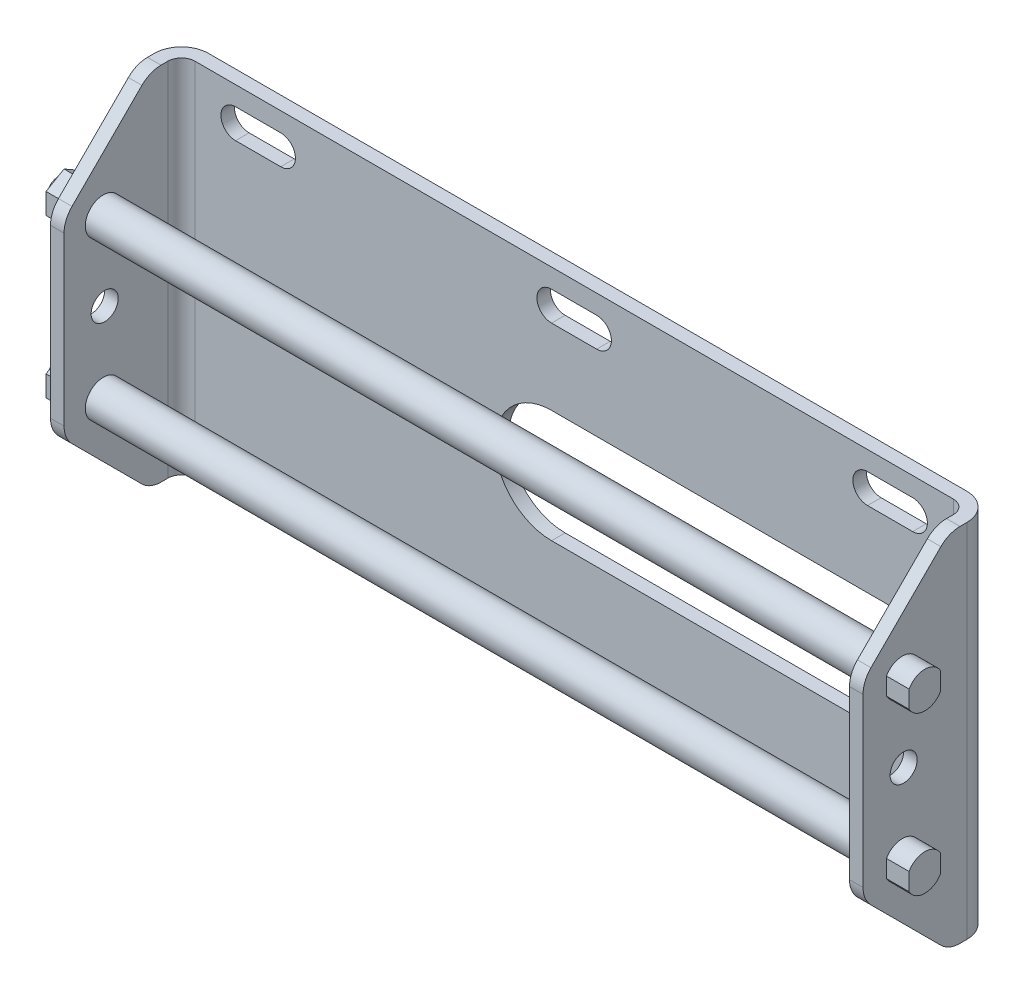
ISO-10303-21;
HEADER;
FILE_DESCRIPTION(('STEP AP214'),'2;1');
FILE_NAME('part.step','',(''),(''),'','','');
FILE_SCHEMA(('AUTOMOTIVE_DESIGN { 1 0 10303 214 1 1 1 1 }'));
ENDSEC;
DATA;
#1=APPLICATION_CONTEXT('core data for automotive mechanical design processes');
#2=APPLICATION_PROTOCOL_DEFINITION('international standard','automotive_design',2000,#1);
#3=PRODUCT_CONTEXT('',#1,'mechanical');
#4=PRODUCT('Part','Part','',(#3));
#5=PRODUCT_RELATED_PRODUCT_CATEGORY('part','',(#4));
#6=PRODUCT_DEFINITION_FORMATION('','',#4);
#7=PRODUCT_DEFINITION_CONTEXT('part definition',#1,'design');
#8=PRODUCT_DEFINITION('design','',#6,#7);
#9=PRODUCT_DEFINITION_SHAPE('','',#8);
#10=(LENGTH_UNIT() NAMED_UNIT(*) SI_UNIT(.MILLI.,.METRE.));
#11=(NAMED_UNIT(*) PLANE_ANGLE_UNIT() SI_UNIT($,.RADIAN.));
#12=(NAMED_UNIT(*) SI_UNIT($,.STERADIAN.) SOLID_ANGLE_UNIT());
#13=UNCERTAINTY_MEASURE_WITH_UNIT(LENGTH_MEASURE(1.E-05),#10,'distance_accuracy_value','');
#14=(GEOMETRIC_REPRESENTATION_CONTEXT(3) GLOBAL_UNCERTAINTY_ASSIGNED_CONTEXT((#13)) GLOBAL_UNIT_ASSIGNED_CONTEXT((#10,
#11,#12)) REPRESENTATION_CONTEXT('',''));
#15=CARTESIAN_POINT('',(0.,0.,0.));
#16=DIRECTION('',(0.,0.,1.));
#17=DIRECTION('',(1.,0.,0.));
#18=AXIS2_PLACEMENT_3D('',#15,#16,#17);
#19=CARTESIAN_POINT('',(40.,45.,3.));
#20=DIRECTION('',(0.,1.,0.));
#21=DIRECTION('',(0.,0.,-1.));
#22=AXIS2_PLACEMENT_3D('',#19,#20,#21);
#23=PLANE('',#22);
#24=DIRECTION('',(0.,0.,-1.));
#25=VECTOR('',#24,1.);
#26=CARTESIAN_POINT('',(70.,45.,3.));
#27=LINE('',#26,#25);
#28=CARTESIAN_POINT('',(70.,45.,3.));
#29=VERTEX_POINT('',#28);
#30=CARTESIAN_POINT('',(70.,45.,0.));
#31=VERTEX_POINT('',#30);
#32=EDGE_CURVE('E543',#29,#31,#27,.T.);
#33=ORIENTED_EDGE('',*,*,#32,.T.);
#34=DIRECTION('',(1.,0.,0.));
#35=VECTOR('',#34,1.);
#36=CARTESIAN_POINT('',(40.,45.,0.));
#37=LINE('',#36,#35);
#38=CARTESIAN_POINT('',(144.,45.,0.));
#39=VERTEX_POINT('',#38);
#40=EDGE_CURVE('E538',#31,#39,#37,.T.);
#41=ORIENTED_EDGE('',*,*,#40,.T.);
#42=DIRECTION('',(0.,0.,-1.));
#43=VECTOR('',#42,1.);
#44=CARTESIAN_POINT('',(144.,45.,3.));
#45=LINE('',#44,#43);
#46=CARTESIAN_POINT('',(144.,45.,3.));
#47=VERTEX_POINT('',#46);
#48=EDGE_CURVE('E540',#47,#39,#45,.T.);
#49=ORIENTED_EDGE('',*,*,#48,.F.);
#50=DIRECTION('',(1.,0.,0.));
#51=VECTOR('',#50,1.);
#52=CARTESIAN_POINT('',(40.,45.,3.));
#53=LINE('',#52,#51);
#54=EDGE_CURVE('E854',#29,#47,#53,.T.);
#55=ORIENTED_EDGE('',*,*,#54,.F.);
#56=EDGE_LOOP('',(#33,#41,#49,#55));
#57=FACE_BOUND('',#56,.T.);
#58=ADVANCED_FACE('F14',(#57),#23,.F.);
#59=CARTESIAN_POINT('',(-20.7,43.0717967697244,24.3));
#60=DIRECTION('',(1.,0.,0.));
#61=DIRECTION('',(0.,0.,-1.));
#62=AXIS2_PLACEMENT_3D('',#59,#60,#61);
#63=PLANE('',#62);
#64=DIRECTION('',(0.,1.,0.));
#65=VECTOR('',#64,1.);
#66=CARTESIAN_POINT('',(-20.7,47.6905989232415,24.3));
#67=LINE('',#66,#65);
#68=CARTESIAN_POINT('',(-20.7,47.6905989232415,24.3));
#69=VERTEX_POINT('',#68);
#70=CARTESIAN_POINT('',(-20.7,52.3094010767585,24.3));
#71=VERTEX_POINT('',#70);
#72=EDGE_CURVE('E900',#69,#71,#67,.T.);
#73=ORIENTED_EDGE('',*,*,#72,.T.);
#74=DIRECTION('',(0.,0.5,-0.866025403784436));
#75=VECTOR('',#74,1.);
#76=CARTESIAN_POINT('',(-20.7,52.3094010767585,24.3));
#77=LINE('',#76,#75);
#78=CARTESIAN_POINT('',(-20.7,54.6188021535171,20.3));
#79=VERTEX_POINT('',#78);
#80=EDGE_CURVE('E904',#71,#79,#77,.T.);
#81=ORIENTED_EDGE('',*,*,#80,.T.);
#82=DIRECTION('',(0.,0.5,0.866025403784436));
#83=VECTOR('',#82,1.);
#84=CARTESIAN_POINT('',(-20.7,52.3094010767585,16.3));
#85=LINE('',#84,#83);
#86=CARTESIAN_POINT('',(-20.7,52.3094010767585,16.3));
#87=VERTEX_POINT('',#86);
#88=EDGE_CURVE('E907',#87,#79,#85,.T.);
#89=ORIENTED_EDGE('',*,*,#88,.F.);
#90=DIRECTION('',(0.,1.,0.));
#91=VECTOR('',#90,1.);
#92=CARTESIAN_POINT('',(-20.7,47.6905989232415,16.3));
#93=LINE('',#92,#91);
#94=CARTESIAN_POINT('',(-20.7,47.6905989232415,16.3));
#95=VERTEX_POINT('',#94);
#96=EDGE_CURVE('E910',#95,#87,#93,.T.);
#97=ORIENTED_EDGE('',*,*,#96,.F.);
#98=DIRECTION('',(0.,-0.5,0.866025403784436));
#99=VECTOR('',#98,1.);
#100=CARTESIAN_POINT('',(-20.7,47.6905989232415,16.3));
#101=LINE('',#100,#99);
#102=CARTESIAN_POINT('',(-20.7,45.381197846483,20.3));
#103=VERTEX_POINT('',#102);
#104=EDGE_CURVE('E913',#95,#103,#101,.T.);
#105=ORIENTED_EDGE('',*,*,#104,.T.);
#106=DIRECTION('',(0.,-0.5,-0.866025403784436));
#107=VECTOR('',#106,1.);
#108=CARTESIAN_POINT('',(-20.7,47.6905989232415,24.3));
#109=LINE('',#108,#107);
#110=EDGE_CURVE('E916',#69,#103,#109,.T.);
#111=ORIENTED_EDGE('',*,*,#110,.F.);
#112=EDGE_LOOP('',(#73,#81,#89,#97,#105,#111));
#113=FACE_BOUND('',#112,.T.);
#114=CARTESIAN_POINT('',(-20.7,50.,20.3));
#115=DIRECTION('',(-1.,0.,0.));
#116=DIRECTION('',(0.,0.,1.));
#117=AXIS2_PLACEMENT_3D('',#114,#115,#116);
#118=CIRCLE('',#117,2.5);
#119=CARTESIAN_POINT('',(-20.7,50.,22.8));
#120=VERTEX_POINT('',#119);
#121=EDGE_CURVE('E9',#120,#120,#118,.T.);
#122=ORIENTED_EDGE('',*,*,#121,.F.);
#123=EDGE_LOOP('',(#122));
#124=FACE_BOUND('',#123,.T.);
#125=ADVANCED_FACE('F1210',(#113,#124),#63,.F.);
#126=CARTESIAN_POINT('',(-16.7,50.,20.3));
#127=DIRECTION('',(-1.,0.,0.));
#128=DIRECTION('',(0.,0.,1.));
#129=AXIS2_PLACEMENT_3D('',#126,#127,#128);
#130=PLANE('',#129);
#131=CARTESIAN_POINT('',(-16.7,50.,20.3));
#132=DIRECTION('',(-1.,0.,0.));
#133=DIRECTION('',(0.,0.,1.));
#134=AXIS2_PLACEMENT_3D('',#131,#132,#133);
#135=CIRCLE('',#134,4.6);
#136=CARTESIAN_POINT('',(-16.7,45.4001167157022,20.3327684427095));
#137=VERTEX_POINT('',#136);
#138=CARTESIAN_POINT('',(-16.7,47.6716800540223,24.2672315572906));
#139=VERTEX_POINT('',#138);
#140=EDGE_CURVE('E2228',#137,#139,#135,.T.);
#141=ORIENTED_EDGE('',*,*,#140,.T.);
#142=DIRECTION('',(0.,-0.5,-0.866025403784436));
#143=VECTOR('',#142,1.);
#144=CARTESIAN_POINT('',(-16.7,47.6905989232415,24.3));
#145=LINE('',#144,#143);
#146=EDGE_CURVE('E901',#139,#137,#145,.T.);
#147=ORIENTED_EDGE('',*,*,#146,.T.);
#148=EDGE_LOOP('',(#141,#147));
#149=FACE_BOUND('',#148,.T.);
#150=ADVANCED_FACE('F1215',(#149),#130,.T.);
#151=DIRECTION('',(0.,1.,0.));
#152=VECTOR('',#151,1.);
#153=CARTESIAN_POINT('',(-16.7,47.6905989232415,24.3));
#154=LINE('',#153,#152);
#155=CARTESIAN_POINT('',(-16.7,47.7284366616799,24.3));
#156=VERTEX_POINT('',#155);
#157=CARTESIAN_POINT('',(-16.7,52.2715633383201,24.3));
#158=VERTEX_POINT('',#157);
#159=EDGE_CURVE('E869',#156,#158,#154,.T.);
#160=ORIENTED_EDGE('',*,*,#159,.F.);
#161=EDGE_CURVE('E1002',#156,#158,#135,.T.);
#162=ORIENTED_EDGE('',*,*,#161,.T.);
#163=EDGE_LOOP('',(#160,#162));
#164=FACE_BOUND('',#163,.T.);
#165=ADVANCED_FACE('F2068',(#164),#130,.T.);
#166=CARTESIAN_POINT('',(-16.7,52.2715633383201,16.3));
#167=VERTEX_POINT('',#166);
#168=CARTESIAN_POINT('',(-16.7,47.7284366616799,16.3));
#169=VERTEX_POINT('',#168);
#170=EDGE_CURVE('E2254',#167,#169,#135,.T.);
#171=ORIENTED_EDGE('',*,*,#170,.T.);
#172=DIRECTION('',(0.,1.,0.));
#173=VECTOR('',#172,1.);
#174=CARTESIAN_POINT('',(-16.7,47.6905989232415,16.3));
#175=LINE('',#174,#173);
#176=EDGE_CURVE('E891',#169,#167,#175,.T.);
#177=ORIENTED_EDGE('',*,*,#176,.T.);
#178=EDGE_LOOP('',(#171,#177));
#179=FACE_BOUND('',#178,.T.);
#180=ADVANCED_FACE('F2061',(#179),#130,.T.);
#181=CARTESIAN_POINT('',(-16.7,54.5998832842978,20.2672315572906));
#182=VERTEX_POINT('',#181);
#183=CARTESIAN_POINT('',(-16.7,52.3283199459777,16.3327684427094));
#184=VERTEX_POINT('',#183);
#185=EDGE_CURVE('E2261',#182,#184,#135,.T.);
#186=ORIENTED_EDGE('',*,*,#185,.T.);
#187=DIRECTION('',(0.,0.5,0.866025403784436));
#188=VECTOR('',#187,1.);
#189=CARTESIAN_POINT('',(-16.7,52.3094010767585,16.3));
#190=LINE('',#189,#188);
#191=EDGE_CURVE('E886',#184,#182,#190,.T.);
#192=ORIENTED_EDGE('',*,*,#191,.T.);
#193=EDGE_LOOP('',(#186,#192));
#194=FACE_BOUND('',#193,.T.);
#195=ADVANCED_FACE('F2054',(#194),#130,.T.);
#196=DIRECTION('',(0.,-0.5,0.866025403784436));
#197=VECTOR('',#196,1.);
#198=CARTESIAN_POINT('',(-16.7,47.6905989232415,16.3));
#199=LINE('',#198,#197);
#200=CARTESIAN_POINT('',(-16.7,47.6716800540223,16.3327684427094));
#201=VERTEX_POINT('',#200);
#202=CARTESIAN_POINT('',(-16.7,45.4001167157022,20.2672315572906));
#203=VERTEX_POINT('',#202);
#204=EDGE_CURVE('E896',#201,#203,#199,.T.);
#205=ORIENTED_EDGE('',*,*,#204,.F.);
#206=EDGE_CURVE('E2251',#201,#203,#135,.T.);
#207=ORIENTED_EDGE('',*,*,#206,.T.);
#208=EDGE_LOOP('',(#205,#207));
#209=FACE_BOUND('',#208,.T.);
#210=ADVANCED_FACE('F1797',(#209),#130,.T.);
#211=CARTESIAN_POINT('',(-16.7,15.,20.3));
#212=DIRECTION('',(-1.,0.,0.));
#213=DIRECTION('',(0.,0.,1.));
#214=AXIS2_PLACEMENT_3D('',#211,#212,#213);
#215=PLANE('',#214);
#216=CARTESIAN_POINT('',(-16.7,15.,20.3));
#217=DIRECTION('',(-1.,0.,0.));
#218=DIRECTION('',(0.,0.,1.));
#219=AXIS2_PLACEMENT_3D('',#216,#217,#218);
#220=CIRCLE('',#219,4.6);
#221=CARTESIAN_POINT('',(-16.7,19.5998832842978,20.2672315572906));
#222=VERTEX_POINT('',#221);
#223=CARTESIAN_POINT('',(-16.7,17.3283199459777,16.3327684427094));
#224=VERTEX_POINT('',#223);
#225=EDGE_CURVE('E2327',#222,#224,#220,.T.);
#226=ORIENTED_EDGE('',*,*,#225,.T.);
#227=DIRECTION('',(0.,0.5,0.866025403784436));
#228=VECTOR('',#227,1.);
#229=CARTESIAN_POINT('',(-16.7,17.3094010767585,16.3));
#230=LINE('',#229,#228);
#231=EDGE_CURVE('E965',#224,#222,#230,.T.);
#232=ORIENTED_EDGE('',*,*,#231,.T.);
#233=EDGE_LOOP('',(#226,#232));
#234=FACE_BOUND('',#233,.T.);
#235=ADVANCED_FACE('F1814',(#234),#215,.T.);
#236=DIRECTION('',(0.,-1.,0.));
#237=VECTOR('',#236,1.);
#238=CARTESIAN_POINT('',(-16.7,17.3094010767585,16.3));
#239=LINE('',#238,#237);
#240=CARTESIAN_POINT('',(-16.7,17.2715633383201,16.3));
#241=VERTEX_POINT('',#240);
#242=CARTESIAN_POINT('',(-16.7,12.7284366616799,16.3));
#243=VERTEX_POINT('',#242);
#244=EDGE_CURVE('E940',#241,#243,#239,.T.);
#245=ORIENTED_EDGE('',*,*,#244,.F.);
#246=EDGE_CURVE('E2288',#241,#243,#220,.T.);
#247=ORIENTED_EDGE('',*,*,#246,.T.);
#248=EDGE_LOOP('',(#245,#247));
#249=FACE_BOUND('',#248,.T.);
#250=ADVANCED_FACE('F2035',(#249),#215,.T.);
#251=CARTESIAN_POINT('',(-16.7,12.7284366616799,24.3));
#252=VERTEX_POINT('',#251);
#253=CARTESIAN_POINT('',(-16.7,17.2715633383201,24.3));
#254=VERTEX_POINT('',#253);
#255=EDGE_CURVE('E1006',#252,#254,#220,.T.);
#256=ORIENTED_EDGE('',*,*,#255,.T.);
#257=DIRECTION('',(0.,-1.,0.));
#258=VECTOR('',#257,1.);
#259=CARTESIAN_POINT('',(-16.7,17.3094010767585,24.3));
#260=LINE('',#259,#258);
#261=EDGE_CURVE('E955',#254,#252,#260,.T.);
#262=ORIENTED_EDGE('',*,*,#261,.T.);
#263=EDGE_LOOP('',(#256,#262));
#264=FACE_BOUND('',#263,.T.);
#265=ADVANCED_FACE('F2028',(#264),#215,.T.);
#266=CARTESIAN_POINT('',(-16.7,10.4001167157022,20.3327684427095));
#267=VERTEX_POINT('',#266);
#268=CARTESIAN_POINT('',(-16.7,12.6716800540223,24.2672315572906));
#269=VERTEX_POINT('',#268);
#270=EDGE_CURVE('E2294',#267,#269,#220,.T.);
#271=ORIENTED_EDGE('',*,*,#270,.T.);
#272=DIRECTION('',(0.,-0.5,-0.866025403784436));
#273=VECTOR('',#272,1.);
#274=CARTESIAN_POINT('',(-16.7,12.6905989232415,24.3));
#275=LINE('',#274,#273);
#276=EDGE_CURVE('E950',#269,#267,#275,.T.);
#277=ORIENTED_EDGE('',*,*,#276,.T.);
#278=EDGE_LOOP('',(#271,#277));
#279=FACE_BOUND('',#278,.T.);
#280=ADVANCED_FACE('F2021',(#279),#215,.T.);
#281=DIRECTION('',(0.,0.5,-0.866025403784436));
#282=VECTOR('',#281,1.);
#283=CARTESIAN_POINT('',(-16.7,17.3094010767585,24.3));
#284=LINE('',#283,#282);
#285=CARTESIAN_POINT('',(-16.7,17.3283199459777,24.2672315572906));
#286=VERTEX_POINT('',#285);
#287=CARTESIAN_POINT('',(-16.7,19.5998832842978,20.3327684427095));
#288=VERTEX_POINT('',#287);
#289=EDGE_CURVE('E960',#286,#288,#284,.T.);
#290=ORIENTED_EDGE('',*,*,#289,.F.);
#291=EDGE_CURVE('E1016',#286,#288,#220,.T.);
#292=ORIENTED_EDGE('',*,*,#291,.T.);
#293=EDGE_LOOP('',(#290,#292));
#294=FACE_BOUND('',#293,.T.);
#295=ADVANCED_FACE('F1815',(#294),#215,.T.);
#296=CARTESIAN_POINT('',(-15.,-1.5,7.51471862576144));
#297=DIRECTION('',(-1.,0.,0.));
#298=DIRECTION('',(0.,0.,1.));
#299=AXIS2_PLACEMENT_3D('',#296,#297,#298);
#300=PLANE('',#299);
#301=CARTESIAN_POINT('',(-15.,32.5,20.));
#302=DIRECTION('',(-1.,0.,0.));
#303=DIRECTION('',(0.,0.,1.));
#304=AXIS2_PLACEMENT_3D('',#301,#302,#303);
#305=CIRCLE('',#304,3.);
#306=CARTESIAN_POINT('',(-15.,32.5,23.));
#307=VERTEX_POINT('',#306);
#308=EDGE_CURVE('E859',#307,#307,#305,.T.);
#309=ORIENTED_EDGE('',*,*,#308,.F.);
#310=EDGE_LOOP('',(#309));
#311=FACE_BOUND('',#310,.T.);
#312=DIRECTION('',(0.,0.,1.));
#313=VECTOR('',#312,1.);
#314=CARTESIAN_POINT('',(-15.,72.5,0.));
#315=LINE('',#314,#313);
#316=CARTESIAN_POINT('',(-15.,72.5,6.));
#317=VERTEX_POINT('',#316);
#318=CARTESIAN_POINT('',(-15.,72.5,7.51471862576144));
#319=VERTEX_POINT('',#318);
#320=EDGE_CURVE('E1108',#317,#319,#315,.T.);
#321=ORIENTED_EDGE('',*,*,#320,.F.);
#322=DIRECTION('',(0.,1.,0.));
#323=VECTOR('',#322,1.);
#324=CARTESIAN_POINT('',(-15.,-1.5,6.));
#325=LINE('',#324,#323);
#326=CARTESIAN_POINT('',(-15.,-7.5,6.));
#327=VERTEX_POINT('',#326);
#328=EDGE_CURVE('E1147',#317,#327,#325,.F.);
#329=ORIENTED_EDGE('',*,*,#328,.T.);
#330=DIRECTION('',(0.,0.,1.));
#331=VECTOR('',#330,1.);
#332=CARTESIAN_POINT('',(-15.,-7.5,0.));
#333=LINE('',#332,#331);
#334=CARTESIAN_POINT('',(-15.,-7.5,7.51471862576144));
#335=VERTEX_POINT('',#334);
#336=EDGE_CURVE('E1085',#327,#335,#333,.T.);
#337=ORIENTED_EDGE('',*,*,#336,.T.);
#338=CARTESIAN_POINT('',(-15.,-1.5,7.51471862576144));
#339=DIRECTION('',(-1.,0.,0.));
#340=DIRECTION('',(0.,0.,1.));
#341=AXIS2_PLACEMENT_3D('',#338,#339,#340);
#342=CIRCLE('',#341,6.);
#343=CARTESIAN_POINT('',(-15.,-5.7426406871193,11.7573593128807));
#344=VERTEX_POINT('',#343);
#345=EDGE_CURVE('E1087',#335,#344,#342,.T.);
#346=ORIENTED_EDGE('',*,*,#345,.T.);
#347=DIRECTION('',(0.,0.707106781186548,0.707106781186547));
#348=VECTOR('',#347,1.);
#349=CARTESIAN_POINT('',(-15.,-5.7426406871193,11.7573593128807));
#350=LINE('',#349,#348);
#351=CARTESIAN_POINT('',(-15.,9.7426406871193,27.2426406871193));
#352=VERTEX_POINT('',#351);
#353=EDGE_CURVE('E1090',#344,#352,#350,.T.);
#354=ORIENTED_EDGE('',*,*,#353,.T.);
#355=CARTESIAN_POINT('',(-15.,13.9852813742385,23.));
#356=DIRECTION('',(-1.,0.,0.));
#357=DIRECTION('',(0.,0.,1.));
#358=AXIS2_PLACEMENT_3D('',#355,#356,#357);
#359=CIRCLE('',#358,6.);
#360=CARTESIAN_POINT('',(-15.,13.9852813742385,29.));
#361=VERTEX_POINT('',#360);
#362=EDGE_CURVE('E1093',#352,#361,#359,.T.);
#363=ORIENTED_EDGE('',*,*,#362,.T.);
#364=DIRECTION('',(0.,1.,0.));
#365=VECTOR('',#364,1.);
#366=CARTESIAN_POINT('',(-15.,13.9852813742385,29.));
#367=LINE('',#366,#365);
#368=CARTESIAN_POINT('',(-15.,51.0147186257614,29.));
#369=VERTEX_POINT('',#368);
#370=EDGE_CURVE('E1096',#361,#369,#367,.T.);
#371=ORIENTED_EDGE('',*,*,#370,.T.);
#372=CARTESIAN_POINT('',(-15.,51.0147186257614,23.));
#373=DIRECTION('',(1.,0.,0.));
#374=DIRECTION('',(0.,0.,-1.));
#375=AXIS2_PLACEMENT_3D('',#372,#373,#374);
#376=CIRCLE('',#375,6.);
#377=CARTESIAN_POINT('',(-15.,55.2573593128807,27.2426406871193));
#378=VERTEX_POINT('',#377);
#379=EDGE_CURVE('E1099',#378,#369,#376,.T.);
#380=ORIENTED_EDGE('',*,*,#379,.F.);
#381=DIRECTION('',(0.,-0.707106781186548,0.707106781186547));
#382=VECTOR('',#381,1.);
#383=CARTESIAN_POINT('',(-15.,70.7426406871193,11.7573593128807));
#384=LINE('',#383,#382);
#385=CARTESIAN_POINT('',(-15.,70.7426406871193,11.7573593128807));
#386=VERTEX_POINT('',#385);
#387=EDGE_CURVE('E1102',#386,#378,#384,.T.);
#388=ORIENTED_EDGE('',*,*,#387,.F.);
#389=CARTESIAN_POINT('',(-15.,66.5,7.51471862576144));
#390=DIRECTION('',(1.,0.,0.));
#391=DIRECTION('',(0.,0.,-1.));
#392=AXIS2_PLACEMENT_3D('',#389,#390,#391);
#393=CIRCLE('',#392,6.);
#394=EDGE_CURVE('E1105',#319,#386,#393,.T.);
#395=ORIENTED_EDGE('',*,*,#394,.F.);
#396=EDGE_LOOP('',(#321,#329,#337,#346,#354,#363,#371,#380,#388,#395));
#397=FACE_BOUND('',#396,.T.);
#398=CARTESIAN_POINT('',(-15.,15.,20.3));
#399=DIRECTION('',(-1.,0.,0.));
#400=DIRECTION('',(0.,0.,1.));
#401=AXIS2_PLACEMENT_3D('',#398,#399,#400);
#402=CIRCLE('',#401,4.6);
#403=CARTESIAN_POINT('',(-15.,15.,24.9));
#404=VERTEX_POINT('',#403);
#405=EDGE_CURVE('E1008',#404,#404,#402,.T.);
#406=ORIENTED_EDGE('',*,*,#405,.F.);
#407=EDGE_LOOP('',(#406));
#408=FACE_BOUND('',#407,.T.);
#409=CARTESIAN_POINT('',(-15.,50.,20.3));
#410=DIRECTION('',(-1.,0.,0.));
#411=DIRECTION('',(0.,0.,1.));
#412=AXIS2_PLACEMENT_3D('',#409,#410,#411);
#413=CIRCLE('',#412,4.6);
#414=CARTESIAN_POINT('',(-15.,50.,24.9));
#415=VERTEX_POINT('',#414);
#416=EDGE_CURVE('E999',#415,#415,#413,.T.);
#417=ORIENTED_EDGE('',*,*,#416,.F.);
#418=EDGE_LOOP('',(#417));
#419=FACE_BOUND('',#418,.T.);
#420=ADVANCED_FACE('F2007',(#311,#397,#408,#419),#300,.T.);
#421=CARTESIAN_POINT('',(-12.,-27.5,3.));
#422=DIRECTION('',(-1.,0.,0.));
#423=DIRECTION('',(0.,0.,1.));
#424=AXIS2_PLACEMENT_3D('',#421,#422,#423);
#425=PLANE('',#424);
#426=CARTESIAN_POINT('',(-12.,32.5,20.));
#427=DIRECTION('',(-1.,0.,0.));
#428=DIRECTION('',(0.,0.,1.));
#429=AXIS2_PLACEMENT_3D('',#426,#427,#428);
#430=CIRCLE('',#429,3.);
#431=CARTESIAN_POINT('',(-12.,32.5,23.));
#432=VERTEX_POINT('',#431);
#433=EDGE_CURVE('E861',#432,#432,#430,.T.);
#434=ORIENTED_EDGE('',*,*,#433,.T.);
#435=EDGE_LOOP('',(#434));
#436=FACE_BOUND('',#435,.T.);
#437=DIRECTION('',(0.,0.,1.));
#438=VECTOR('',#437,1.);
#439=CARTESIAN_POINT('',(-12.,-7.5,0.));
#440=LINE('',#439,#438);
#441=CARTESIAN_POINT('',(-12.,-7.5,6.));
#442=VERTEX_POINT('',#441);
#443=CARTESIAN_POINT('',(-12.,-7.5,7.51471862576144));
#444=VERTEX_POINT('',#443);
#445=EDGE_CURVE('E1083',#442,#444,#440,.T.);
#446=ORIENTED_EDGE('',*,*,#445,.F.);
#447=DIRECTION('',(0.,1.,0.));
#448=VECTOR('',#447,1.);
#449=CARTESIAN_POINT('',(-12.,-27.5,6.));
#450=LINE('',#449,#448);
#451=CARTESIAN_POINT('',(-12.,72.5,6.));
#452=VERTEX_POINT('',#451);
#453=EDGE_CURVE('E1153',#442,#452,#450,.T.);
#454=ORIENTED_EDGE('',*,*,#453,.T.);
#455=DIRECTION('',(0.,0.,1.));
#456=VECTOR('',#455,1.);
#457=CARTESIAN_POINT('',(-12.,72.5,0.));
#458=LINE('',#457,#456);
#459=CARTESIAN_POINT('',(-12.,72.5,7.51471862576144));
#460=VERTEX_POINT('',#459);
#461=EDGE_CURVE('E1140',#452,#460,#458,.T.);
#462=ORIENTED_EDGE('',*,*,#461,.T.);
#463=CARTESIAN_POINT('',(-12.,66.5,7.51471862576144));
#464=DIRECTION('',(-1.,0.,0.));
#465=DIRECTION('',(0.,0.,1.));
#466=AXIS2_PLACEMENT_3D('',#463,#464,#465);
#467=CIRCLE('',#466,6.);
#468=CARTESIAN_POINT('',(-12.,70.7426406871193,11.7573593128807));
#469=VERTEX_POINT('',#468);
#470=EDGE_CURVE('E1065',#460,#469,#467,.F.);
#471=ORIENTED_EDGE('',*,*,#470,.T.);
#472=DIRECTION('',(0.,-0.707106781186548,0.707106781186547));
#473=VECTOR('',#472,1.);
#474=CARTESIAN_POINT('',(-12.,70.7426406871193,11.7573593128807));
#475=LINE('',#474,#473);
#476=CARTESIAN_POINT('',(-12.,55.2573593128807,27.2426406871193));
#477=VERTEX_POINT('',#476);
#478=EDGE_CURVE('E1067',#469,#477,#475,.T.);
#479=ORIENTED_EDGE('',*,*,#478,.T.);
#480=CARTESIAN_POINT('',(-12.,51.0147186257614,23.));
#481=DIRECTION('',(-1.,0.,0.));
#482=DIRECTION('',(0.,0.,1.));
#483=AXIS2_PLACEMENT_3D('',#480,#481,#482);
#484=CIRCLE('',#483,6.);
#485=CARTESIAN_POINT('',(-12.,51.0147186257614,29.));
#486=VERTEX_POINT('',#485);
#487=EDGE_CURVE('E1069',#477,#486,#484,.F.);
#488=ORIENTED_EDGE('',*,*,#487,.T.);
#489=DIRECTION('',(0.,1.,0.));
#490=VECTOR('',#489,1.);
#491=CARTESIAN_POINT('',(-12.,13.9852813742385,29.));
#492=LINE('',#491,#490);
#493=CARTESIAN_POINT('',(-12.,13.9852813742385,29.));
#494=VERTEX_POINT('',#493);
#495=EDGE_CURVE('E1071',#494,#486,#492,.T.);
#496=ORIENTED_EDGE('',*,*,#495,.F.);
#497=CARTESIAN_POINT('',(-12.,13.9852813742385,23.));
#498=DIRECTION('',(-1.,0.,0.));
#499=DIRECTION('',(0.,0.,1.));
#500=AXIS2_PLACEMENT_3D('',#497,#498,#499);
#501=CIRCLE('',#500,6.);
#502=CARTESIAN_POINT('',(-12.,9.7426406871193,27.2426406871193));
#503=VERTEX_POINT('',#502);
#504=EDGE_CURVE('E1074',#503,#494,#501,.T.);
#505=ORIENTED_EDGE('',*,*,#504,.F.);
#506=DIRECTION('',(0.,0.707106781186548,0.707106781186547));
#507=VECTOR('',#506,1.);
#508=CARTESIAN_POINT('',(-12.,-5.7426406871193,11.7573593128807));
#509=LINE('',#508,#507);
#510=CARTESIAN_POINT('',(-12.,-5.7426406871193,11.7573593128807));
#511=VERTEX_POINT('',#510);
#512=EDGE_CURVE('E1077',#511,#503,#509,.T.);
#513=ORIENTED_EDGE('',*,*,#512,.F.);
#514=CARTESIAN_POINT('',(-12.,-1.5,7.51471862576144));
#515=DIRECTION('',(-1.,0.,0.));
#516=DIRECTION('',(0.,0.,1.));
#517=AXIS2_PLACEMENT_3D('',#514,#515,#516);
#518=CIRCLE('',#517,6.);
#519=EDGE_CURVE('E1080',#444,#511,#518,.T.);
#520=ORIENTED_EDGE('',*,*,#519,.F.);
#521=EDGE_LOOP('',(#446,#454,#462,#471,#479,#488,#496,#505,#513,#520));
#522=FACE_BOUND('',#521,.T.);
#523=CARTESIAN_POINT('',(-12.,50.,20.3));
#524=DIRECTION('',(-1.,0.,0.));
#525=DIRECTION('',(0.,0.,1.));
#526=AXIS2_PLACEMENT_3D('',#523,#524,#525);
#527=CIRCLE('',#526,4.);
#528=CARTESIAN_POINT('',(-12.,50.,24.3));
#529=VERTEX_POINT('',#528);
#530=EDGE_CURVE('E1015',#529,#529,#527,.T.);
#531=ORIENTED_EDGE('',*,*,#530,.T.);
#532=EDGE_LOOP('',(#531));
#533=FACE_BOUND('',#532,.T.);
#534=CARTESIAN_POINT('',(-12.,15.,20.3));
#535=DIRECTION('',(-1.,0.,0.));
#536=DIRECTION('',(0.,0.,1.));
#537=AXIS2_PLACEMENT_3D('',#534,#535,#536);
#538=CIRCLE('',#537,4.);
#539=CARTESIAN_POINT('',(-12.,15.,24.3));
#540=VERTEX_POINT('',#539);
#541=EDGE_CURVE('E1011',#540,#540,#538,.F.);
#542=ORIENTED_EDGE('',*,*,#541,.F.);
#543=EDGE_LOOP('',(#542));
#544=FACE_BOUND('',#543,.T.);
#545=ADVANCED_FACE('F1182',(#436,#522,#533,#544),#425,.F.);
#546=CARTESIAN_POINT('',(-15.,-7.5,0.));
#547=DIRECTION('',(0.,0.,-1.));
#548=DIRECTION('',(0.,-1.,0.));
#549=AXIS2_PLACEMENT_3D('',#546,#547,#548);
#550=PLANE('',#549);
#551=DIRECTION('',(-1.,0.,0.));
#552=VECTOR('',#551,1.);
#553=CARTESIAN_POINT('',(114.,20.,0.));
#554=LINE('',#553,#552);
#555=CARTESIAN_POINT('',(144.,20.,0.));
#556=VERTEX_POINT('',#555);
#557=CARTESIAN_POINT('',(70.,20.,0.));
#558=VERTEX_POINT('',#557);
#559=EDGE_CURVE('E548',#556,#558,#554,.T.);
#560=ORIENTED_EDGE('',*,*,#559,.F.);
#561=CARTESIAN_POINT('',(144.,32.5,0.));
#562=DIRECTION('',(0.,0.,-1.));
#563=DIRECTION('',(0.,-1.,0.));
#564=AXIS2_PLACEMENT_3D('',#561,#562,#563);
#565=CIRCLE('',#564,12.5);
#566=EDGE_CURVE('E554',#39,#556,#565,.T.);
#567=ORIENTED_EDGE('',*,*,#566,.F.);
#568=ORIENTED_EDGE('',*,*,#40,.F.);
#569=CARTESIAN_POINT('',(70.,32.5,0.));
#570=DIRECTION('',(0.,0.,1.));
#571=DIRECTION('',(0.,1.,0.));
#572=AXIS2_PLACEMENT_3D('',#569,#570,#571);
#573=CIRCLE('',#572,12.5);
#574=EDGE_CURVE('E844',#31,#558,#573,.T.);
#575=ORIENTED_EDGE('',*,*,#574,.T.);
#576=EDGE_LOOP('',(#560,#567,#568,#575));
#577=FACE_BOUND('',#576,.T.);
#578=CARTESIAN_POINT('',(80.,65.,0.));
#579=DIRECTION('',(0.,0.,-1.));
#580=DIRECTION('',(0.,-1.,0.));
#581=AXIS2_PLACEMENT_3D('',#578,#579,#580);
#582=CIRCLE('',#581,3.25);
#583=CARTESIAN_POINT('',(80.,68.25,0.));
#584=VERTEX_POINT('',#583);
#585=CARTESIAN_POINT('',(80.,61.75,0.));
#586=VERTEX_POINT('',#585);
#587=EDGE_CURVE('E31',#584,#586,#582,.T.);
#588=ORIENTED_EDGE('',*,*,#587,.F.);
#589=DIRECTION('',(1.,0.,0.));
#590=VECTOR('',#589,1.);
#591=CARTESIAN_POINT('',(80.,68.25,0.));
#592=LINE('',#591,#590);
#593=CARTESIAN_POINT('',(70.,68.25,0.));
#594=VERTEX_POINT('',#593);
#595=EDGE_CURVE('E799',#594,#584,#592,.T.);
#596=ORIENTED_EDGE('',*,*,#595,.F.);
#597=CARTESIAN_POINT('',(70.,65.,0.));
#598=DIRECTION('',(0.,0.,-1.));
#599=DIRECTION('',(0.,-1.,0.));
#600=AXIS2_PLACEMENT_3D('',#597,#598,#599);
#601=CIRCLE('',#600,3.25);
#602=CARTESIAN_POINT('',(70.,61.75,0.));
#603=VERTEX_POINT('',#602);
#604=EDGE_CURVE('E796',#603,#594,#601,.T.);
#605=ORIENTED_EDGE('',*,*,#604,.F.);
#606=DIRECTION('',(-1.,0.,0.));
#607=VECTOR('',#606,1.);
#608=CARTESIAN_POINT('',(80.,61.75,0.));
#609=LINE('',#608,#607);
#610=EDGE_CURVE('E794',#586,#603,#609,.T.);
#611=ORIENTED_EDGE('',*,*,#610,.F.);
#612=EDGE_LOOP('',(#588,#596,#605,#611));
#613=FACE_BOUND('',#612,.T.);
#614=CARTESIAN_POINT('',(80.,0.,0.));
#615=DIRECTION('',(0.,0.,-1.));
#616=DIRECTION('',(0.,-1.,0.));
#617=AXIS2_PLACEMENT_3D('',#614,#615,#616);
#618=CIRCLE('',#617,3.25);
#619=CARTESIAN_POINT('',(80.,3.25,0.));
#620=VERTEX_POINT('',#619);
#621=CARTESIAN_POINT('',(80.,-3.25,0.));
#622=VERTEX_POINT('',#621);
#623=EDGE_CURVE('E821',#620,#622,#618,.T.);
#624=ORIENTED_EDGE('',*,*,#623,.F.);
#625=DIRECTION('',(1.,0.,0.));
#626=VECTOR('',#625,1.);
#627=CARTESIAN_POINT('',(80.,3.25,0.));
#628=LINE('',#627,#626);
#629=CARTESIAN_POINT('',(70.,3.25,0.));
#630=VERTEX_POINT('',#629);
#631=EDGE_CURVE('E829',#630,#620,#628,.T.);
#632=ORIENTED_EDGE('',*,*,#631,.F.);
#633=CARTESIAN_POINT('',(70.,0.,0.));
#634=DIRECTION('',(0.,0.,-1.));
#635=DIRECTION('',(0.,-1.,0.));
#636=AXIS2_PLACEMENT_3D('',#633,#634,#635);
#637=CIRCLE('',#636,3.25);
#638=CARTESIAN_POINT('',(70.,-3.25,0.));
#639=VERTEX_POINT('',#638);
#640=EDGE_CURVE('E826',#639,#630,#637,.T.);
#641=ORIENTED_EDGE('',*,*,#640,.F.);
#642=DIRECTION('',(-1.,0.,0.));
#643=VECTOR('',#642,1.);
#644=CARTESIAN_POINT('',(80.,-3.25,0.));
#645=LINE('',#644,#643);
#646=EDGE_CURVE('E823',#622,#639,#645,.T.);
#647=ORIENTED_EDGE('',*,*,#646,.F.);
#648=EDGE_LOOP('',(#624,#632,#641,#647));
#649=FACE_BOUND('',#648,.T.);
#650=DIRECTION('',(0.,1.,0.));
#651=VECTOR('',#650,1.);
#652=CARTESIAN_POINT('',(159.,-1.5,0.));
#653=LINE('',#652,#651);
#654=CARTESIAN_POINT('',(159.,72.5,0.));
#655=VERTEX_POINT('',#654);
#656=CARTESIAN_POINT('',(159.,-7.5,0.));
#657=VERTEX_POINT('',#656);
#658=EDGE_CURVE('E737',#655,#657,#653,.F.);
#659=ORIENTED_EDGE('',*,*,#658,.T.);
#660=DIRECTION('',(1.,0.,0.));
#661=VECTOR('',#660,1.);
#662=CARTESIAN_POINT('',(-15.,-7.5,0.));
#663=LINE('',#662,#661);
#664=CARTESIAN_POINT('',(-9.,-7.5,0.));
#665=VERTEX_POINT('',#664);
#666=EDGE_CURVE('E1110',#665,#657,#663,.T.);
#667=ORIENTED_EDGE('',*,*,#666,.F.);
#668=DIRECTION('',(0.,1.,0.));
#669=VECTOR('',#668,1.);
#670=CARTESIAN_POINT('',(-9.,-7.5,0.));
#671=LINE('',#670,#669);
#672=CARTESIAN_POINT('',(-9.,72.5,0.));
#673=VERTEX_POINT('',#672);
#674=EDGE_CURVE('E1142',#665,#673,#671,.T.);
#675=ORIENTED_EDGE('',*,*,#674,.T.);
#676=DIRECTION('',(1.,0.,0.));
#677=VECTOR('',#676,1.);
#678=CARTESIAN_POINT('',(-15.,72.5,0.));
#679=LINE('',#678,#677);
#680=EDGE_CURVE('E1112',#673,#655,#679,.T.);
#681=ORIENTED_EDGE('',*,*,#680,.T.);
#682=EDGE_LOOP('',(#659,#667,#675,#681));
#683=FACE_BOUND('',#682,.T.);
#684=CARTESIAN_POINT('',(0.,65.,0.));
#685=DIRECTION('',(0.,0.,-1.));
#686=DIRECTION('',(0.,-1.,0.));
#687=AXIS2_PLACEMENT_3D('',#684,#685,#686);
#688=CIRCLE('',#687,3.25);
#689=CARTESIAN_POINT('',(0.,61.75,0.));
#690=VERTEX_POINT('',#689);
#691=CARTESIAN_POINT('',(0.,68.25,0.));
#692=VERTEX_POINT('',#691);
#693=EDGE_CURVE('E1043',#690,#692,#688,.T.);
#694=ORIENTED_EDGE('',*,*,#693,.F.);
#695=DIRECTION('',(-1.,0.,0.));
#696=VECTOR('',#695,1.);
#697=CARTESIAN_POINT('',(10.,61.75,0.));
#698=LINE('',#697,#696);
#699=CARTESIAN_POINT('',(10.,61.75,0.));
#700=VERTEX_POINT('',#699);
#701=EDGE_CURVE('E1051',#700,#690,#698,.T.);
#702=ORIENTED_EDGE('',*,*,#701,.F.);
#703=CARTESIAN_POINT('',(10.,65.,0.));
#704=DIRECTION('',(0.,0.,-1.));
#705=DIRECTION('',(0.,-1.,0.));
#706=AXIS2_PLACEMENT_3D('',#703,#704,#705);
#707=CIRCLE('',#706,3.25);
#708=CARTESIAN_POINT('',(10.,68.25,0.));
#709=VERTEX_POINT('',#708);
#710=EDGE_CURVE('E1048',#709,#700,#707,.T.);
#711=ORIENTED_EDGE('',*,*,#710,.F.);
#712=DIRECTION('',(-1.,0.,0.));
#713=VECTOR('',#712,1.);
#714=CARTESIAN_POINT('',(10.,68.25,0.));
#715=LINE('',#714,#713);
#716=EDGE_CURVE('E1045',#709,#692,#715,.T.);
#717=ORIENTED_EDGE('',*,*,#716,.T.);
#718=EDGE_LOOP('',(#694,#702,#711,#717));
#719=FACE_BOUND('',#718,.T.);
#720=DIRECTION('',(-1.,0.,0.));
#721=VECTOR('',#720,1.);
#722=CARTESIAN_POINT('',(10.,-3.25,0.));
#723=LINE('',#722,#721);
#724=CARTESIAN_POINT('',(10.,-3.25,0.));
#725=VERTEX_POINT('',#724);
#726=CARTESIAN_POINT('',(0.,-3.25,0.));
#727=VERTEX_POINT('',#726);
#728=EDGE_CURVE('E1031',#725,#727,#723,.T.);
#729=ORIENTED_EDGE('',*,*,#728,.F.);
#730=CARTESIAN_POINT('',(10.,0.,0.));
#731=DIRECTION('',(0.,0.,1.));
#732=DIRECTION('',(0.,1.,0.));
#733=AXIS2_PLACEMENT_3D('',#730,#731,#732);
#734=CIRCLE('',#733,3.25);
#735=CARTESIAN_POINT('',(10.,3.25,0.));
#736=VERTEX_POINT('',#735);
#737=EDGE_CURVE('E1022',#725,#736,#734,.T.);
#738=ORIENTED_EDGE('',*,*,#737,.T.);
#739=DIRECTION('',(-1.,0.,0.));
#740=VECTOR('',#739,1.);
#741=CARTESIAN_POINT('',(10.,3.25,0.));
#742=LINE('',#741,#740);
#743=CARTESIAN_POINT('',(0.,3.25,0.));
#744=VERTEX_POINT('',#743);
#745=EDGE_CURVE('E1025',#736,#744,#742,.T.);
#746=ORIENTED_EDGE('',*,*,#745,.T.);
#747=CARTESIAN_POINT('',(0.,0.,0.));
#748=DIRECTION('',(0.,0.,1.));
#749=DIRECTION('',(0.,1.,0.));
#750=AXIS2_PLACEMENT_3D('',#747,#748,#749);
#751=CIRCLE('',#750,3.25);
#752=EDGE_CURVE('E1028',#744,#727,#751,.T.);
#753=ORIENTED_EDGE('',*,*,#752,.T.);
#754=EDGE_LOOP('',(#729,#738,#746,#753));
#755=FACE_BOUND('',#754,.T.);
#756=CARTESIAN_POINT('',(140.,0.,0.));
#757=DIRECTION('',(0.,0.,-1.));
#758=DIRECTION('',(0.,-1.,0.));
#759=AXIS2_PLACEMENT_3D('',#756,#757,#758);
#760=CIRCLE('',#759,3.25);
#761=CARTESIAN_POINT('',(140.,-3.25,0.));
#762=VERTEX_POINT('',#761);
#763=CARTESIAN_POINT('',(140.,3.25,0.));
#764=VERTEX_POINT('',#763);
#765=EDGE_CURVE('E653',#762,#764,#760,.T.);
#766=ORIENTED_EDGE('',*,*,#765,.F.);
#767=DIRECTION('',(1.,0.,0.));
#768=VECTOR('',#767,1.);
#769=CARTESIAN_POINT('',(140.,-3.25,0.));
#770=LINE('',#769,#768);
#771=CARTESIAN_POINT('',(150.,-3.25,0.));
#772=VERTEX_POINT('',#771);
#773=EDGE_CURVE('E661',#762,#772,#770,.T.);
#774=ORIENTED_EDGE('',*,*,#773,.T.);
#775=CARTESIAN_POINT('',(150.,0.,0.));
#776=DIRECTION('',(0.,0.,-1.));
#777=DIRECTION('',(0.,-1.,0.));
#778=AXIS2_PLACEMENT_3D('',#775,#776,#777);
#779=CIRCLE('',#778,3.25);
#780=CARTESIAN_POINT('',(150.,3.25,0.));
#781=VERTEX_POINT('',#780);
#782=EDGE_CURVE('E658',#781,#772,#779,.T.);
#783=ORIENTED_EDGE('',*,*,#782,.F.);
#784=DIRECTION('',(1.,0.,0.));
#785=VECTOR('',#784,1.);
#786=CARTESIAN_POINT('',(140.,3.25,0.));
#787=LINE('',#786,#785);
#788=EDGE_CURVE('E655',#764,#781,#787,.T.);
#789=ORIENTED_EDGE('',*,*,#788,.F.);
#790=EDGE_LOOP('',(#766,#774,#783,#789));
#791=FACE_BOUND('',#790,.T.);
#792=DIRECTION('',(1.,0.,0.));
#793=VECTOR('',#792,1.);
#794=CARTESIAN_POINT('',(140.,68.25,0.));
#795=LINE('',#794,#793);
#796=CARTESIAN_POINT('',(140.,68.25,0.));
#797=VERTEX_POINT('',#796);
#798=CARTESIAN_POINT('',(150.,68.25,0.));
#799=VERTEX_POINT('',#798);
#800=EDGE_CURVE('E641',#797,#799,#795,.T.);
#801=ORIENTED_EDGE('',*,*,#800,.F.);
#802=CARTESIAN_POINT('',(140.,65.,0.));
#803=DIRECTION('',(0.,0.,1.));
#804=DIRECTION('',(0.,1.,0.));
#805=AXIS2_PLACEMENT_3D('',#802,#803,#804);
#806=CIRCLE('',#805,3.25);
#807=CARTESIAN_POINT('',(140.,61.75,0.));
#808=VERTEX_POINT('',#807);
#809=EDGE_CURVE('E632',#797,#808,#806,.T.);
#810=ORIENTED_EDGE('',*,*,#809,.T.);
#811=DIRECTION('',(1.,0.,0.));
#812=VECTOR('',#811,1.);
#813=CARTESIAN_POINT('',(140.,61.75,0.));
#814=LINE('',#813,#812);
#815=CARTESIAN_POINT('',(150.,61.75,0.));
#816=VERTEX_POINT('',#815);
#817=EDGE_CURVE('E635',#808,#816,#814,.T.);
#818=ORIENTED_EDGE('',*,*,#817,.T.);
#819=CARTESIAN_POINT('',(150.,65.,0.));
#820=DIRECTION('',(0.,0.,1.));
#821=DIRECTION('',(0.,1.,0.));
#822=AXIS2_PLACEMENT_3D('',#819,#820,#821);
#823=CIRCLE('',#822,3.25);
#824=EDGE_CURVE('E638',#816,#799,#823,.T.);
#825=ORIENTED_EDGE('',*,*,#824,.T.);
#826=EDGE_LOOP('',(#801,#810,#818,#825));
#827=FACE_BOUND('',#826,.T.);
#828=ADVANCED_FACE('F559',(#577,#613,#649,#683,#719,#755,#791,#827),#550,.T.);
#829=CARTESIAN_POINT('',(-12.,-27.5,3.));
#830=DIRECTION('',(0.,0.,1.));
#831=DIRECTION('',(0.,1.,0.));
#832=AXIS2_PLACEMENT_3D('',#829,#830,#831);
#833=PLANE('',#832);
#834=DIRECTION('',(1.,0.,0.));
#835=VECTOR('',#834,1.);
#836=CARTESIAN_POINT('',(-15.,-7.5,3.));
#837=LINE('',#836,#835);
#838=CARTESIAN_POINT('',(-9.,-7.5,3.));
#839=VERTEX_POINT('',#838);
#840=CARTESIAN_POINT('',(159.,-7.5,3.));
#841=VERTEX_POINT('',#840);
#842=EDGE_CURVE('E1063',#839,#841,#837,.T.);
#843=ORIENTED_EDGE('',*,*,#842,.T.);
#844=DIRECTION('',(0.,1.,0.));
#845=VECTOR('',#844,1.);
#846=CARTESIAN_POINT('',(159.,-27.5,3.));
#847=LINE('',#846,#845);
#848=CARTESIAN_POINT('',(159.,72.5,3.));
#849=VERTEX_POINT('',#848);
#850=EDGE_CURVE('E748',#841,#849,#847,.T.);
#851=ORIENTED_EDGE('',*,*,#850,.T.);
#852=DIRECTION('',(1.,0.,0.));
#853=VECTOR('',#852,1.);
#854=CARTESIAN_POINT('',(-15.,72.5,3.));
#855=LINE('',#854,#853);
#856=CARTESIAN_POINT('',(-9.,72.5,3.));
#857=VERTEX_POINT('',#856);
#858=EDGE_CURVE('E1138',#857,#849,#855,.T.);
#859=ORIENTED_EDGE('',*,*,#858,.F.);
#860=DIRECTION('',(0.,1.,0.));
#861=VECTOR('',#860,1.);
#862=CARTESIAN_POINT('',(-9.,-27.5,3.));
#863=LINE('',#862,#861);
#864=EDGE_CURVE('E1151',#857,#839,#863,.F.);
#865=ORIENTED_EDGE('',*,*,#864,.T.);
#866=EDGE_LOOP('',(#843,#851,#859,#865));
#867=FACE_BOUND('',#866,.T.);
#868=CARTESIAN_POINT('',(80.,65.,3.));
#869=DIRECTION('',(0.,0.,1.));
#870=DIRECTION('',(0.,1.,0.));
#871=AXIS2_PLACEMENT_3D('',#868,#869,#870);
#872=CIRCLE('',#871,3.25);
#873=CARTESIAN_POINT('',(80.,68.25,3.));
#874=VERTEX_POINT('',#873);
#875=CARTESIAN_POINT('',(80.,61.75,3.));
#876=VERTEX_POINT('',#875);
#877=EDGE_CURVE('E790',#874,#876,#872,.F.);
#878=ORIENTED_EDGE('',*,*,#877,.T.);
#879=DIRECTION('',(-1.,0.,0.));
#880=VECTOR('',#879,1.);
#881=CARTESIAN_POINT('',(80.,61.75,3.));
#882=LINE('',#881,#880);
#883=CARTESIAN_POINT('',(70.,61.75,3.));
#884=VERTEX_POINT('',#883);
#885=EDGE_CURVE('E805',#876,#884,#882,.T.);
#886=ORIENTED_EDGE('',*,*,#885,.T.);
#887=CARTESIAN_POINT('',(70.,65.,3.));
#888=DIRECTION('',(0.,0.,1.));
#889=DIRECTION('',(0.,1.,0.));
#890=AXIS2_PLACEMENT_3D('',#887,#888,#889);
#891=CIRCLE('',#890,3.25);
#892=CARTESIAN_POINT('',(70.,68.25,3.));
#893=VERTEX_POINT('',#892);
#894=EDGE_CURVE('E782',#884,#893,#891,.F.);
#895=ORIENTED_EDGE('',*,*,#894,.T.);
#896=DIRECTION('',(1.,0.,0.));
#897=VECTOR('',#896,1.);
#898=CARTESIAN_POINT('',(80.,68.25,3.));
#899=LINE('',#898,#897);
#900=EDGE_CURVE('E787',#893,#874,#899,.T.);
#901=ORIENTED_EDGE('',*,*,#900,.T.);
#902=EDGE_LOOP('',(#878,#886,#895,#901));
#903=FACE_BOUND('',#902,.T.);
#904=CARTESIAN_POINT('',(80.,0.,3.));
#905=DIRECTION('',(0.,0.,1.));
#906=DIRECTION('',(0.,1.,0.));
#907=AXIS2_PLACEMENT_3D('',#904,#905,#906);
#908=CIRCLE('',#907,3.25);
#909=CARTESIAN_POINT('',(80.,3.25,3.));
#910=VERTEX_POINT('',#909);
#911=CARTESIAN_POINT('',(80.,-3.25,3.));
#912=VERTEX_POINT('',#911);
#913=EDGE_CURVE('E818',#910,#912,#908,.F.);
#914=ORIENTED_EDGE('',*,*,#913,.T.);
#915=DIRECTION('',(-1.,0.,0.));
#916=VECTOR('',#915,1.);
#917=CARTESIAN_POINT('',(80.,-3.25,3.));
#918=LINE('',#917,#916);
#919=CARTESIAN_POINT('',(70.,-3.25,3.));
#920=VERTEX_POINT('',#919);
#921=EDGE_CURVE('E835',#912,#920,#918,.T.);
#922=ORIENTED_EDGE('',*,*,#921,.T.);
#923=CARTESIAN_POINT('',(70.,0.,3.));
#924=DIRECTION('',(0.,0.,1.));
#925=DIRECTION('',(0.,1.,0.));
#926=AXIS2_PLACEMENT_3D('',#923,#924,#925);
#927=CIRCLE('',#926,3.25);
#928=CARTESIAN_POINT('',(70.,3.25,3.));
#929=VERTEX_POINT('',#928);
#930=EDGE_CURVE('E812',#920,#929,#927,.F.);
#931=ORIENTED_EDGE('',*,*,#930,.T.);
#932=DIRECTION('',(1.,0.,0.));
#933=VECTOR('',#932,1.);
#934=CARTESIAN_POINT('',(80.,3.25,3.));
#935=LINE('',#934,#933);
#936=EDGE_CURVE('E815',#929,#910,#935,.T.);
#937=ORIENTED_EDGE('',*,*,#936,.T.);
#938=EDGE_LOOP('',(#914,#922,#931,#937));
#939=FACE_BOUND('',#938,.T.);
#940=CARTESIAN_POINT('',(70.,32.5,3.));
#941=DIRECTION('',(0.,0.,1.));
#942=DIRECTION('',(0.,1.,0.));
#943=AXIS2_PLACEMENT_3D('',#940,#941,#942);
#944=CIRCLE('',#943,12.5);
#945=CARTESIAN_POINT('',(70.,20.,3.));
#946=VERTEX_POINT('',#945);
#947=EDGE_CURVE('E846',#29,#946,#944,.T.);
#948=ORIENTED_EDGE('',*,*,#947,.F.);
#949=ORIENTED_EDGE('',*,*,#54,.T.);
#950=CARTESIAN_POINT('',(144.,32.5,3.));
#951=DIRECTION('',(0.,0.,-1.));
#952=DIRECTION('',(0.,-1.,0.));
#953=AXIS2_PLACEMENT_3D('',#950,#951,#952);
#954=CIRCLE('',#953,12.5);
#955=CARTESIAN_POINT('',(144.,20.,3.));
#956=VERTEX_POINT('',#955);
#957=EDGE_CURVE('E556',#47,#956,#954,.T.);
#958=ORIENTED_EDGE('',*,*,#957,.T.);
#959=DIRECTION('',(-1.,0.,0.));
#960=VECTOR('',#959,1.);
#961=CARTESIAN_POINT('',(114.,20.,3.));
#962=LINE('',#961,#960);
#963=EDGE_CURVE('E856',#956,#946,#962,.T.);
#964=ORIENTED_EDGE('',*,*,#963,.T.);
#965=EDGE_LOOP('',(#948,#949,#958,#964));
#966=FACE_BOUND('',#965,.T.);
#967=CARTESIAN_POINT('',(0.,65.,3.));
#968=DIRECTION('',(0.,0.,1.));
#969=DIRECTION('',(0.,1.,0.));
#970=AXIS2_PLACEMENT_3D('',#967,#968,#969);
#971=CIRCLE('',#970,3.25);
#972=CARTESIAN_POINT('',(0.,68.25,3.));
#973=VERTEX_POINT('',#972);
#974=CARTESIAN_POINT('',(0.,61.75,3.));
#975=VERTEX_POINT('',#974);
#976=EDGE_CURVE('E1168',#973,#975,#971,.T.);
#977=ORIENTED_EDGE('',*,*,#976,.F.);
#978=DIRECTION('',(1.,0.,0.));
#979=VECTOR('',#978,1.);
#980=CARTESIAN_POINT('',(-12.,68.25,3.));
#981=LINE('',#980,#979);
#982=CARTESIAN_POINT('',(10.,68.25,3.));
#983=VERTEX_POINT('',#982);
#984=EDGE_CURVE('E1160',#973,#983,#981,.T.);
#985=ORIENTED_EDGE('',*,*,#984,.T.);
#986=CARTESIAN_POINT('',(10.,65.,3.));
#987=DIRECTION('',(0.,0.,1.));
#988=DIRECTION('',(0.,1.,0.));
#989=AXIS2_PLACEMENT_3D('',#986,#987,#988);
#990=CIRCLE('',#989,3.25);
#991=CARTESIAN_POINT('',(10.,61.75,3.));
#992=VERTEX_POINT('',#991);
#993=EDGE_CURVE('E1163',#992,#983,#990,.T.);
#994=ORIENTED_EDGE('',*,*,#993,.F.);
#995=DIRECTION('',(1.,0.,0.));
#996=VECTOR('',#995,1.);
#997=CARTESIAN_POINT('',(-12.,61.75,3.));
#998=LINE('',#997,#996);
#999=EDGE_CURVE('E1166',#975,#992,#998,.T.);
#1000=ORIENTED_EDGE('',*,*,#999,.F.);
#1001=EDGE_LOOP('',(#977,#985,#994,#1000));
#1002=FACE_BOUND('',#1001,.T.);
#1003=DIRECTION('',(1.,0.,0.));
#1004=VECTOR('',#1003,1.);
#1005=CARTESIAN_POINT('',(-12.,3.25,3.));
#1006=LINE('',#1005,#1004);
#1007=CARTESIAN_POINT('',(0.,3.25,3.));
#1008=VERTEX_POINT('',#1007);
#1009=CARTESIAN_POINT('',(10.,3.25,3.));
#1010=VERTEX_POINT('',#1009);
#1011=EDGE_CURVE('E1175',#1008,#1010,#1006,.T.);
#1012=ORIENTED_EDGE('',*,*,#1011,.T.);
#1013=CARTESIAN_POINT('',(10.,0.,3.));
#1014=DIRECTION('',(0.,0.,1.));
#1015=DIRECTION('',(0.,1.,0.));
#1016=AXIS2_PLACEMENT_3D('',#1013,#1014,#1015);
#1017=CIRCLE('',#1016,3.25);
#1018=CARTESIAN_POINT('',(10.,-3.25,3.));
#1019=VERTEX_POINT('',#1018);
#1020=EDGE_CURVE('E1019',#1010,#1019,#1017,.F.);
#1021=ORIENTED_EDGE('',*,*,#1020,.T.);
#1022=DIRECTION('',(1.,0.,0.));
#1023=VECTOR('',#1022,1.);
#1024=CARTESIAN_POINT('',(-12.,-3.25,3.));
#1025=LINE('',#1024,#1023);
#1026=CARTESIAN_POINT('',(0.,-3.25,3.));
#1027=VERTEX_POINT('',#1026);
#1028=EDGE_CURVE('E1170',#1027,#1019,#1025,.T.);
#1029=ORIENTED_EDGE('',*,*,#1028,.F.);
#1030=CARTESIAN_POINT('',(0.,0.,3.));
#1031=DIRECTION('',(0.,0.,1.));
#1032=DIRECTION('',(0.,1.,0.));
#1033=AXIS2_PLACEMENT_3D('',#1030,#1031,#1032);
#1034=CIRCLE('',#1033,3.25);
#1035=EDGE_CURVE('E1172',#1027,#1008,#1034,.F.);
#1036=ORIENTED_EDGE('',*,*,#1035,.T.);
#1037=EDGE_LOOP('',(#1012,#1021,#1029,#1036));
#1038=FACE_BOUND('',#1037,.T.);
#1039=CARTESIAN_POINT('',(140.,0.,3.));
#1040=DIRECTION('',(0.,0.,1.));
#1041=DIRECTION('',(0.,1.,0.));
#1042=AXIS2_PLACEMENT_3D('',#1039,#1040,#1041);
#1043=CIRCLE('',#1042,3.25);
#1044=CARTESIAN_POINT('',(140.,3.25,3.));
#1045=VERTEX_POINT('',#1044);
#1046=CARTESIAN_POINT('',(140.,-3.25,3.));
#1047=VERTEX_POINT('',#1046);
#1048=EDGE_CURVE('E766',#1045,#1047,#1043,.T.);
#1049=ORIENTED_EDGE('',*,*,#1048,.F.);
#1050=DIRECTION('',(-1.,0.,0.));
#1051=VECTOR('',#1050,1.);
#1052=CARTESIAN_POINT('',(68.,3.25,3.));
#1053=LINE('',#1052,#1051);
#1054=CARTESIAN_POINT('',(150.,3.25,3.));
#1055=VERTEX_POINT('',#1054);
#1056=EDGE_CURVE('E758',#1055,#1045,#1053,.T.);
#1057=ORIENTED_EDGE('',*,*,#1056,.F.);
#1058=CARTESIAN_POINT('',(150.,0.,3.));
#1059=DIRECTION('',(0.,0.,1.));
#1060=DIRECTION('',(0.,1.,0.));
#1061=AXIS2_PLACEMENT_3D('',#1058,#1059,#1060);
#1062=CIRCLE('',#1061,3.25);
#1063=CARTESIAN_POINT('',(150.,-3.25,3.));
#1064=VERTEX_POINT('',#1063);
#1065=EDGE_CURVE('E760',#1064,#1055,#1062,.T.);
#1066=ORIENTED_EDGE('',*,*,#1065,.F.);
#1067=DIRECTION('',(-1.,0.,0.));
#1068=VECTOR('',#1067,1.);
#1069=CARTESIAN_POINT('',(68.,-3.25,3.));
#1070=LINE('',#1069,#1068);
#1071=EDGE_CURVE('E763',#1064,#1047,#1070,.T.);
#1072=ORIENTED_EDGE('',*,*,#1071,.T.);
#1073=EDGE_LOOP('',(#1049,#1057,#1066,#1072));
#1074=FACE_BOUND('',#1073,.T.);
#1075=DIRECTION('',(-1.,0.,0.));
#1076=VECTOR('',#1075,1.);
#1077=CARTESIAN_POINT('',(68.,61.75,3.));
#1078=LINE('',#1077,#1076);
#1079=CARTESIAN_POINT('',(150.,61.75,3.));
#1080=VERTEX_POINT('',#1079);
#1081=CARTESIAN_POINT('',(140.,61.75,3.));
#1082=VERTEX_POINT('',#1081);
#1083=EDGE_CURVE('E773',#1080,#1082,#1078,.T.);
#1084=ORIENTED_EDGE('',*,*,#1083,.T.);
#1085=CARTESIAN_POINT('',(140.,65.,3.));
#1086=DIRECTION('',(0.,0.,1.));
#1087=DIRECTION('',(0.,1.,0.));
#1088=AXIS2_PLACEMENT_3D('',#1085,#1086,#1087);
#1089=CIRCLE('',#1088,3.25);
#1090=CARTESIAN_POINT('',(140.,68.25,3.));
#1091=VERTEX_POINT('',#1090);
#1092=EDGE_CURVE('E776',#1082,#1091,#1089,.F.);
#1093=ORIENTED_EDGE('',*,*,#1092,.T.);
#1094=DIRECTION('',(-1.,0.,0.));
#1095=VECTOR('',#1094,1.);
#1096=CARTESIAN_POINT('',(68.,68.25,3.));
#1097=LINE('',#1096,#1095);
#1098=CARTESIAN_POINT('',(150.,68.25,3.));
#1099=VERTEX_POINT('',#1098);
#1100=EDGE_CURVE('E768',#1099,#1091,#1097,.T.);
#1101=ORIENTED_EDGE('',*,*,#1100,.F.);
#1102=CARTESIAN_POINT('',(150.,65.,3.));
#1103=DIRECTION('',(0.,0.,1.));
#1104=DIRECTION('',(0.,1.,0.));
#1105=AXIS2_PLACEMENT_3D('',#1102,#1103,#1104);
#1106=CIRCLE('',#1105,3.25);
#1107=EDGE_CURVE('E770',#1099,#1080,#1106,.F.);
#1108=ORIENTED_EDGE('',*,*,#1107,.T.);
#1109=EDGE_LOOP('',(#1084,#1093,#1101,#1108));
#1110=FACE_BOUND('',#1109,.T.);
#1111=ADVANCED_FACE('F1986',(#867,#903,#939,#966,#1002,#1038,#1074,#1110),#833,.T.);
#1112=CARTESIAN_POINT('',(-15.,-7.5,0.));
#1113=DIRECTION('',(0.,1.,0.));
#1114=DIRECTION('',(0.,0.,-1.));
#1115=AXIS2_PLACEMENT_3D('',#1112,#1113,#1114);
#1116=PLANE('',#1115);
#1117=ORIENTED_EDGE('',*,*,#666,.T.);
#1118=CARTESIAN_POINT('',(159.,-7.5,6.));
#1119=DIRECTION('',(0.,1.,0.));
#1120=DIRECTION('',(0.,0.,-1.));
#1121=AXIS2_PLACEMENT_3D('',#1118,#1119,#1120);
#1122=CIRCLE('',#1121,6.);
#1123=CARTESIAN_POINT('',(165.,-7.5,6.));
#1124=VERTEX_POINT('',#1123);
#1125=EDGE_CURVE('E743',#657,#1124,#1122,.F.);
#1126=ORIENTED_EDGE('',*,*,#1125,.T.);
#1127=DIRECTION('',(0.,0.,1.));
#1128=VECTOR('',#1127,1.);
#1129=CARTESIAN_POINT('',(165.,-7.5,0.));
#1130=LINE('',#1129,#1128);
#1131=CARTESIAN_POINT('',(165.,-7.5,7.51471862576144));
#1132=VERTEX_POINT('',#1131);
#1133=EDGE_CURVE('E692',#1124,#1132,#1130,.T.);
#1134=ORIENTED_EDGE('',*,*,#1133,.T.);
#1135=DIRECTION('',(1.,0.,0.));
#1136=VECTOR('',#1135,1.);
#1137=CARTESIAN_POINT('',(65.,-7.5,7.51471862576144));
#1138=LINE('',#1137,#1136);
#1139=CARTESIAN_POINT('',(162.,-7.5,7.51471862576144));
#1140=VERTEX_POINT('',#1139);
#1141=EDGE_CURVE('E732',#1140,#1132,#1138,.T.);
#1142=ORIENTED_EDGE('',*,*,#1141,.F.);
#1143=DIRECTION('',(0.,0.,1.));
#1144=VECTOR('',#1143,1.);
#1145=CARTESIAN_POINT('',(162.,-7.5,0.));
#1146=LINE('',#1145,#1144);
#1147=CARTESIAN_POINT('',(162.,-7.5,6.));
#1148=VERTEX_POINT('',#1147);
#1149=EDGE_CURVE('E690',#1148,#1140,#1146,.T.);
#1150=ORIENTED_EDGE('',*,*,#1149,.F.);
#1151=CARTESIAN_POINT('',(159.,-7.5,6.));
#1152=DIRECTION('',(0.,1.,0.));
#1153=DIRECTION('',(0.,0.,-1.));
#1154=AXIS2_PLACEMENT_3D('',#1151,#1152,#1153);
#1155=CIRCLE('',#1154,3.);
#1156=EDGE_CURVE('E755',#1148,#841,#1155,.T.);
#1157=ORIENTED_EDGE('',*,*,#1156,.T.);
#1158=ORIENTED_EDGE('',*,*,#842,.F.);
#1159=CARTESIAN_POINT('',(-9.,-7.5,6.));
#1160=DIRECTION('',(0.,1.,0.));
#1161=DIRECTION('',(0.,0.,-1.));
#1162=AXIS2_PLACEMENT_3D('',#1159,#1160,#1161);
#1163=CIRCLE('',#1162,3.);
#1164=EDGE_CURVE('E1158',#839,#442,#1163,.T.);
#1165=ORIENTED_EDGE('',*,*,#1164,.T.);
#1166=ORIENTED_EDGE('',*,*,#445,.T.);
#1167=DIRECTION('',(1.,0.,0.));
#1168=VECTOR('',#1167,1.);
#1169=CARTESIAN_POINT('',(-15.,-7.5,7.51471862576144));
#1170=LINE('',#1169,#1168);
#1171=EDGE_CURVE('E1135',#335,#444,#1170,.T.);
#1172=ORIENTED_EDGE('',*,*,#1171,.F.);
#1173=ORIENTED_EDGE('',*,*,#336,.F.);
#1174=CARTESIAN_POINT('',(-9.,-7.5,6.));
#1175=DIRECTION('',(0.,1.,0.));
#1176=DIRECTION('',(0.,0.,-1.));
#1177=AXIS2_PLACEMENT_3D('',#1174,#1175,#1176);
#1178=CIRCLE('',#1177,6.);
#1179=EDGE_CURVE('E1149',#327,#665,#1178,.F.);
#1180=ORIENTED_EDGE('',*,*,#1179,.T.);
#1181=EDGE_LOOP('',(#1117,#1126,#1134,#1142,#1150,#1157,#1158,#1165,#1166,#1172,#1173,#1180));
#1182=FACE_BOUND('',#1181,.T.);
#1183=ADVANCED_FACE('F1979',(#1182),#1116,.F.);
#1184=CARTESIAN_POINT('',(-15.,-1.5,7.51471862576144));
#1185=DIRECTION('',(1.,0.,0.));
#1186=DIRECTION('',(0.,0.,-1.));
#1187=AXIS2_PLACEMENT_3D('',#1184,#1185,#1186);
#1188=CYLINDRICAL_SURFACE('',#1187,6.);
#1189=ORIENTED_EDGE('',*,*,#1171,.T.);
#1190=ORIENTED_EDGE('',*,*,#519,.T.);
#1191=DIRECTION('',(1.,0.,0.));
#1192=VECTOR('',#1191,1.);
#1193=CARTESIAN_POINT('',(-15.,-5.7426406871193,11.7573593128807));
#1194=LINE('',#1193,#1192);
#1195=EDGE_CURVE('E1132',#344,#511,#1194,.T.);
#1196=ORIENTED_EDGE('',*,*,#1195,.F.);
#1197=ORIENTED_EDGE('',*,*,#345,.F.);
#1198=EDGE_LOOP('',(#1189,#1190,#1196,#1197));
#1199=FACE_BOUND('',#1198,.T.);
#1200=ADVANCED_FACE('F16',(#1199),#1188,.T.);
#1201=CARTESIAN_POINT('',(-15.,-5.7426406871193,11.7573593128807));
#1202=DIRECTION('',(0.,0.707106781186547,-0.707106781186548));
#1203=DIRECTION('',(0.,-0.707106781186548,-0.707106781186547));
#1204=AXIS2_PLACEMENT_3D('',#1201,#1202,#1203);
#1205=PLANE('',#1204);
#1206=ORIENTED_EDGE('',*,*,#1195,.T.);
#1207=ORIENTED_EDGE('',*,*,#512,.T.);
#1208=DIRECTION('',(1.,0.,0.));
#1209=VECTOR('',#1208,1.);
#1210=CARTESIAN_POINT('',(-15.,9.7426406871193,27.2426406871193));
#1211=LINE('',#1210,#1209);
#1212=EDGE_CURVE('E1129',#352,#503,#1211,.T.);
#1213=ORIENTED_EDGE('',*,*,#1212,.F.);
#1214=ORIENTED_EDGE('',*,*,#353,.F.);
#1215=EDGE_LOOP('',(#1206,#1207,#1213,#1214));
#1216=FACE_BOUND('',#1215,.T.);
#1217=ADVANCED_FACE('F1965',(#1216),#1205,.F.);
#1218=CARTESIAN_POINT('',(-15.,13.9852813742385,23.));
#1219=DIRECTION('',(1.,0.,0.));
#1220=DIRECTION('',(0.,0.,-1.));
#1221=AXIS2_PLACEMENT_3D('',#1218,#1219,#1220);
#1222=CYLINDRICAL_SURFACE('',#1221,6.);
#1223=ORIENTED_EDGE('',*,*,#1212,.T.);
#1224=ORIENTED_EDGE('',*,*,#504,.T.);
#1225=DIRECTION('',(1.,0.,0.));
#1226=VECTOR('',#1225,1.);
#1227=CARTESIAN_POINT('',(-15.,13.9852813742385,29.));
#1228=LINE('',#1227,#1226);
#1229=EDGE_CURVE('E1126',#361,#494,#1228,.T.);
#1230=ORIENTED_EDGE('',*,*,#1229,.F.);
#1231=ORIENTED_EDGE('',*,*,#362,.F.);
#1232=EDGE_LOOP('',(#1223,#1224,#1230,#1231));
#1233=FACE_BOUND('',#1232,.T.);
#1234=ADVANCED_FACE('F1957',(#1233),#1222,.T.);
#1235=CARTESIAN_POINT('',(-15.,13.9852813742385,29.));
#1236=DIRECTION('',(0.,0.,-1.));
#1237=DIRECTION('',(0.,-1.,0.));
#1238=AXIS2_PLACEMENT_3D('',#1235,#1236,#1237);
#1239=PLANE('',#1238);
#1240=ORIENTED_EDGE('',*,*,#1229,.T.);
#1241=ORIENTED_EDGE('',*,*,#495,.T.);
#1242=DIRECTION('',(1.,0.,0.));
#1243=VECTOR('',#1242,1.);
#1244=CARTESIAN_POINT('',(-15.,51.0147186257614,29.));
#1245=LINE('',#1244,#1243);
#1246=EDGE_CURVE('E1123',#369,#486,#1245,.T.);
#1247=ORIENTED_EDGE('',*,*,#1246,.F.);
#1248=ORIENTED_EDGE('',*,*,#370,.F.);
#1249=EDGE_LOOP('',(#1240,#1241,#1247,#1248));
#1250=FACE_BOUND('',#1249,.T.);
#1251=ADVANCED_FACE('F1949',(#1250),#1239,.F.);
#1252=CARTESIAN_POINT('',(-15.,51.0147186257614,23.));
#1253=DIRECTION('',(1.,0.,0.));
#1254=DIRECTION('',(0.,0.,-1.));
#1255=AXIS2_PLACEMENT_3D('',#1252,#1253,#1254);
#1256=CYLINDRICAL_SURFACE('',#1255,6.);
#1257=ORIENTED_EDGE('',*,*,#487,.F.);
#1258=DIRECTION('',(1.,0.,0.));
#1259=VECTOR('',#1258,1.);
#1260=CARTESIAN_POINT('',(-15.,55.2573593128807,27.2426406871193));
#1261=LINE('',#1260,#1259);
#1262=EDGE_CURVE('E1120',#378,#477,#1261,.T.);
#1263=ORIENTED_EDGE('',*,*,#1262,.F.);
#1264=ORIENTED_EDGE('',*,*,#379,.T.);
#1265=ORIENTED_EDGE('',*,*,#1246,.T.);
#1266=EDGE_LOOP('',(#1257,#1263,#1264,#1265));
#1267=FACE_BOUND('',#1266,.T.);
#1268=ADVANCED_FACE('F1941',(#1267),#1256,.T.);
#1269=CARTESIAN_POINT('',(-15.,70.7426406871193,11.7573593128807));
#1270=DIRECTION('',(0.,0.707106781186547,0.707106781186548));
#1271=DIRECTION('',(0.,0.707106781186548,-0.707106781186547));
#1272=AXIS2_PLACEMENT_3D('',#1269,#1270,#1271);
#1273=PLANE('',#1272);
#1274=ORIENTED_EDGE('',*,*,#478,.F.);
#1275=DIRECTION('',(1.,0.,0.));
#1276=VECTOR('',#1275,1.);
#1277=CARTESIAN_POINT('',(-15.,70.7426406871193,11.7573593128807));
#1278=LINE('',#1277,#1276);
#1279=EDGE_CURVE('E1117',#386,#469,#1278,.T.);
#1280=ORIENTED_EDGE('',*,*,#1279,.F.);
#1281=ORIENTED_EDGE('',*,*,#387,.T.);
#1282=ORIENTED_EDGE('',*,*,#1262,.T.);
#1283=EDGE_LOOP('',(#1274,#1280,#1281,#1282));
#1284=FACE_BOUND('',#1283,.T.);
#1285=ADVANCED_FACE('F1933',(#1284),#1273,.T.);
#1286=CARTESIAN_POINT('',(-15.,66.5,7.51471862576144));
#1287=DIRECTION('',(1.,0.,0.));
#1288=DIRECTION('',(0.,0.,-1.));
#1289=AXIS2_PLACEMENT_3D('',#1286,#1287,#1288);
#1290=CYLINDRICAL_SURFACE('',#1289,6.);
#1291=ORIENTED_EDGE('',*,*,#470,.F.);
#1292=DIRECTION('',(1.,0.,0.));
#1293=VECTOR('',#1292,1.);
#1294=CARTESIAN_POINT('',(-15.,72.5,7.51471862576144));
#1295=LINE('',#1294,#1293);
#1296=EDGE_CURVE('E1114',#319,#460,#1295,.T.);
#1297=ORIENTED_EDGE('',*,*,#1296,.F.);
#1298=ORIENTED_EDGE('',*,*,#394,.T.);
#1299=ORIENTED_EDGE('',*,*,#1279,.T.);
#1300=EDGE_LOOP('',(#1291,#1297,#1298,#1299));
#1301=FACE_BOUND('',#1300,.T.);
#1302=ADVANCED_FACE('F1925',(#1301),#1290,.T.);
#1303=CARTESIAN_POINT('',(-15.,72.5,0.));
#1304=DIRECTION('',(0.,1.,0.));
#1305=DIRECTION('',(0.,0.,-1.));
#1306=AXIS2_PLACEMENT_3D('',#1303,#1304,#1305);
#1307=PLANE('',#1306);
#1308=ORIENTED_EDGE('',*,*,#858,.T.);
#1309=CARTESIAN_POINT('',(159.,72.5,6.));
#1310=DIRECTION('',(0.,1.,0.));
#1311=DIRECTION('',(0.,0.,-1.));
#1312=AXIS2_PLACEMENT_3D('',#1309,#1310,#1311);
#1313=CIRCLE('',#1312,3.);
#1314=CARTESIAN_POINT('',(162.,72.5,6.));
#1315=VERTEX_POINT('',#1314);
#1316=EDGE_CURVE('E753',#849,#1315,#1313,.F.);
#1317=ORIENTED_EDGE('',*,*,#1316,.T.);
#1318=DIRECTION('',(0.,0.,1.));
#1319=VECTOR('',#1318,1.);
#1320=CARTESIAN_POINT('',(162.,72.5,0.));
#1321=LINE('',#1320,#1319);
#1322=CARTESIAN_POINT('',(162.,72.5,7.51471862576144));
#1323=VERTEX_POINT('',#1322);
#1324=EDGE_CURVE('E735',#1315,#1323,#1321,.T.);
#1325=ORIENTED_EDGE('',*,*,#1324,.T.);
#1326=DIRECTION('',(1.,0.,0.));
#1327=VECTOR('',#1326,1.);
#1328=CARTESIAN_POINT('',(65.,72.5,7.51471862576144));
#1329=LINE('',#1328,#1327);
#1330=CARTESIAN_POINT('',(165.,72.5,7.51471862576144));
#1331=VERTEX_POINT('',#1330);
#1332=EDGE_CURVE('E717',#1323,#1331,#1329,.T.);
#1333=ORIENTED_EDGE('',*,*,#1332,.T.);
#1334=DIRECTION('',(0.,0.,1.));
#1335=VECTOR('',#1334,1.);
#1336=CARTESIAN_POINT('',(165.,72.5,0.));
#1337=LINE('',#1336,#1335);
#1338=CARTESIAN_POINT('',(165.,72.5,6.));
#1339=VERTEX_POINT('',#1338);
#1340=EDGE_CURVE('E715',#1339,#1331,#1337,.T.);
#1341=ORIENTED_EDGE('',*,*,#1340,.F.);
#1342=CARTESIAN_POINT('',(159.,72.5,6.));
#1343=DIRECTION('',(0.,1.,0.));
#1344=DIRECTION('',(0.,0.,-1.));
#1345=AXIS2_PLACEMENT_3D('',#1342,#1343,#1344);
#1346=CIRCLE('',#1345,6.);
#1347=EDGE_CURVE('E740',#1339,#655,#1346,.T.);
#1348=ORIENTED_EDGE('',*,*,#1347,.T.);
#1349=ORIENTED_EDGE('',*,*,#680,.F.);
#1350=CARTESIAN_POINT('',(-9.,72.5,6.));
#1351=DIRECTION('',(0.,1.,0.));
#1352=DIRECTION('',(0.,0.,-1.));
#1353=AXIS2_PLACEMENT_3D('',#1350,#1351,#1352);
#1354=CIRCLE('',#1353,6.);
#1355=EDGE_CURVE('E1145',#673,#317,#1354,.T.);
#1356=ORIENTED_EDGE('',*,*,#1355,.T.);
#1357=ORIENTED_EDGE('',*,*,#320,.T.);
#1358=ORIENTED_EDGE('',*,*,#1296,.T.);
#1359=ORIENTED_EDGE('',*,*,#461,.F.);
#1360=CARTESIAN_POINT('',(-9.,72.5,6.));
#1361=DIRECTION('',(0.,1.,0.));
#1362=DIRECTION('',(0.,0.,-1.));
#1363=AXIS2_PLACEMENT_3D('',#1360,#1361,#1362);
#1364=CIRCLE('',#1363,3.);
#1365=EDGE_CURVE('E1156',#452,#857,#1364,.F.);
#1366=ORIENTED_EDGE('',*,*,#1365,.T.);
#1367=EDGE_LOOP('',(#1308,#1317,#1325,#1333,#1341,#1348,#1349,#1356,#1357,#1358,#1359,#1366));
#1368=FACE_BOUND('',#1367,.T.);
#1369=ADVANCED_FACE('F1917',(#1368),#1307,.T.);
#1370=CARTESIAN_POINT('',(-9.,-7.5,6.));
#1371=DIRECTION('',(0.,1.,0.));
#1372=DIRECTION('',(0.,0.,-1.));
#1373=AXIS2_PLACEMENT_3D('',#1370,#1371,#1372);
#1374=CYLINDRICAL_SURFACE('',#1373,6.);
#1375=ORIENTED_EDGE('',*,*,#1179,.F.);
#1376=ORIENTED_EDGE('',*,*,#328,.F.);
#1377=ORIENTED_EDGE('',*,*,#1355,.F.);
#1378=ORIENTED_EDGE('',*,*,#674,.F.);
#1379=EDGE_LOOP('',(#1375,#1376,#1377,#1378));
#1380=FACE_BOUND('',#1379,.T.);
#1381=ADVANCED_FACE('F1909',(#1380),#1374,.T.);
#1382=CARTESIAN_POINT('',(-9.,-27.5,6.));
#1383=DIRECTION('',(0.,1.,0.));
#1384=DIRECTION('',(0.,0.,-1.));
#1385=AXIS2_PLACEMENT_3D('',#1382,#1383,#1384);
#1386=CYLINDRICAL_SURFACE('',#1385,3.);
#1387=ORIENTED_EDGE('',*,*,#1164,.F.);
#1388=ORIENTED_EDGE('',*,*,#864,.F.);
#1389=ORIENTED_EDGE('',*,*,#1365,.F.);
#1390=ORIENTED_EDGE('',*,*,#453,.F.);
#1391=EDGE_LOOP('',(#1387,#1388,#1389,#1390));
#1392=FACE_BOUND('',#1391,.T.);
#1393=ADVANCED_FACE('F1901',(#1392),#1386,.F.);
#1394=CARTESIAN_POINT('',(0.,65.,5.));
#1395=DIRECTION('',(0.,0.,-1.));
#1396=DIRECTION('',(0.,-1.,0.));
#1397=AXIS2_PLACEMENT_3D('',#1394,#1395,#1396);
#1398=CYLINDRICAL_SURFACE('',#1397,3.25);
#1399=ORIENTED_EDGE('',*,*,#976,.T.);
#1400=DIRECTION('',(0.,0.,-1.));
#1401=VECTOR('',#1400,1.);
#1402=CARTESIAN_POINT('',(0.,61.75,5.));
#1403=LINE('',#1402,#1401);
#1404=EDGE_CURVE('E1061',#975,#690,#1403,.T.);
#1405=ORIENTED_EDGE('',*,*,#1404,.T.);
#1406=ORIENTED_EDGE('',*,*,#693,.T.);
#1407=DIRECTION('',(0.,0.,-1.));
#1408=VECTOR('',#1407,1.);
#1409=CARTESIAN_POINT('',(0.,68.25,5.));
#1410=LINE('',#1409,#1408);
#1411=EDGE_CURVE('E1054',#973,#692,#1410,.T.);
#1412=ORIENTED_EDGE('',*,*,#1411,.F.);
#1413=EDGE_LOOP('',(#1399,#1405,#1406,#1412));
#1414=FACE_BOUND('',#1413,.T.);
#1415=ADVANCED_FACE('F1893',(#1414),#1398,.F.);
#1416=CARTESIAN_POINT('',(10.,61.75,5.));
#1417=DIRECTION('',(0.,-1.,0.));
#1418=DIRECTION('',(0.,0.,1.));
#1419=AXIS2_PLACEMENT_3D('',#1416,#1417,#1418);
#1420=PLANE('',#1419);
#1421=ORIENTED_EDGE('',*,*,#999,.T.);
#1422=DIRECTION('',(0.,0.,-1.));
#1423=VECTOR('',#1422,1.);
#1424=CARTESIAN_POINT('',(10.,61.75,5.));
#1425=LINE('',#1424,#1423);
#1426=EDGE_CURVE('E1059',#992,#700,#1425,.T.);
#1427=ORIENTED_EDGE('',*,*,#1426,.T.);
#1428=ORIENTED_EDGE('',*,*,#701,.T.);
#1429=ORIENTED_EDGE('',*,*,#1404,.F.);
#1430=EDGE_LOOP('',(#1421,#1427,#1428,#1429));
#1431=FACE_BOUND('',#1430,.T.);
#1432=ADVANCED_FACE('F1885',(#1431),#1420,.F.);
#1433=CARTESIAN_POINT('',(10.,65.,5.));
#1434=DIRECTION('',(0.,0.,-1.));
#1435=DIRECTION('',(0.,-1.,0.));
#1436=AXIS2_PLACEMENT_3D('',#1433,#1434,#1435);
#1437=CYLINDRICAL_SURFACE('',#1436,3.25);
#1438=ORIENTED_EDGE('',*,*,#993,.T.);
#1439=DIRECTION('',(0.,0.,-1.));
#1440=VECTOR('',#1439,1.);
#1441=CARTESIAN_POINT('',(10.,68.25,5.));
#1442=LINE('',#1441,#1440);
#1443=EDGE_CURVE('E1057',#983,#709,#1442,.T.);
#1444=ORIENTED_EDGE('',*,*,#1443,.T.);
#1445=ORIENTED_EDGE('',*,*,#710,.T.);
#1446=ORIENTED_EDGE('',*,*,#1426,.F.);
#1447=EDGE_LOOP('',(#1438,#1444,#1445,#1446));
#1448=FACE_BOUND('',#1447,.T.);
#1449=ADVANCED_FACE('F1877',(#1448),#1437,.F.);
#1450=CARTESIAN_POINT('',(10.,68.25,5.));
#1451=DIRECTION('',(0.,-1.,0.));
#1452=DIRECTION('',(0.,0.,1.));
#1453=AXIS2_PLACEMENT_3D('',#1450,#1451,#1452);
#1454=PLANE('',#1453);
#1455=ORIENTED_EDGE('',*,*,#1411,.T.);
#1456=ORIENTED_EDGE('',*,*,#716,.F.);
#1457=ORIENTED_EDGE('',*,*,#1443,.F.);
#1458=ORIENTED_EDGE('',*,*,#984,.F.);
#1459=EDGE_LOOP('',(#1455,#1456,#1457,#1458));
#1460=FACE_BOUND('',#1459,.T.);
#1461=ADVANCED_FACE('F1869',(#1460),#1454,.T.);
#1462=CARTESIAN_POINT('',(10.,0.,5.));
#1463=DIRECTION('',(0.,0.,-1.));
#1464=DIRECTION('',(0.,-1.,0.));
#1465=AXIS2_PLACEMENT_3D('',#1462,#1463,#1464);
#1466=CYLINDRICAL_SURFACE('',#1465,3.25);
#1467=DIRECTION('',(0.,0.,-1.));
#1468=VECTOR('',#1467,1.);
#1469=CARTESIAN_POINT('',(10.,3.25,5.));
#1470=LINE('',#1469,#1468);
#1471=EDGE_CURVE('E1041',#1010,#736,#1470,.T.);
#1472=ORIENTED_EDGE('',*,*,#1471,.T.);
#1473=ORIENTED_EDGE('',*,*,#737,.F.);
#1474=DIRECTION('',(0.,0.,-1.));
#1475=VECTOR('',#1474,1.);
#1476=CARTESIAN_POINT('',(10.,-3.25,5.));
#1477=LINE('',#1476,#1475);
#1478=EDGE_CURVE('E1034',#1019,#725,#1477,.T.);
#1479=ORIENTED_EDGE('',*,*,#1478,.F.);
#1480=ORIENTED_EDGE('',*,*,#1020,.F.);
#1481=EDGE_LOOP('',(#1472,#1473,#1479,#1480));
#1482=FACE_BOUND('',#1481,.T.);
#1483=ADVANCED_FACE('F1861',(#1482),#1466,.F.);
#1484=CARTESIAN_POINT('',(10.,3.25,5.));
#1485=DIRECTION('',(0.,-1.,0.));
#1486=DIRECTION('',(0.,0.,1.));
#1487=AXIS2_PLACEMENT_3D('',#1484,#1485,#1486);
#1488=PLANE('',#1487);
#1489=DIRECTION('',(0.,0.,-1.));
#1490=VECTOR('',#1489,1.);
#1491=CARTESIAN_POINT('',(0.,3.25,5.));
#1492=LINE('',#1491,#1490);
#1493=EDGE_CURVE('E1039',#1008,#744,#1492,.T.);
#1494=ORIENTED_EDGE('',*,*,#1493,.T.);
#1495=ORIENTED_EDGE('',*,*,#745,.F.);
#1496=ORIENTED_EDGE('',*,*,#1471,.F.);
#1497=ORIENTED_EDGE('',*,*,#1011,.F.);
#1498=EDGE_LOOP('',(#1494,#1495,#1496,#1497));
#1499=FACE_BOUND('',#1498,.T.);
#1500=ADVANCED_FACE('F1853',(#1499),#1488,.T.);
#1501=CARTESIAN_POINT('',(0.,0.,5.));
#1502=DIRECTION('',(0.,0.,-1.));
#1503=DIRECTION('',(0.,-1.,0.));
#1504=AXIS2_PLACEMENT_3D('',#1501,#1502,#1503);
#1505=CYLINDRICAL_SURFACE('',#1504,3.25);
#1506=DIRECTION('',(0.,0.,-1.));
#1507=VECTOR('',#1506,1.);
#1508=CARTESIAN_POINT('',(0.,-3.25,5.));
#1509=LINE('',#1508,#1507);
#1510=EDGE_CURVE('E1037',#1027,#727,#1509,.T.);
#1511=ORIENTED_EDGE('',*,*,#1510,.T.);
#1512=ORIENTED_EDGE('',*,*,#752,.F.);
#1513=ORIENTED_EDGE('',*,*,#1493,.F.);
#1514=ORIENTED_EDGE('',*,*,#1035,.F.);
#1515=EDGE_LOOP('',(#1511,#1512,#1513,#1514));
#1516=FACE_BOUND('',#1515,.T.);
#1517=ADVANCED_FACE('F1845',(#1516),#1505,.F.);
#1518=CARTESIAN_POINT('',(10.,-3.25,5.));
#1519=DIRECTION('',(0.,-1.,0.));
#1520=DIRECTION('',(0.,0.,1.));
#1521=AXIS2_PLACEMENT_3D('',#1518,#1519,#1520);
#1522=PLANE('',#1521);
#1523=ORIENTED_EDGE('',*,*,#1028,.T.);
#1524=ORIENTED_EDGE('',*,*,#1478,.T.);
#1525=ORIENTED_EDGE('',*,*,#728,.T.);
#1526=ORIENTED_EDGE('',*,*,#1510,.F.);
#1527=EDGE_LOOP('',(#1523,#1524,#1525,#1526));
#1528=FACE_BOUND('',#1527,.T.);
#1529=ADVANCED_FACE('F1837',(#1528),#1522,.F.);
#1530=CARTESIAN_POINT('',(96.3137084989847,50.,20.3));
#1531=DIRECTION('',(-1.,0.,0.));
#1532=DIRECTION('',(0.,0.,1.));
#1533=AXIS2_PLACEMENT_3D('',#1530,#1531,#1532);
#1534=CYLINDRICAL_SURFACE('',#1533,4.);
#1535=ORIENTED_EDGE('',*,*,#530,.F.);
#1536=EDGE_LOOP('',(#1535));
#1537=FACE_BOUND('',#1536,.T.);
#1538=CARTESIAN_POINT('',(162.,50.,20.3));
#1539=DIRECTION('',(-1.,0.,0.));
#1540=DIRECTION('',(0.,0.,1.));
#1541=AXIS2_PLACEMENT_3D('',#1538,#1539,#1540);
#1542=CIRCLE('',#1541,4.);
#1543=CARTESIAN_POINT('',(162.,50.,24.3));
#1544=VERTEX_POINT('',#1543);
#1545=EDGE_CURVE('E779',#1544,#1544,#1542,.T.);
#1546=ORIENTED_EDGE('',*,*,#1545,.T.);
#1547=EDGE_LOOP('',(#1546));
#1548=FACE_BOUND('',#1547,.T.);
#1549=ADVANCED_FACE('F1829',(#1537,#1548),#1534,.T.);
#1550=CARTESIAN_POINT('',(96.3137084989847,15.,20.3));
#1551=DIRECTION('',(-1.,0.,0.));
#1552=DIRECTION('',(0.,0.,1.));
#1553=AXIS2_PLACEMENT_3D('',#1550,#1551,#1552);
#1554=CYLINDRICAL_SURFACE('',#1553,4.);
#1555=ORIENTED_EDGE('',*,*,#541,.T.);
#1556=EDGE_LOOP('',(#1555));
#1557=FACE_BOUND('',#1556,.T.);
#1558=CARTESIAN_POINT('',(162.,15.,20.3));
#1559=DIRECTION('',(-1.,0.,0.));
#1560=DIRECTION('',(0.,0.,1.));
#1561=AXIS2_PLACEMENT_3D('',#1558,#1559,#1560);
#1562=CIRCLE('',#1561,4.);
#1563=CARTESIAN_POINT('',(162.,15.,24.3));
#1564=VERTEX_POINT('',#1563);
#1565=EDGE_CURVE('E631',#1564,#1564,#1562,.F.);
#1566=ORIENTED_EDGE('',*,*,#1565,.F.);
#1567=EDGE_LOOP('',(#1566));
#1568=FACE_BOUND('',#1567,.T.);
#1569=ADVANCED_FACE('F1816',(#1557,#1568),#1554,.T.);
#1570=CARTESIAN_POINT('',(-16.7,15.,20.3));
#1571=DIRECTION('',(1.,0.,0.));
#1572=DIRECTION('',(0.,0.,-1.));
#1573=AXIS2_PLACEMENT_3D('',#1570,#1571,#1572);
#1574=CYLINDRICAL_SURFACE('',#1573,4.6);
#1575=EDGE_CURVE('E1012',#254,#286,#220,.T.);
#1576=ORIENTED_EDGE('',*,*,#1575,.F.);
#1577=ORIENTED_EDGE('',*,*,#255,.F.);
#1578=EDGE_CURVE('E2298',#269,#252,#220,.T.);
#1579=ORIENTED_EDGE('',*,*,#1578,.F.);
#1580=ORIENTED_EDGE('',*,*,#270,.F.);
#1581=CARTESIAN_POINT('',(-16.7,10.4001167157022,20.2672315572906));
#1582=VERTEX_POINT('',#1581);
#1583=EDGE_CURVE('E2291',#1582,#267,#220,.T.);
#1584=ORIENTED_EDGE('',*,*,#1583,.F.);
#1585=CARTESIAN_POINT('',(-16.7,12.6716800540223,16.3327684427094));
#1586=VERTEX_POINT('',#1585);
#1587=EDGE_CURVE('E2289',#1586,#1582,#220,.T.);
#1588=ORIENTED_EDGE('',*,*,#1587,.F.);
#1589=EDGE_CURVE('E2284',#243,#1586,#220,.T.);
#1590=ORIENTED_EDGE('',*,*,#1589,.F.);
#1591=ORIENTED_EDGE('',*,*,#246,.F.);
#1592=EDGE_CURVE('E2290',#224,#241,#220,.T.);
#1593=ORIENTED_EDGE('',*,*,#1592,.F.);
#1594=ORIENTED_EDGE('',*,*,#225,.F.);
#1595=EDGE_CURVE('E2329',#288,#222,#220,.T.);
#1596=ORIENTED_EDGE('',*,*,#1595,.F.);
#1597=ORIENTED_EDGE('',*,*,#291,.F.);
#1598=EDGE_LOOP('',(#1576,#1577,#1579,#1580,#1584,#1588,#1590,#1591,#1593,#1594,#1596,#1597));
#1599=FACE_BOUND('',#1598,.T.);
#1600=ORIENTED_EDGE('',*,*,#405,.T.);
#1601=EDGE_LOOP('',(#1600));
#1602=FACE_BOUND('',#1601,.T.);
#1603=ADVANCED_FACE('F1798',(#1599,#1602),#1574,.T.);
#1604=DIRECTION('',(0.,-0.5,0.866025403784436));
#1605=VECTOR('',#1604,1.);
#1606=CARTESIAN_POINT('',(-16.7,12.6905989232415,16.3));
#1607=LINE('',#1606,#1605);
#1608=EDGE_CURVE('E945',#1586,#1582,#1607,.T.);
#1609=ORIENTED_EDGE('',*,*,#1608,.F.);
#1610=ORIENTED_EDGE('',*,*,#1587,.T.);
#1611=EDGE_LOOP('',(#1609,#1610));
#1612=FACE_BOUND('',#1611,.T.);
#1613=ADVANCED_FACE('F1804',(#1612),#215,.T.);
#1614=CARTESIAN_POINT('',(-16.7,50.,20.3));
#1615=DIRECTION('',(1.,0.,0.));
#1616=DIRECTION('',(0.,0.,-1.));
#1617=AXIS2_PLACEMENT_3D('',#1614,#1615,#1616);
#1618=CYLINDRICAL_SURFACE('',#1617,4.6);
#1619=CARTESIAN_POINT('',(-16.7,52.3283199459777,24.2672315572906));
#1620=VERTEX_POINT('',#1619);
#1621=EDGE_CURVE('E1003',#158,#1620,#135,.T.);
#1622=ORIENTED_EDGE('',*,*,#1621,.F.);
#1623=ORIENTED_EDGE('',*,*,#161,.F.);
#1624=EDGE_CURVE('E2232',#139,#156,#135,.T.);
#1625=ORIENTED_EDGE('',*,*,#1624,.F.);
#1626=ORIENTED_EDGE('',*,*,#140,.F.);
#1627=EDGE_CURVE('E2231',#203,#137,#135,.T.);
#1628=ORIENTED_EDGE('',*,*,#1627,.F.);
#1629=ORIENTED_EDGE('',*,*,#206,.F.);
#1630=EDGE_CURVE('E2252',#169,#201,#135,.T.);
#1631=ORIENTED_EDGE('',*,*,#1630,.F.);
#1632=ORIENTED_EDGE('',*,*,#170,.F.);
#1633=EDGE_CURVE('E2257',#184,#167,#135,.T.);
#1634=ORIENTED_EDGE('',*,*,#1633,.F.);
#1635=ORIENTED_EDGE('',*,*,#185,.F.);
#1636=CARTESIAN_POINT('',(-16.7,54.5998832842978,20.3327684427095));
#1637=VERTEX_POINT('',#1636);
#1638=EDGE_CURVE('E2264',#1637,#182,#135,.T.);
#1639=ORIENTED_EDGE('',*,*,#1638,.F.);
#1640=EDGE_CURVE('E1007',#1620,#1637,#135,.T.);
#1641=ORIENTED_EDGE('',*,*,#1640,.F.);
#1642=EDGE_LOOP('',(#1622,#1623,#1625,#1626,#1628,#1629,#1631,#1632,#1634,#1635,#1639,#1641));
#1643=FACE_BOUND('',#1642,.T.);
#1644=ORIENTED_EDGE('',*,*,#416,.T.);
#1645=EDGE_LOOP('',(#1644));
#1646=FACE_BOUND('',#1645,.T.);
#1647=ADVANCED_FACE('F1789',(#1643,#1646),#1618,.T.);
#1648=DIRECTION('',(0.,0.5,-0.866025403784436));
#1649=VECTOR('',#1648,1.);
#1650=CARTESIAN_POINT('',(-16.7,52.3094010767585,24.3));
#1651=LINE('',#1650,#1649);
#1652=EDGE_CURVE('E881',#1620,#1637,#1651,.T.);
#1653=ORIENTED_EDGE('',*,*,#1652,.F.);
#1654=ORIENTED_EDGE('',*,*,#1640,.T.);
#1655=EDGE_LOOP('',(#1653,#1654));
#1656=FACE_BOUND('',#1655,.T.);
#1657=ADVANCED_FACE('F1787',(#1656),#130,.T.);
#1658=CARTESIAN_POINT('',(-16.7,17.3094010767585,16.3));
#1659=DIRECTION('',(-1.,0.,0.));
#1660=DIRECTION('',(0.,0.,1.));
#1661=AXIS2_PLACEMENT_3D('',#1658,#1659,#1660);
#1662=PLANE('',#1661);
#1663=CARTESIAN_POINT('',(-16.7,17.3094010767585,24.3));
#1664=VERTEX_POINT('',#1663);
#1665=EDGE_CURVE('E951',#1664,#254,#260,.T.);
#1666=ORIENTED_EDGE('',*,*,#1665,.T.);
#1667=ORIENTED_EDGE('',*,*,#1575,.T.);
#1668=EDGE_CURVE('E956',#1664,#286,#284,.T.);
#1669=ORIENTED_EDGE('',*,*,#1668,.F.);
#1670=EDGE_LOOP('',(#1666,#1667,#1669));
#1671=FACE_BOUND('',#1670,.T.);
#1672=ADVANCED_FACE('F1754',(#1671),#1662,.F.);
#1673=CARTESIAN_POINT('',(-16.7,19.6188021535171,20.3));
#1674=VERTEX_POINT('',#1673);
#1675=EDGE_CURVE('E954',#288,#1674,#284,.T.);
#1676=ORIENTED_EDGE('',*,*,#1675,.F.);
#1677=ORIENTED_EDGE('',*,*,#1595,.T.);
#1678=EDGE_CURVE('E959',#222,#1674,#230,.T.);
#1679=ORIENTED_EDGE('',*,*,#1678,.T.);
#1680=EDGE_LOOP('',(#1676,#1677,#1679));
#1681=FACE_BOUND('',#1680,.T.);
#1682=ADVANCED_FACE('F1774',(#1681),#1662,.F.);
#1683=CARTESIAN_POINT('',(-16.7,17.3094010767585,16.3));
#1684=VERTEX_POINT('',#1683);
#1685=EDGE_CURVE('E961',#1684,#224,#230,.T.);
#1686=ORIENTED_EDGE('',*,*,#1685,.T.);
#1687=ORIENTED_EDGE('',*,*,#1592,.T.);
#1688=EDGE_CURVE('E936',#1684,#241,#239,.T.);
#1689=ORIENTED_EDGE('',*,*,#1688,.F.);
#1690=EDGE_LOOP('',(#1686,#1687,#1689));
#1691=FACE_BOUND('',#1690,.T.);
#1692=ADVANCED_FACE('F1767',(#1691),#1662,.F.);
#1693=CARTESIAN_POINT('',(-16.7,12.6905989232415,16.3));
#1694=VERTEX_POINT('',#1693);
#1695=EDGE_CURVE('E935',#243,#1694,#239,.T.);
#1696=ORIENTED_EDGE('',*,*,#1695,.F.);
#1697=ORIENTED_EDGE('',*,*,#1589,.T.);
#1698=EDGE_CURVE('E941',#1694,#1586,#1607,.T.);
#1699=ORIENTED_EDGE('',*,*,#1698,.F.);
#1700=EDGE_LOOP('',(#1696,#1697,#1699));
#1701=FACE_BOUND('',#1700,.T.);
#1702=ADVANCED_FACE('F1760',(#1701),#1662,.F.);
#1703=CARTESIAN_POINT('',(-16.7,10.3811978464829,20.3));
#1704=VERTEX_POINT('',#1703);
#1705=EDGE_CURVE('E939',#1582,#1704,#1607,.T.);
#1706=ORIENTED_EDGE('',*,*,#1705,.F.);
#1707=ORIENTED_EDGE('',*,*,#1583,.T.);
#1708=EDGE_CURVE('E944',#267,#1704,#275,.T.);
#1709=ORIENTED_EDGE('',*,*,#1708,.T.);
#1710=EDGE_LOOP('',(#1706,#1707,#1709));
#1711=FACE_BOUND('',#1710,.T.);
#1712=ADVANCED_FACE('F1751',(#1711),#1662,.F.);
#1713=CARTESIAN_POINT('',(-16.7,12.6905989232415,24.3));
#1714=VERTEX_POINT('',#1713);
#1715=EDGE_CURVE('E946',#1714,#269,#275,.T.);
#1716=ORIENTED_EDGE('',*,*,#1715,.T.);
#1717=ORIENTED_EDGE('',*,*,#1578,.T.);
#1718=EDGE_CURVE('E949',#252,#1714,#260,.T.);
#1719=ORIENTED_EDGE('',*,*,#1718,.T.);
#1720=EDGE_LOOP('',(#1716,#1717,#1719));
#1721=FACE_BOUND('',#1720,.T.);
#1722=ADVANCED_FACE('F1743',(#1721),#1662,.F.);
#1723=CARTESIAN_POINT('',(-20.7,17.3094010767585,16.3));
#1724=DIRECTION('',(0.,0.,1.));
#1725=DIRECTION('',(0.,1.,0.));
#1726=AXIS2_PLACEMENT_3D('',#1723,#1724,#1725);
#1727=PLANE('',#1726);
#1728=DIRECTION('',(1.,0.,0.));
#1729=VECTOR('',#1728,1.);
#1730=CARTESIAN_POINT('',(-20.7,12.6905989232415,16.3));
#1731=LINE('',#1730,#1729);
#1732=CARTESIAN_POINT('',(-20.7,12.6905989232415,16.3));
#1733=VERTEX_POINT('',#1732);
#1734=EDGE_CURVE('E996',#1733,#1694,#1731,.T.);
#1735=ORIENTED_EDGE('',*,*,#1734,.F.);
#1736=DIRECTION('',(0.,-1.,0.));
#1737=VECTOR('',#1736,1.);
#1738=CARTESIAN_POINT('',(-20.7,17.3094010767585,16.3));
#1739=LINE('',#1738,#1737);
#1740=CARTESIAN_POINT('',(-20.7,17.3094010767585,16.3));
#1741=VERTEX_POINT('',#1740);
#1742=EDGE_CURVE('E964',#1741,#1733,#1739,.T.);
#1743=ORIENTED_EDGE('',*,*,#1742,.F.);
#1744=DIRECTION('',(1.,0.,0.));
#1745=VECTOR('',#1744,1.);
#1746=CARTESIAN_POINT('',(-20.7,17.3094010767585,16.3));
#1747=LINE('',#1746,#1745);
#1748=EDGE_CURVE('E983',#1741,#1684,#1747,.T.);
#1749=ORIENTED_EDGE('',*,*,#1748,.T.);
#1750=ORIENTED_EDGE('',*,*,#1688,.T.);
#1751=ORIENTED_EDGE('',*,*,#244,.T.);
#1752=ORIENTED_EDGE('',*,*,#1695,.T.);
#1753=EDGE_LOOP('',(#1735,#1743,#1749,#1750,#1751,#1752));
#1754=FACE_BOUND('',#1753,.T.);
#1755=ADVANCED_FACE('F1735',(#1754),#1727,.F.);
#1756=CARTESIAN_POINT('',(-20.7,12.6905989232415,16.3));
#1757=DIRECTION('',(0.,0.866025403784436,0.5));
#1758=DIRECTION('',(0.,0.5,-0.866025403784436));
#1759=AXIS2_PLACEMENT_3D('',#1756,#1757,#1758);
#1760=PLANE('',#1759);
#1761=DIRECTION('',(1.,0.,0.));
#1762=VECTOR('',#1761,1.);
#1763=CARTESIAN_POINT('',(-20.7,10.3811978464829,20.3));
#1764=LINE('',#1763,#1762);
#1765=CARTESIAN_POINT('',(-20.7,10.3811978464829,20.3));
#1766=VERTEX_POINT('',#1765);
#1767=EDGE_CURVE('E993',#1766,#1704,#1764,.T.);
#1768=ORIENTED_EDGE('',*,*,#1767,.F.);
#1769=DIRECTION('',(0.,-0.5,0.866025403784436));
#1770=VECTOR('',#1769,1.);
#1771=CARTESIAN_POINT('',(-20.7,12.6905989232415,16.3));
#1772=LINE('',#1771,#1770);
#1773=EDGE_CURVE('E968',#1733,#1766,#1772,.T.);
#1774=ORIENTED_EDGE('',*,*,#1773,.F.);
#1775=ORIENTED_EDGE('',*,*,#1734,.T.);
#1776=ORIENTED_EDGE('',*,*,#1698,.T.);
#1777=ORIENTED_EDGE('',*,*,#1608,.T.);
#1778=ORIENTED_EDGE('',*,*,#1705,.T.);
#1779=EDGE_LOOP('',(#1768,#1774,#1775,#1776,#1777,#1778));
#1780=FACE_BOUND('',#1779,.T.);
#1781=ADVANCED_FACE('F1727',(#1780),#1760,.F.);
#1782=CARTESIAN_POINT('',(-20.7,12.6905989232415,24.3));
#1783=DIRECTION('',(0.,-0.866025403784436,0.5));
#1784=DIRECTION('',(0.,0.5,0.866025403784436));
#1785=AXIS2_PLACEMENT_3D('',#1782,#1783,#1784);
#1786=PLANE('',#1785);
#1787=DIRECTION('',(1.,0.,0.));
#1788=VECTOR('',#1787,1.);
#1789=CARTESIAN_POINT('',(-20.7,12.6905989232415,24.3));
#1790=LINE('',#1789,#1788);
#1791=CARTESIAN_POINT('',(-20.7,12.6905989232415,24.3));
#1792=VERTEX_POINT('',#1791);
#1793=EDGE_CURVE('E990',#1792,#1714,#1790,.T.);
#1794=ORIENTED_EDGE('',*,*,#1793,.F.);
#1795=DIRECTION('',(0.,-0.5,-0.866025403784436));
#1796=VECTOR('',#1795,1.);
#1797=CARTESIAN_POINT('',(-20.7,12.6905989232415,24.3));
#1798=LINE('',#1797,#1796);
#1799=EDGE_CURVE('E971',#1792,#1766,#1798,.T.);
#1800=ORIENTED_EDGE('',*,*,#1799,.T.);
#1801=ORIENTED_EDGE('',*,*,#1767,.T.);
#1802=ORIENTED_EDGE('',*,*,#1708,.F.);
#1803=ORIENTED_EDGE('',*,*,#276,.F.);
#1804=ORIENTED_EDGE('',*,*,#1715,.F.);
#1805=EDGE_LOOP('',(#1794,#1800,#1801,#1802,#1803,#1804));
#1806=FACE_BOUND('',#1805,.T.);
#1807=ADVANCED_FACE('F1719',(#1806),#1786,.T.);
#1808=CARTESIAN_POINT('',(-20.7,17.3094010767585,24.3));
#1809=DIRECTION('',(0.,0.,1.));
#1810=DIRECTION('',(0.,1.,0.));
#1811=AXIS2_PLACEMENT_3D('',#1808,#1809,#1810);
#1812=PLANE('',#1811);
#1813=DIRECTION('',(1.,0.,0.));
#1814=VECTOR('',#1813,1.);
#1815=CARTESIAN_POINT('',(-20.7,17.3094010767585,24.3));
#1816=LINE('',#1815,#1814);
#1817=CARTESIAN_POINT('',(-20.7,17.3094010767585,24.3));
#1818=VERTEX_POINT('',#1817);
#1819=EDGE_CURVE('E988',#1818,#1664,#1816,.T.);
#1820=ORIENTED_EDGE('',*,*,#1819,.F.);
#1821=DIRECTION('',(0.,-1.,0.));
#1822=VECTOR('',#1821,1.);
#1823=CARTESIAN_POINT('',(-20.7,17.3094010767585,24.3));
#1824=LINE('',#1823,#1822);
#1825=EDGE_CURVE('E974',#1818,#1792,#1824,.T.);
#1826=ORIENTED_EDGE('',*,*,#1825,.T.);
#1827=ORIENTED_EDGE('',*,*,#1793,.T.);
#1828=ORIENTED_EDGE('',*,*,#1718,.F.);
#1829=ORIENTED_EDGE('',*,*,#261,.F.);
#1830=ORIENTED_EDGE('',*,*,#1665,.F.);
#1831=EDGE_LOOP('',(#1820,#1826,#1827,#1828,#1829,#1830));
#1832=FACE_BOUND('',#1831,.T.);
#1833=ADVANCED_FACE('F1711',(#1832),#1812,.T.);
#1834=CARTESIAN_POINT('',(-20.7,17.3094010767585,24.3));
#1835=DIRECTION('',(0.,-0.866025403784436,-0.5));
#1836=DIRECTION('',(0.,-0.5,0.866025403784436));
#1837=AXIS2_PLACEMENT_3D('',#1834,#1835,#1836);
#1838=PLANE('',#1837);
#1839=DIRECTION('',(1.,0.,0.));
#1840=VECTOR('',#1839,1.);
#1841=CARTESIAN_POINT('',(-20.7,19.6188021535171,20.3));
#1842=LINE('',#1841,#1840);
#1843=CARTESIAN_POINT('',(-20.7,19.6188021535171,20.3));
#1844=VERTEX_POINT('',#1843);
#1845=EDGE_CURVE('E985',#1844,#1674,#1842,.T.);
#1846=ORIENTED_EDGE('',*,*,#1845,.F.);
#1847=DIRECTION('',(0.,0.5,-0.866025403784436));
#1848=VECTOR('',#1847,1.);
#1849=CARTESIAN_POINT('',(-20.7,17.3094010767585,24.3));
#1850=LINE('',#1849,#1848);
#1851=EDGE_CURVE('E977',#1818,#1844,#1850,.T.);
#1852=ORIENTED_EDGE('',*,*,#1851,.F.);
#1853=ORIENTED_EDGE('',*,*,#1819,.T.);
#1854=ORIENTED_EDGE('',*,*,#1668,.T.);
#1855=ORIENTED_EDGE('',*,*,#289,.T.);
#1856=ORIENTED_EDGE('',*,*,#1675,.T.);
#1857=EDGE_LOOP('',(#1846,#1852,#1853,#1854,#1855,#1856));
#1858=FACE_BOUND('',#1857,.T.);
#1859=ADVANCED_FACE('F1698',(#1858),#1838,.F.);
#1860=CARTESIAN_POINT('',(-20.7,17.3094010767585,16.3));
#1861=DIRECTION('',(0.,0.866025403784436,-0.5));
#1862=DIRECTION('',(0.,-0.5,-0.866025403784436));
#1863=AXIS2_PLACEMENT_3D('',#1860,#1861,#1862);
#1864=PLANE('',#1863);
#1865=DIRECTION('',(0.,0.5,0.866025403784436));
#1866=VECTOR('',#1865,1.);
#1867=CARTESIAN_POINT('',(-20.7,17.3094010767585,16.3));
#1868=LINE('',#1867,#1866);
#1869=EDGE_CURVE('E980',#1741,#1844,#1868,.T.);
#1870=ORIENTED_EDGE('',*,*,#1869,.T.);
#1871=ORIENTED_EDGE('',*,*,#1845,.T.);
#1872=ORIENTED_EDGE('',*,*,#1678,.F.);
#1873=ORIENTED_EDGE('',*,*,#231,.F.);
#1874=ORIENTED_EDGE('',*,*,#1685,.F.);
#1875=ORIENTED_EDGE('',*,*,#1748,.F.);
#1876=EDGE_LOOP('',(#1870,#1871,#1872,#1873,#1874,#1875));
#1877=FACE_BOUND('',#1876,.T.);
#1878=ADVANCED_FACE('F1690',(#1877),#1864,.T.);
#1879=CARTESIAN_POINT('',(-20.7,17.3094010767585,16.3));
#1880=DIRECTION('',(-1.,0.,0.));
#1881=DIRECTION('',(0.,0.,1.));
#1882=AXIS2_PLACEMENT_3D('',#1879,#1880,#1881);
#1883=PLANE('',#1882);
#1884=CARTESIAN_POINT('',(-20.7,15.,20.3));
#1885=DIRECTION('',(-1.,0.,0.));
#1886=DIRECTION('',(0.,0.,1.));
#1887=AXIS2_PLACEMENT_3D('',#1884,#1885,#1886);
#1888=CIRCLE('',#1887,2.5);
#1889=CARTESIAN_POINT('',(-20.7,15.,22.8));
#1890=VERTEX_POINT('',#1889);
#1891=EDGE_CURVE('E23',#1890,#1890,#1888,.T.);
#1892=ORIENTED_EDGE('',*,*,#1891,.F.);
#1893=EDGE_LOOP('',(#1892));
#1894=FACE_BOUND('',#1893,.T.);
#1895=ORIENTED_EDGE('',*,*,#1742,.T.);
#1896=ORIENTED_EDGE('',*,*,#1773,.T.);
#1897=ORIENTED_EDGE('',*,*,#1799,.F.);
#1898=ORIENTED_EDGE('',*,*,#1825,.F.);
#1899=ORIENTED_EDGE('',*,*,#1851,.T.);
#1900=ORIENTED_EDGE('',*,*,#1869,.F.);
#1901=EDGE_LOOP('',(#1895,#1896,#1897,#1898,#1899,#1900));
#1902=FACE_BOUND('',#1901,.T.);
#1903=ADVANCED_FACE('F1688',(#1894,#1902),#1883,.T.);
#1904=CARTESIAN_POINT('',(-16.7,43.0717967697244,24.3));
#1905=DIRECTION('',(1.,0.,0.));
#1906=DIRECTION('',(0.,0.,-1.));
#1907=AXIS2_PLACEMENT_3D('',#1904,#1905,#1906);
#1908=PLANE('',#1907);
#1909=CARTESIAN_POINT('',(-16.7,52.3094010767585,24.3));
#1910=VERTEX_POINT('',#1909);
#1911=EDGE_CURVE('E872',#158,#1910,#154,.T.);
#1912=ORIENTED_EDGE('',*,*,#1911,.F.);
#1913=ORIENTED_EDGE('',*,*,#1621,.T.);
#1914=EDGE_CURVE('E877',#1910,#1620,#1651,.T.);
#1915=ORIENTED_EDGE('',*,*,#1914,.F.);
#1916=EDGE_LOOP('',(#1912,#1913,#1915));
#1917=FACE_BOUND('',#1916,.T.);
#1918=ADVANCED_FACE('F1607',(#1917),#1908,.T.);
#1919=CARTESIAN_POINT('',(-16.7,54.6188021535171,20.3));
#1920=VERTEX_POINT('',#1919);
#1921=EDGE_CURVE('E876',#1637,#1920,#1651,.T.);
#1922=ORIENTED_EDGE('',*,*,#1921,.F.);
#1923=ORIENTED_EDGE('',*,*,#1638,.T.);
#1924=EDGE_CURVE('E880',#182,#1920,#190,.T.);
#1925=ORIENTED_EDGE('',*,*,#1924,.T.);
#1926=EDGE_LOOP('',(#1922,#1923,#1925));
#1927=FACE_BOUND('',#1926,.T.);
#1928=ADVANCED_FACE('F1675',(#1927),#1908,.T.);
#1929=CARTESIAN_POINT('',(-16.7,52.3094010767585,16.3));
#1930=VERTEX_POINT('',#1929);
#1931=EDGE_CURVE('E882',#1930,#184,#190,.T.);
#1932=ORIENTED_EDGE('',*,*,#1931,.T.);
#1933=ORIENTED_EDGE('',*,*,#1633,.T.);
#1934=EDGE_CURVE('E885',#167,#1930,#175,.T.);
#1935=ORIENTED_EDGE('',*,*,#1934,.T.);
#1936=EDGE_LOOP('',(#1932,#1933,#1935));
#1937=FACE_BOUND('',#1936,.T.);
#1938=ADVANCED_FACE('F1668',(#1937),#1908,.T.);
#1939=CARTESIAN_POINT('',(-16.7,47.6905989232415,16.3));
#1940=VERTEX_POINT('',#1939);
#1941=EDGE_CURVE('E887',#1940,#169,#175,.T.);
#1942=ORIENTED_EDGE('',*,*,#1941,.T.);
#1943=ORIENTED_EDGE('',*,*,#1630,.T.);
#1944=EDGE_CURVE('E892',#1940,#201,#199,.T.);
#1945=ORIENTED_EDGE('',*,*,#1944,.F.);
#1946=EDGE_LOOP('',(#1942,#1943,#1945));
#1947=FACE_BOUND('',#1946,.T.);
#1948=ADVANCED_FACE('F1661',(#1947),#1908,.T.);
#1949=CARTESIAN_POINT('',(-16.7,45.381197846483,20.3));
#1950=VERTEX_POINT('',#1949);
#1951=EDGE_CURVE('E890',#203,#1950,#199,.T.);
#1952=ORIENTED_EDGE('',*,*,#1951,.F.);
#1953=ORIENTED_EDGE('',*,*,#1627,.T.);
#1954=EDGE_CURVE('E895',#137,#1950,#145,.T.);
#1955=ORIENTED_EDGE('',*,*,#1954,.T.);
#1956=EDGE_LOOP('',(#1952,#1953,#1955));
#1957=FACE_BOUND('',#1956,.T.);
#1958=ADVANCED_FACE('F1608',(#1957),#1908,.T.);
#1959=CARTESIAN_POINT('',(-20.7,47.6905989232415,24.3));
#1960=DIRECTION('',(0.,0.,-1.));
#1961=DIRECTION('',(0.,-1.,0.));
#1962=AXIS2_PLACEMENT_3D('',#1959,#1960,#1961);
#1963=PLANE('',#1962);
#1964=DIRECTION('',(1.,0.,0.));
#1965=VECTOR('',#1964,1.);
#1966=CARTESIAN_POINT('',(-20.7,52.3094010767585,24.3));
#1967=LINE('',#1966,#1965);
#1968=EDGE_CURVE('E932',#71,#1910,#1967,.T.);
#1969=ORIENTED_EDGE('',*,*,#1968,.F.);
#1970=ORIENTED_EDGE('',*,*,#72,.F.);
#1971=DIRECTION('',(1.,0.,0.));
#1972=VECTOR('',#1971,1.);
#1973=CARTESIAN_POINT('',(-20.7,47.6905989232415,24.3));
#1974=LINE('',#1973,#1972);
#1975=CARTESIAN_POINT('',(-16.7,47.6905989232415,24.3));
#1976=VERTEX_POINT('',#1975);
#1977=EDGE_CURVE('E919',#69,#1976,#1974,.T.);
#1978=ORIENTED_EDGE('',*,*,#1977,.T.);
#1979=EDGE_CURVE('E873',#1976,#156,#154,.T.);
#1980=ORIENTED_EDGE('',*,*,#1979,.T.);
#1981=ORIENTED_EDGE('',*,*,#159,.T.);
#1982=ORIENTED_EDGE('',*,*,#1911,.T.);
#1983=EDGE_LOOP('',(#1969,#1970,#1978,#1980,#1981,#1982));
#1984=FACE_BOUND('',#1983,.T.);
#1985=ADVANCED_FACE('F1646',(#1984),#1963,.F.);
#1986=CARTESIAN_POINT('',(-20.7,52.3094010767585,24.3));
#1987=DIRECTION('',(0.,-0.866025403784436,-0.5));
#1988=DIRECTION('',(0.,-0.5,0.866025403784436));
#1989=AXIS2_PLACEMENT_3D('',#1986,#1987,#1988);
#1990=PLANE('',#1989);
#1991=DIRECTION('',(1.,0.,0.));
#1992=VECTOR('',#1991,1.);
#1993=CARTESIAN_POINT('',(-20.7,54.6188021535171,20.3));
#1994=LINE('',#1993,#1992);
#1995=EDGE_CURVE('E929',#79,#1920,#1994,.T.);
#1996=ORIENTED_EDGE('',*,*,#1995,.F.);
#1997=ORIENTED_EDGE('',*,*,#80,.F.);
#1998=ORIENTED_EDGE('',*,*,#1968,.T.);
#1999=ORIENTED_EDGE('',*,*,#1914,.T.);
#2000=ORIENTED_EDGE('',*,*,#1652,.T.);
#2001=ORIENTED_EDGE('',*,*,#1921,.T.);
#2002=EDGE_LOOP('',(#1996,#1997,#1998,#1999,#2000,#2001));
#2003=FACE_BOUND('',#2002,.T.);
#2004=ADVANCED_FACE('F1638',(#2003),#1990,.F.);
#2005=CARTESIAN_POINT('',(-20.7,52.3094010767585,16.3));
#2006=DIRECTION('',(0.,0.866025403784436,-0.5));
#2007=DIRECTION('',(0.,-0.5,-0.866025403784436));
#2008=AXIS2_PLACEMENT_3D('',#2005,#2006,#2007);
#2009=PLANE('',#2008);
#2010=DIRECTION('',(1.,0.,0.));
#2011=VECTOR('',#2010,1.);
#2012=CARTESIAN_POINT('',(-20.7,52.3094010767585,16.3));
#2013=LINE('',#2012,#2011);
#2014=EDGE_CURVE('E926',#87,#1930,#2013,.T.);
#2015=ORIENTED_EDGE('',*,*,#2014,.F.);
#2016=ORIENTED_EDGE('',*,*,#88,.T.);
#2017=ORIENTED_EDGE('',*,*,#1995,.T.);
#2018=ORIENTED_EDGE('',*,*,#1924,.F.);
#2019=ORIENTED_EDGE('',*,*,#191,.F.);
#2020=ORIENTED_EDGE('',*,*,#1931,.F.);
#2021=EDGE_LOOP('',(#2015,#2016,#2017,#2018,#2019,#2020));
#2022=FACE_BOUND('',#2021,.T.);
#2023=ADVANCED_FACE('F1630',(#2022),#2009,.T.);
#2024=CARTESIAN_POINT('',(-20.7,47.6905989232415,16.3));
#2025=DIRECTION('',(0.,0.,-1.));
#2026=DIRECTION('',(0.,-1.,0.));
#2027=AXIS2_PLACEMENT_3D('',#2024,#2025,#2026);
#2028=PLANE('',#2027);
#2029=DIRECTION('',(1.,0.,0.));
#2030=VECTOR('',#2029,1.);
#2031=CARTESIAN_POINT('',(-20.7,47.6905989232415,16.3));
#2032=LINE('',#2031,#2030);
#2033=EDGE_CURVE('E924',#95,#1940,#2032,.T.);
#2034=ORIENTED_EDGE('',*,*,#2033,.F.);
#2035=ORIENTED_EDGE('',*,*,#96,.T.);
#2036=ORIENTED_EDGE('',*,*,#2014,.T.);
#2037=ORIENTED_EDGE('',*,*,#1934,.F.);
#2038=ORIENTED_EDGE('',*,*,#176,.F.);
#2039=ORIENTED_EDGE('',*,*,#1941,.F.);
#2040=EDGE_LOOP('',(#2034,#2035,#2036,#2037,#2038,#2039));
#2041=FACE_BOUND('',#2040,.T.);
#2042=ADVANCED_FACE('F1622',(#2041),#2028,.T.);
#2043=CARTESIAN_POINT('',(-20.7,47.6905989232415,16.3));
#2044=DIRECTION('',(0.,0.866025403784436,0.5));
#2045=DIRECTION('',(0.,0.5,-0.866025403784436));
#2046=AXIS2_PLACEMENT_3D('',#2043,#2044,#2045);
#2047=PLANE('',#2046);
#2048=DIRECTION('',(1.,0.,0.));
#2049=VECTOR('',#2048,1.);
#2050=CARTESIAN_POINT('',(-20.7,45.381197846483,20.3));
#2051=LINE('',#2050,#2049);
#2052=EDGE_CURVE('E921',#103,#1950,#2051,.T.);
#2053=ORIENTED_EDGE('',*,*,#2052,.F.);
#2054=ORIENTED_EDGE('',*,*,#104,.F.);
#2055=ORIENTED_EDGE('',*,*,#2033,.T.);
#2056=ORIENTED_EDGE('',*,*,#1944,.T.);
#2057=ORIENTED_EDGE('',*,*,#204,.T.);
#2058=ORIENTED_EDGE('',*,*,#1951,.T.);
#2059=EDGE_LOOP('',(#2053,#2054,#2055,#2056,#2057,#2058));
#2060=FACE_BOUND('',#2059,.T.);
#2061=ADVANCED_FACE('F1614',(#2060),#2047,.F.);
#2062=CARTESIAN_POINT('',(-20.7,47.6905989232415,24.3));
#2063=DIRECTION('',(0.,-0.866025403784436,0.5));
#2064=DIRECTION('',(0.,0.5,0.866025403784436));
#2065=AXIS2_PLACEMENT_3D('',#2062,#2063,#2064);
#2066=PLANE('',#2065);
#2067=ORIENTED_EDGE('',*,*,#110,.T.);
#2068=ORIENTED_EDGE('',*,*,#2052,.T.);
#2069=ORIENTED_EDGE('',*,*,#1954,.F.);
#2070=ORIENTED_EDGE('',*,*,#146,.F.);
#2071=EDGE_CURVE('E897',#1976,#139,#145,.T.);
#2072=ORIENTED_EDGE('',*,*,#2071,.F.);
#2073=ORIENTED_EDGE('',*,*,#1977,.F.);
#2074=EDGE_LOOP('',(#2067,#2068,#2069,#2070,#2072,#2073));
#2075=FACE_BOUND('',#2074,.T.);
#2076=ADVANCED_FACE('F1604',(#2075),#2066,.T.);
#2077=ORIENTED_EDGE('',*,*,#2071,.T.);
#2078=ORIENTED_EDGE('',*,*,#1624,.T.);
#2079=ORIENTED_EDGE('',*,*,#1979,.F.);
#2080=EDGE_LOOP('',(#2077,#2078,#2079));
#2081=FACE_BOUND('',#2080,.T.);
#2082=ADVANCED_FACE('F1591',(#2081),#1908,.T.);
#2083=CARTESIAN_POINT('',(-22.,15.,20.3));
#2084=DIRECTION('',(1.,0.,0.));
#2085=DIRECTION('',(0.,0.,-1.));
#2086=AXIS2_PLACEMENT_3D('',#2083,#2084,#2085);
#2087=CYLINDRICAL_SURFACE('',#2086,2.5);
#2088=CARTESIAN_POINT('',(-22.,15.,20.3));
#2089=DIRECTION('',(-1.,0.,0.));
#2090=DIRECTION('',(0.,0.,1.));
#2091=AXIS2_PLACEMENT_3D('',#2088,#2089,#2090);
#2092=CIRCLE('',#2091,2.5);
#2093=CARTESIAN_POINT('',(-22.,15.,22.8));
#2094=VERTEX_POINT('',#2093);
#2095=EDGE_CURVE('E866',#2094,#2094,#2092,.T.);
#2096=ORIENTED_EDGE('',*,*,#2095,.F.);
#2097=EDGE_LOOP('',(#2096));
#2098=FACE_BOUND('',#2097,.T.);
#2099=ORIENTED_EDGE('',*,*,#1891,.T.);
#2100=EDGE_LOOP('',(#2099));
#2101=FACE_BOUND('',#2100,.T.);
#2102=ADVANCED_FACE('F1203',(#2098,#2101),#2087,.T.);
#2103=CARTESIAN_POINT('',(-22.,15.,20.3));
#2104=DIRECTION('',(-1.,0.,0.));
#2105=DIRECTION('',(0.,0.,1.));
#2106=AXIS2_PLACEMENT_3D('',#2103,#2104,#2105);
#2107=PLANE('',#2106);
#2108=ORIENTED_EDGE('',*,*,#2095,.T.);
#2109=EDGE_LOOP('',(#2108));
#2110=FACE_BOUND('',#2109,.T.);
#2111=ADVANCED_FACE('F1206',(#2110),#2107,.T.);
#2112=CARTESIAN_POINT('',(-22.,50.,20.3));
#2113=DIRECTION('',(1.,0.,0.));
#2114=DIRECTION('',(0.,0.,-1.));
#2115=AXIS2_PLACEMENT_3D('',#2112,#2113,#2114);
#2116=CYLINDRICAL_SURFACE('',#2115,2.5);
#2117=CARTESIAN_POINT('',(-22.,50.,20.3));
#2118=DIRECTION('',(-1.,0.,0.));
#2119=DIRECTION('',(0.,0.,1.));
#2120=AXIS2_PLACEMENT_3D('',#2117,#2118,#2119);
#2121=CIRCLE('',#2120,2.5);
#2122=CARTESIAN_POINT('',(-22.,50.,22.8));
#2123=VERTEX_POINT('',#2122);
#2124=EDGE_CURVE('E863',#2123,#2123,#2121,.T.);
#2125=ORIENTED_EDGE('',*,*,#2124,.F.);
#2126=EDGE_LOOP('',(#2125));
#2127=FACE_BOUND('',#2126,.T.);
#2128=ORIENTED_EDGE('',*,*,#121,.T.);
#2129=EDGE_LOOP('',(#2128));
#2130=FACE_BOUND('',#2129,.T.);
#2131=ADVANCED_FACE('F1191',(#2127,#2130),#2116,.T.);
#2132=CARTESIAN_POINT('',(-22.,50.,20.3));
#2133=DIRECTION('',(-1.,0.,0.));
#2134=DIRECTION('',(0.,0.,1.));
#2135=AXIS2_PLACEMENT_3D('',#2132,#2133,#2134);
#2136=PLANE('',#2135);
#2137=ORIENTED_EDGE('',*,*,#2124,.T.);
#2138=EDGE_LOOP('',(#2137));
#2139=FACE_BOUND('',#2138,.T.);
#2140=ADVANCED_FACE('F1188',(#2139),#2136,.T.);
#2141=CARTESIAN_POINT('',(-11.8,32.5,20.));
#2142=DIRECTION('',(-1.,0.,0.));
#2143=DIRECTION('',(0.,0.,1.));
#2144=AXIS2_PLACEMENT_3D('',#2141,#2142,#2143);
#2145=CYLINDRICAL_SURFACE('',#2144,3.);
#2146=ORIENTED_EDGE('',*,*,#308,.T.);
#2147=EDGE_LOOP('',(#2146));
#2148=FACE_BOUND('',#2147,.T.);
#2149=ORIENTED_EDGE('',*,*,#433,.F.);
#2150=EDGE_LOOP('',(#2149));
#2151=FACE_BOUND('',#2150,.T.);
#2152=ADVANCED_FACE('F1185',(#2148,#2151),#2145,.F.);
#2153=CARTESIAN_POINT('',(114.,20.,3.));
#2154=DIRECTION('',(0.,-1.,0.));
#2155=DIRECTION('',(0.,0.,1.));
#2156=AXIS2_PLACEMENT_3D('',#2153,#2154,#2155);
#2157=PLANE('',#2156);
#2158=ORIENTED_EDGE('',*,*,#559,.T.);
#2159=DIRECTION('',(0.,0.,-1.));
#2160=VECTOR('',#2159,1.);
#2161=CARTESIAN_POINT('',(70.,20.,3.));
#2162=LINE('',#2161,#2160);
#2163=EDGE_CURVE('E849',#946,#558,#2162,.T.);
#2164=ORIENTED_EDGE('',*,*,#2163,.F.);
#2165=ORIENTED_EDGE('',*,*,#963,.F.);
#2166=DIRECTION('',(0.,0.,-1.));
#2167=VECTOR('',#2166,1.);
#2168=CARTESIAN_POINT('',(144.,20.,3.));
#2169=LINE('',#2168,#2167);
#2170=EDGE_CURVE('E557',#956,#556,#2169,.T.);
#2171=ORIENTED_EDGE('',*,*,#2170,.T.);
#2172=EDGE_LOOP('',(#2158,#2164,#2165,#2171));
#2173=FACE_BOUND('',#2172,.T.);
#2174=ADVANCED_FACE('F1187',(#2173),#2157,.F.);
#2175=CARTESIAN_POINT('',(70.,32.5,3.));
#2176=DIRECTION('',(0.,0.,-1.));
#2177=DIRECTION('',(0.,-1.,0.));
#2178=AXIS2_PLACEMENT_3D('',#2175,#2176,#2177);
#2179=CYLINDRICAL_SURFACE('',#2178,12.5);
#2180=ORIENTED_EDGE('',*,*,#574,.F.);
#2181=ORIENTED_EDGE('',*,*,#32,.F.);
#2182=ORIENTED_EDGE('',*,*,#947,.T.);
#2183=ORIENTED_EDGE('',*,*,#2163,.T.);
#2184=EDGE_LOOP('',(#2180,#2181,#2182,#2183));
#2185=FACE_BOUND('',#2184,.T.);
#2186=ADVANCED_FACE('F1198',(#2185),#2179,.F.);
#2187=CARTESIAN_POINT('',(80.,0.,29.001));
#2188=DIRECTION('',(0.,0.,-1.));
#2189=DIRECTION('',(0.,-1.,0.));
#2190=AXIS2_PLACEMENT_3D('',#2187,#2188,#2189);
#2191=CYLINDRICAL_SURFACE('',#2190,3.25);
#2192=DIRECTION('',(0.,0.,-1.));
#2193=VECTOR('',#2192,1.);
#2194=CARTESIAN_POINT('',(80.,3.25,29.001));
#2195=LINE('',#2194,#2193);
#2196=EDGE_CURVE('E833',#910,#620,#2195,.T.);
#2197=ORIENTED_EDGE('',*,*,#2196,.T.);
#2198=ORIENTED_EDGE('',*,*,#623,.T.);
#2199=DIRECTION('',(0.,0.,-1.));
#2200=VECTOR('',#2199,1.);
#2201=CARTESIAN_POINT('',(80.,-3.25,29.001));
#2202=LINE('',#2201,#2200);
#2203=EDGE_CURVE('E832',#912,#622,#2202,.T.);
#2204=ORIENTED_EDGE('',*,*,#2203,.F.);
#2205=ORIENTED_EDGE('',*,*,#913,.F.);
#2206=EDGE_LOOP('',(#2197,#2198,#2204,#2205));
#2207=FACE_BOUND('',#2206,.T.);
#2208=ADVANCED_FACE('F1221',(#2207),#2191,.F.);
#2209=CARTESIAN_POINT('',(80.,3.25,29.001));
#2210=DIRECTION('',(0.,1.,0.));
#2211=DIRECTION('',(0.,0.,-1.));
#2212=AXIS2_PLACEMENT_3D('',#2209,#2210,#2211);
#2213=PLANE('',#2212);
#2214=DIRECTION('',(0.,0.,-1.));
#2215=VECTOR('',#2214,1.);
#2216=CARTESIAN_POINT('',(70.,3.25,29.001));
#2217=LINE('',#2216,#2215);
#2218=EDGE_CURVE('E836',#929,#630,#2217,.T.);
#2219=ORIENTED_EDGE('',*,*,#2218,.T.);
#2220=ORIENTED_EDGE('',*,*,#631,.T.);
#2221=ORIENTED_EDGE('',*,*,#2196,.F.);
#2222=ORIENTED_EDGE('',*,*,#936,.F.);
#2223=EDGE_LOOP('',(#2219,#2220,#2221,#2222));
#2224=FACE_BOUND('',#2223,.T.);
#2225=ADVANCED_FACE('F1225',(#2224),#2213,.F.);
#2226=CARTESIAN_POINT('',(70.,0.,29.001));
#2227=DIRECTION('',(0.,0.,-1.));
#2228=DIRECTION('',(0.,-1.,0.));
#2229=AXIS2_PLACEMENT_3D('',#2226,#2227,#2228);
#2230=CYLINDRICAL_SURFACE('',#2229,3.25);
#2231=DIRECTION('',(0.,0.,-1.));
#2232=VECTOR('',#2231,1.);
#2233=CARTESIAN_POINT('',(70.,-3.25,29.001));
#2234=LINE('',#2233,#2232);
#2235=EDGE_CURVE('E838',#920,#639,#2234,.T.);
#2236=ORIENTED_EDGE('',*,*,#2235,.T.);
#2237=ORIENTED_EDGE('',*,*,#640,.T.);
#2238=ORIENTED_EDGE('',*,*,#2218,.F.);
#2239=ORIENTED_EDGE('',*,*,#930,.F.);
#2240=EDGE_LOOP('',(#2236,#2237,#2238,#2239));
#2241=FACE_BOUND('',#2240,.T.);
#2242=ADVANCED_FACE('F1231',(#2241),#2230,.F.);
#2243=CARTESIAN_POINT('',(80.,-3.25,29.001));
#2244=DIRECTION('',(0.,-1.,0.));
#2245=DIRECTION('',(0.,0.,1.));
#2246=AXIS2_PLACEMENT_3D('',#2243,#2244,#2245);
#2247=PLANE('',#2246);
#2248=ORIENTED_EDGE('',*,*,#2203,.T.);
#2249=ORIENTED_EDGE('',*,*,#646,.T.);
#2250=ORIENTED_EDGE('',*,*,#2235,.F.);
#2251=ORIENTED_EDGE('',*,*,#921,.F.);
#2252=EDGE_LOOP('',(#2248,#2249,#2250,#2251));
#2253=FACE_BOUND('',#2252,.T.);
#2254=ADVANCED_FACE('F1227',(#2253),#2247,.F.);
#2255=CARTESIAN_POINT('',(80.,65.,29.001));
#2256=DIRECTION('',(0.,0.,-1.));
#2257=DIRECTION('',(0.,-1.,0.));
#2258=AXIS2_PLACEMENT_3D('',#2255,#2256,#2257);
#2259=CYLINDRICAL_SURFACE('',#2258,3.25);
#2260=DIRECTION('',(0.,0.,-1.));
#2261=VECTOR('',#2260,1.);
#2262=CARTESIAN_POINT('',(80.,68.25,29.001));
#2263=LINE('',#2262,#2261);
#2264=EDGE_CURVE('E803',#874,#584,#2263,.T.);
#2265=ORIENTED_EDGE('',*,*,#2264,.T.);
#2266=ORIENTED_EDGE('',*,*,#587,.T.);
#2267=DIRECTION('',(0.,0.,-1.));
#2268=VECTOR('',#2267,1.);
#2269=CARTESIAN_POINT('',(80.,61.75,29.001));
#2270=LINE('',#2269,#2268);
#2271=EDGE_CURVE('E802',#876,#586,#2270,.T.);
#2272=ORIENTED_EDGE('',*,*,#2271,.F.);
#2273=ORIENTED_EDGE('',*,*,#877,.F.);
#2274=EDGE_LOOP('',(#2265,#2266,#2272,#2273));
#2275=FACE_BOUND('',#2274,.T.);
#2276=ADVANCED_FACE('F1230',(#2275),#2259,.F.);
#2277=CARTESIAN_POINT('',(80.,68.25,29.001));
#2278=DIRECTION('',(0.,1.,0.));
#2279=DIRECTION('',(0.,0.,-1.));
#2280=AXIS2_PLACEMENT_3D('',#2277,#2278,#2279);
#2281=PLANE('',#2280);
#2282=DIRECTION('',(0.,0.,-1.));
#2283=VECTOR('',#2282,1.);
#2284=CARTESIAN_POINT('',(70.,68.25,29.001));
#2285=LINE('',#2284,#2283);
#2286=EDGE_CURVE('E806',#893,#594,#2285,.T.);
#2287=ORIENTED_EDGE('',*,*,#2286,.T.);
#2288=ORIENTED_EDGE('',*,*,#595,.T.);
#2289=ORIENTED_EDGE('',*,*,#2264,.F.);
#2290=ORIENTED_EDGE('',*,*,#900,.F.);
#2291=EDGE_LOOP('',(#2287,#2288,#2289,#2290));
#2292=FACE_BOUND('',#2291,.T.);
#2293=ADVANCED_FACE('F1241',(#2292),#2281,.F.);
#2294=CARTESIAN_POINT('',(70.,65.,29.001));
#2295=DIRECTION('',(0.,0.,-1.));
#2296=DIRECTION('',(0.,-1.,0.));
#2297=AXIS2_PLACEMENT_3D('',#2294,#2295,#2296);
#2298=CYLINDRICAL_SURFACE('',#2297,3.25);
#2299=DIRECTION('',(0.,0.,-1.));
#2300=VECTOR('',#2299,1.);
#2301=CARTESIAN_POINT('',(70.,61.75,29.001));
#2302=LINE('',#2301,#2300);
#2303=EDGE_CURVE('E39',#884,#603,#2302,.T.);
#2304=ORIENTED_EDGE('',*,*,#2303,.T.);
#2305=ORIENTED_EDGE('',*,*,#604,.T.);
#2306=ORIENTED_EDGE('',*,*,#2286,.F.);
#2307=ORIENTED_EDGE('',*,*,#894,.F.);
#2308=EDGE_LOOP('',(#2304,#2305,#2306,#2307));
#2309=FACE_BOUND('',#2308,.T.);
#2310=ADVANCED_FACE('F1246',(#2309),#2298,.F.);
#2311=CARTESIAN_POINT('',(80.,61.75,29.001));
#2312=DIRECTION('',(0.,-1.,0.));
#2313=DIRECTION('',(0.,0.,1.));
#2314=AXIS2_PLACEMENT_3D('',#2311,#2312,#2313);
#2315=PLANE('',#2314);
#2316=ORIENTED_EDGE('',*,*,#2271,.T.);
#2317=ORIENTED_EDGE('',*,*,#610,.T.);
#2318=ORIENTED_EDGE('',*,*,#2303,.F.);
#2319=ORIENTED_EDGE('',*,*,#885,.F.);
#2320=EDGE_LOOP('',(#2316,#2317,#2318,#2319));
#2321=FACE_BOUND('',#2320,.T.);
#2322=ADVANCED_FACE('F1242',(#2321),#2315,.F.);
#2323=CARTESIAN_POINT('',(165.,-1.5,7.51471862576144));
#2324=DIRECTION('',(-1.,0.,0.));
#2325=DIRECTION('',(0.,0.,1.));
#2326=AXIS2_PLACEMENT_3D('',#2323,#2324,#2325);
#2327=PLANE('',#2326);
#2328=CARTESIAN_POINT('',(165.,32.5,20.));
#2329=DIRECTION('',(-1.,0.,0.));
#2330=DIRECTION('',(0.,0.,1.));
#2331=AXIS2_PLACEMENT_3D('',#2328,#2329,#2330);
#2332=CIRCLE('',#2331,3.);
#2333=CARTESIAN_POINT('',(165.,32.5,23.));
#2334=VERTEX_POINT('',#2333);
#2335=EDGE_CURVE('E562',#2334,#2334,#2332,.T.);
#2336=ORIENTED_EDGE('',*,*,#2335,.T.);
#2337=EDGE_LOOP('',(#2336));
#2338=FACE_BOUND('',#2337,.T.);
#2339=CARTESIAN_POINT('',(165.,50.,20.3));
#2340=DIRECTION('',(1.,0.,0.));
#2341=DIRECTION('',(0.,0.,-1.));
#2342=AXIS2_PLACEMENT_3D('',#2339,#2340,#2341);
#2343=CIRCLE('',#2342,4.);
#2344=CARTESIAN_POINT('',(165.,48.0635083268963,23.8));
#2345=VERTEX_POINT('',#2344);
#2346=CARTESIAN_POINT('',(165.,48.0635083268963,16.8));
#2347=VERTEX_POINT('',#2346);
#2348=EDGE_CURVE('E600',#2345,#2347,#2343,.T.);
#2349=ORIENTED_EDGE('',*,*,#2348,.F.);
#2350=DIRECTION('',(0.,1.,0.));
#2351=VECTOR('',#2350,1.);
#2352=CARTESIAN_POINT('',(165.,48.0635083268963,23.8));
#2353=LINE('',#2352,#2351);
#2354=CARTESIAN_POINT('',(165.,51.9364916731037,23.8));
#2355=VERTEX_POINT('',#2354);
#2356=EDGE_CURVE('E607',#2345,#2355,#2353,.T.);
#2357=ORIENTED_EDGE('',*,*,#2356,.T.);
#2358=CARTESIAN_POINT('',(165.,51.9364916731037,16.8));
#2359=VERTEX_POINT('',#2358);
#2360=EDGE_CURVE('E604',#2359,#2355,#2343,.T.);
#2361=ORIENTED_EDGE('',*,*,#2360,.F.);
#2362=DIRECTION('',(0.,1.,0.));
#2363=VECTOR('',#2362,1.);
#2364=CARTESIAN_POINT('',(165.,48.0635083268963,16.8));
#2365=LINE('',#2364,#2363);
#2366=EDGE_CURVE('E601',#2347,#2359,#2365,.T.);
#2367=ORIENTED_EDGE('',*,*,#2366,.F.);
#2368=EDGE_LOOP('',(#2349,#2357,#2361,#2367));
#2369=FACE_BOUND('',#2368,.T.);
#2370=ORIENTED_EDGE('',*,*,#1133,.F.);
#2371=DIRECTION('',(0.,1.,0.));
#2372=VECTOR('',#2371,1.);
#2373=CARTESIAN_POINT('',(165.,-1.5,6.));
#2374=LINE('',#2373,#2372);
#2375=EDGE_CURVE('E745',#1124,#1339,#2374,.T.);
#2376=ORIENTED_EDGE('',*,*,#2375,.T.);
#2377=ORIENTED_EDGE('',*,*,#1340,.T.);
#2378=CARTESIAN_POINT('',(165.,66.5,7.51471862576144));
#2379=DIRECTION('',(1.,0.,0.));
#2380=DIRECTION('',(0.,0.,-1.));
#2381=AXIS2_PLACEMENT_3D('',#2378,#2379,#2380);
#2382=CIRCLE('',#2381,6.);
#2383=CARTESIAN_POINT('',(165.,70.7426406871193,11.7573593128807));
#2384=VERTEX_POINT('',#2383);
#2385=EDGE_CURVE('E712',#1331,#2384,#2382,.T.);
#2386=ORIENTED_EDGE('',*,*,#2385,.T.);
#2387=DIRECTION('',(0.,-0.707106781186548,0.707106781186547));
#2388=VECTOR('',#2387,1.);
#2389=CARTESIAN_POINT('',(165.,70.7426406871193,11.7573593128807));
#2390=LINE('',#2389,#2388);
#2391=CARTESIAN_POINT('',(165.,55.2573593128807,27.2426406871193));
#2392=VERTEX_POINT('',#2391);
#2393=EDGE_CURVE('E709',#2384,#2392,#2390,.T.);
#2394=ORIENTED_EDGE('',*,*,#2393,.T.);
#2395=CARTESIAN_POINT('',(165.,51.0147186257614,23.));
#2396=DIRECTION('',(1.,0.,0.));
#2397=DIRECTION('',(0.,0.,-1.));
#2398=AXIS2_PLACEMENT_3D('',#2395,#2396,#2397);
#2399=CIRCLE('',#2398,6.);
#2400=CARTESIAN_POINT('',(165.,51.0147186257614,29.));
#2401=VERTEX_POINT('',#2400);
#2402=EDGE_CURVE('E706',#2392,#2401,#2399,.T.);
#2403=ORIENTED_EDGE('',*,*,#2402,.T.);
#2404=DIRECTION('',(0.,1.,0.));
#2405=VECTOR('',#2404,1.);
#2406=CARTESIAN_POINT('',(165.,13.9852813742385,29.));
#2407=LINE('',#2406,#2405);
#2408=CARTESIAN_POINT('',(165.,13.9852813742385,29.));
#2409=VERTEX_POINT('',#2408);
#2410=EDGE_CURVE('E703',#2409,#2401,#2407,.T.);
#2411=ORIENTED_EDGE('',*,*,#2410,.F.);
#2412=CARTESIAN_POINT('',(165.,13.9852813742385,23.));
#2413=DIRECTION('',(-1.,0.,0.));
#2414=DIRECTION('',(0.,0.,1.));
#2415=AXIS2_PLACEMENT_3D('',#2412,#2413,#2414);
#2416=CIRCLE('',#2415,6.);
#2417=CARTESIAN_POINT('',(165.,9.7426406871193,27.2426406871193));
#2418=VERTEX_POINT('',#2417);
#2419=EDGE_CURVE('E700',#2418,#2409,#2416,.T.);
#2420=ORIENTED_EDGE('',*,*,#2419,.F.);
#2421=DIRECTION('',(0.,0.707106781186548,0.707106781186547));
#2422=VECTOR('',#2421,1.);
#2423=CARTESIAN_POINT('',(165.,-5.7426406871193,11.7573593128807));
#2424=LINE('',#2423,#2422);
#2425=CARTESIAN_POINT('',(165.,-5.7426406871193,11.7573593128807));
#2426=VERTEX_POINT('',#2425);
#2427=EDGE_CURVE('E697',#2426,#2418,#2424,.T.);
#2428=ORIENTED_EDGE('',*,*,#2427,.F.);
#2429=CARTESIAN_POINT('',(165.,-1.5,7.51471862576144));
#2430=DIRECTION('',(-1.,0.,0.));
#2431=DIRECTION('',(0.,0.,1.));
#2432=AXIS2_PLACEMENT_3D('',#2429,#2430,#2431);
#2433=CIRCLE('',#2432,6.);
#2434=EDGE_CURVE('E694',#1132,#2426,#2433,.T.);
#2435=ORIENTED_EDGE('',*,*,#2434,.F.);
#2436=EDGE_LOOP('',(#2370,#2376,#2377,#2386,#2394,#2403,#2411,#2420,#2428,#2435));
#2437=FACE_BOUND('',#2436,.T.);
#2438=CARTESIAN_POINT('',(165.,15.,20.3));
#2439=DIRECTION('',(1.,0.,0.));
#2440=DIRECTION('',(0.,0.,-1.));
#2441=AXIS2_PLACEMENT_3D('',#2438,#2439,#2440);
#2442=CIRCLE('',#2441,4.);
#2443=CARTESIAN_POINT('',(165.,16.9364916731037,16.8));
#2444=VERTEX_POINT('',#2443);
#2445=CARTESIAN_POINT('',(165.,16.9364916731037,23.8));
#2446=VERTEX_POINT('',#2445);
#2447=EDGE_CURVE('E568',#2444,#2446,#2442,.T.);
#2448=ORIENTED_EDGE('',*,*,#2447,.F.);
#2449=DIRECTION('',(0.,1.,0.));
#2450=VECTOR('',#2449,1.);
#2451=CARTESIAN_POINT('',(165.,13.0635083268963,16.8));
#2452=LINE('',#2451,#2450);
#2453=CARTESIAN_POINT('',(165.,13.0635083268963,16.8));
#2454=VERTEX_POINT('',#2453);
#2455=EDGE_CURVE('E575',#2454,#2444,#2452,.T.);
#2456=ORIENTED_EDGE('',*,*,#2455,.F.);
#2457=CARTESIAN_POINT('',(165.,13.0635083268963,23.8));
#2458=VERTEX_POINT('',#2457);
#2459=EDGE_CURVE('E572',#2458,#2454,#2442,.T.);
#2460=ORIENTED_EDGE('',*,*,#2459,.F.);
#2461=DIRECTION('',(0.,1.,0.));
#2462=VECTOR('',#2461,1.);
#2463=CARTESIAN_POINT('',(165.,13.0635083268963,23.8));
#2464=LINE('',#2463,#2462);
#2465=EDGE_CURVE('E570',#2458,#2446,#2464,.T.);
#2466=ORIENTED_EDGE('',*,*,#2465,.T.);
#2467=EDGE_LOOP('',(#2448,#2456,#2460,#2466));
#2468=FACE_BOUND('',#2467,.T.);
#2469=ADVANCED_FACE('F1245',(#2338,#2369,#2437,#2468),#2327,.F.);
#2470=CARTESIAN_POINT('',(162.,-27.5,3.));
#2471=DIRECTION('',(-1.,0.,0.));
#2472=DIRECTION('',(0.,0.,1.));
#2473=AXIS2_PLACEMENT_3D('',#2470,#2471,#2472);
#2474=PLANE('',#2473);
#2475=CARTESIAN_POINT('',(162.,32.5,20.));
#2476=DIRECTION('',(-1.,0.,0.));
#2477=DIRECTION('',(0.,0.,1.));
#2478=AXIS2_PLACEMENT_3D('',#2475,#2476,#2477);
#2479=CIRCLE('',#2478,3.);
#2480=CARTESIAN_POINT('',(162.,32.5,23.));
#2481=VERTEX_POINT('',#2480);
#2482=EDGE_CURVE('E18',#2481,#2481,#2479,.T.);
#2483=ORIENTED_EDGE('',*,*,#2482,.F.);
#2484=EDGE_LOOP('',(#2483));
#2485=FACE_BOUND('',#2484,.T.);
#2486=ORIENTED_EDGE('',*,*,#1324,.F.);
#2487=DIRECTION('',(0.,1.,0.));
#2488=VECTOR('',#2487,1.);
#2489=CARTESIAN_POINT('',(162.,-27.5,6.));
#2490=LINE('',#2489,#2488);
#2491=EDGE_CURVE('E751',#1315,#1148,#2490,.F.);
#2492=ORIENTED_EDGE('',*,*,#2491,.T.);
#2493=ORIENTED_EDGE('',*,*,#1149,.T.);
#2494=CARTESIAN_POINT('',(162.,-1.5,7.51471862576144));
#2495=DIRECTION('',(-1.,0.,0.));
#2496=DIRECTION('',(0.,0.,1.));
#2497=AXIS2_PLACEMENT_3D('',#2494,#2495,#2496);
#2498=CIRCLE('',#2497,6.);
#2499=CARTESIAN_POINT('',(162.,-5.7426406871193,11.7573593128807));
#2500=VERTEX_POINT('',#2499);
#2501=EDGE_CURVE('E688',#1140,#2500,#2498,.T.);
#2502=ORIENTED_EDGE('',*,*,#2501,.T.);
#2503=DIRECTION('',(0.,0.707106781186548,0.707106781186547));
#2504=VECTOR('',#2503,1.);
#2505=CARTESIAN_POINT('',(162.,-5.7426406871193,11.7573593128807));
#2506=LINE('',#2505,#2504);
#2507=CARTESIAN_POINT('',(162.,9.7426406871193,27.2426406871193));
#2508=VERTEX_POINT('',#2507);
#2509=EDGE_CURVE('E686',#2500,#2508,#2506,.T.);
#2510=ORIENTED_EDGE('',*,*,#2509,.T.);
#2511=CARTESIAN_POINT('',(162.,13.9852813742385,23.));
#2512=DIRECTION('',(-1.,0.,0.));
#2513=DIRECTION('',(0.,0.,1.));
#2514=AXIS2_PLACEMENT_3D('',#2511,#2512,#2513);
#2515=CIRCLE('',#2514,6.);
#2516=CARTESIAN_POINT('',(162.,13.9852813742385,29.));
#2517=VERTEX_POINT('',#2516);
#2518=EDGE_CURVE('E684',#2508,#2517,#2515,.T.);
#2519=ORIENTED_EDGE('',*,*,#2518,.T.);
#2520=DIRECTION('',(0.,1.,0.));
#2521=VECTOR('',#2520,1.);
#2522=CARTESIAN_POINT('',(162.,13.9852813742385,29.));
#2523=LINE('',#2522,#2521);
#2524=CARTESIAN_POINT('',(162.,51.0147186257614,29.));
#2525=VERTEX_POINT('',#2524);
#2526=EDGE_CURVE('E682',#2517,#2525,#2523,.T.);
#2527=ORIENTED_EDGE('',*,*,#2526,.T.);
#2528=CARTESIAN_POINT('',(162.,51.0147186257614,23.));
#2529=DIRECTION('',(-1.,0.,0.));
#2530=DIRECTION('',(0.,0.,1.));
#2531=AXIS2_PLACEMENT_3D('',#2528,#2529,#2530);
#2532=CIRCLE('',#2531,6.);
#2533=CARTESIAN_POINT('',(162.,55.2573593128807,27.2426406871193));
#2534=VERTEX_POINT('',#2533);
#2535=EDGE_CURVE('E679',#2534,#2525,#2532,.F.);
#2536=ORIENTED_EDGE('',*,*,#2535,.F.);
#2537=DIRECTION('',(0.,-0.707106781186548,0.707106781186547));
#2538=VECTOR('',#2537,1.);
#2539=CARTESIAN_POINT('',(162.,70.7426406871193,11.7573593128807));
#2540=LINE('',#2539,#2538);
#2541=CARTESIAN_POINT('',(162.,70.7426406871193,11.7573593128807));
#2542=VERTEX_POINT('',#2541);
#2543=EDGE_CURVE('E676',#2542,#2534,#2540,.T.);
#2544=ORIENTED_EDGE('',*,*,#2543,.F.);
#2545=CARTESIAN_POINT('',(162.,66.5,7.51471862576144));
#2546=DIRECTION('',(-1.,0.,0.));
#2547=DIRECTION('',(0.,0.,1.));
#2548=AXIS2_PLACEMENT_3D('',#2545,#2546,#2547);
#2549=CIRCLE('',#2548,6.);
#2550=EDGE_CURVE('E673',#1323,#2542,#2549,.F.);
#2551=ORIENTED_EDGE('',*,*,#2550,.F.);
#2552=EDGE_LOOP('',(#2486,#2492,#2493,#2502,#2510,#2519,#2527,#2536,#2544,#2551));
#2553=FACE_BOUND('',#2552,.T.);
#2554=ORIENTED_EDGE('',*,*,#1545,.F.);
#2555=EDGE_LOOP('',(#2554));
#2556=FACE_BOUND('',#2555,.T.);
#2557=ORIENTED_EDGE('',*,*,#1565,.T.);
#2558=EDGE_LOOP('',(#2557));
#2559=FACE_BOUND('',#2558,.T.);
#2560=ADVANCED_FACE('F1257',(#2485,#2553,#2556,#2559),#2474,.T.);
#2561=CARTESIAN_POINT('',(65.,-1.5,7.51471862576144));
#2562=DIRECTION('',(1.,0.,0.));
#2563=DIRECTION('',(0.,0.,-1.));
#2564=AXIS2_PLACEMENT_3D('',#2561,#2562,#2563);
#2565=CYLINDRICAL_SURFACE('',#2564,6.);
#2566=ORIENTED_EDGE('',*,*,#2501,.F.);
#2567=ORIENTED_EDGE('',*,*,#1141,.T.);
#2568=ORIENTED_EDGE('',*,*,#2434,.T.);
#2569=DIRECTION('',(1.,0.,0.));
#2570=VECTOR('',#2569,1.);
#2571=CARTESIAN_POINT('',(65.,-5.7426406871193,11.7573593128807));
#2572=LINE('',#2571,#2570);
#2573=EDGE_CURVE('E730',#2500,#2426,#2572,.T.);
#2574=ORIENTED_EDGE('',*,*,#2573,.F.);
#2575=EDGE_LOOP('',(#2566,#2567,#2568,#2574));
#2576=FACE_BOUND('',#2575,.T.);
#2577=ADVANCED_FACE('F1253',(#2576),#2565,.T.);
#2578=CARTESIAN_POINT('',(65.,-5.7426406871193,11.7573593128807));
#2579=DIRECTION('',(0.,0.707106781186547,-0.707106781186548));
#2580=DIRECTION('',(0.,-0.707106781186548,-0.707106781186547));
#2581=AXIS2_PLACEMENT_3D('',#2578,#2579,#2580);
#2582=PLANE('',#2581);
#2583=ORIENTED_EDGE('',*,*,#2509,.F.);
#2584=ORIENTED_EDGE('',*,*,#2573,.T.);
#2585=ORIENTED_EDGE('',*,*,#2427,.T.);
#2586=DIRECTION('',(1.,0.,0.));
#2587=VECTOR('',#2586,1.);
#2588=CARTESIAN_POINT('',(65.,9.7426406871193,27.2426406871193));
#2589=LINE('',#2588,#2587);
#2590=EDGE_CURVE('E728',#2508,#2418,#2589,.T.);
#2591=ORIENTED_EDGE('',*,*,#2590,.F.);
#2592=EDGE_LOOP('',(#2583,#2584,#2585,#2591));
#2593=FACE_BOUND('',#2592,.T.);
#2594=ADVANCED_FACE('F1256',(#2593),#2582,.F.);
#2595=CARTESIAN_POINT('',(65.,13.9852813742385,23.));
#2596=DIRECTION('',(1.,0.,0.));
#2597=DIRECTION('',(0.,0.,-1.));
#2598=AXIS2_PLACEMENT_3D('',#2595,#2596,#2597);
#2599=CYLINDRICAL_SURFACE('',#2598,6.);
#2600=ORIENTED_EDGE('',*,*,#2518,.F.);
#2601=ORIENTED_EDGE('',*,*,#2590,.T.);
#2602=ORIENTED_EDGE('',*,*,#2419,.T.);
#2603=DIRECTION('',(1.,0.,0.));
#2604=VECTOR('',#2603,1.);
#2605=CARTESIAN_POINT('',(65.,13.9852813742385,29.));
#2606=LINE('',#2605,#2604);
#2607=EDGE_CURVE('E726',#2517,#2409,#2606,.T.);
#2608=ORIENTED_EDGE('',*,*,#2607,.F.);
#2609=EDGE_LOOP('',(#2600,#2601,#2602,#2608));
#2610=FACE_BOUND('',#2609,.T.);
#2611=ADVANCED_FACE('F1261',(#2610),#2599,.T.);
#2612=CARTESIAN_POINT('',(65.,13.9852813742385,29.));
#2613=DIRECTION('',(0.,0.,-1.));
#2614=DIRECTION('',(0.,-1.,0.));
#2615=AXIS2_PLACEMENT_3D('',#2612,#2613,#2614);
#2616=PLANE('',#2615);
#2617=ORIENTED_EDGE('',*,*,#2526,.F.);
#2618=ORIENTED_EDGE('',*,*,#2607,.T.);
#2619=ORIENTED_EDGE('',*,*,#2410,.T.);
#2620=DIRECTION('',(1.,0.,0.));
#2621=VECTOR('',#2620,1.);
#2622=CARTESIAN_POINT('',(65.,51.0147186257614,29.));
#2623=LINE('',#2622,#2621);
#2624=EDGE_CURVE('E724',#2525,#2401,#2623,.T.);
#2625=ORIENTED_EDGE('',*,*,#2624,.F.);
#2626=EDGE_LOOP('',(#2617,#2618,#2619,#2625));
#2627=FACE_BOUND('',#2626,.T.);
#2628=ADVANCED_FACE('F1265',(#2627),#2616,.F.);
#2629=CARTESIAN_POINT('',(65.,51.0147186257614,23.));
#2630=DIRECTION('',(1.,0.,0.));
#2631=DIRECTION('',(0.,0.,-1.));
#2632=AXIS2_PLACEMENT_3D('',#2629,#2630,#2631);
#2633=CYLINDRICAL_SURFACE('',#2632,6.);
#2634=DIRECTION('',(1.,0.,0.));
#2635=VECTOR('',#2634,1.);
#2636=CARTESIAN_POINT('',(65.,55.2573593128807,27.2426406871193));
#2637=LINE('',#2636,#2635);
#2638=EDGE_CURVE('E722',#2534,#2392,#2637,.T.);
#2639=ORIENTED_EDGE('',*,*,#2638,.F.);
#2640=ORIENTED_EDGE('',*,*,#2535,.T.);
#2641=ORIENTED_EDGE('',*,*,#2624,.T.);
#2642=ORIENTED_EDGE('',*,*,#2402,.F.);
#2643=EDGE_LOOP('',(#2639,#2640,#2641,#2642));
#2644=FACE_BOUND('',#2643,.T.);
#2645=ADVANCED_FACE('F1269',(#2644),#2633,.T.);
#2646=CARTESIAN_POINT('',(65.,70.7426406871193,11.7573593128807));
#2647=DIRECTION('',(0.,0.707106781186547,0.707106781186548));
#2648=DIRECTION('',(0.,0.707106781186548,-0.707106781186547));
#2649=AXIS2_PLACEMENT_3D('',#2646,#2647,#2648);
#2650=PLANE('',#2649);
#2651=DIRECTION('',(1.,0.,0.));
#2652=VECTOR('',#2651,1.);
#2653=CARTESIAN_POINT('',(65.,70.7426406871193,11.7573593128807));
#2654=LINE('',#2653,#2652);
#2655=EDGE_CURVE('E720',#2542,#2384,#2654,.T.);
#2656=ORIENTED_EDGE('',*,*,#2655,.F.);
#2657=ORIENTED_EDGE('',*,*,#2543,.T.);
#2658=ORIENTED_EDGE('',*,*,#2638,.T.);
#2659=ORIENTED_EDGE('',*,*,#2393,.F.);
#2660=EDGE_LOOP('',(#2656,#2657,#2658,#2659));
#2661=FACE_BOUND('',#2660,.T.);
#2662=ADVANCED_FACE('F1273',(#2661),#2650,.T.);
#2663=CARTESIAN_POINT('',(65.,66.5,7.51471862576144));
#2664=DIRECTION('',(1.,0.,0.));
#2665=DIRECTION('',(0.,0.,-1.));
#2666=AXIS2_PLACEMENT_3D('',#2663,#2664,#2665);
#2667=CYLINDRICAL_SURFACE('',#2666,6.);
#2668=ORIENTED_EDGE('',*,*,#1332,.F.);
#2669=ORIENTED_EDGE('',*,*,#2550,.T.);
#2670=ORIENTED_EDGE('',*,*,#2655,.T.);
#2671=ORIENTED_EDGE('',*,*,#2385,.F.);
#2672=EDGE_LOOP('',(#2668,#2669,#2670,#2671));
#2673=FACE_BOUND('',#2672,.T.);
#2674=ADVANCED_FACE('F1277',(#2673),#2667,.T.);
#2675=CARTESIAN_POINT('',(159.,-1.5,6.));
#2676=DIRECTION('',(0.,-1.,0.));
#2677=DIRECTION('',(0.,0.,1.));
#2678=AXIS2_PLACEMENT_3D('',#2675,#2676,#2677);
#2679=CYLINDRICAL_SURFACE('',#2678,6.);
#2680=ORIENTED_EDGE('',*,*,#1125,.F.);
#2681=ORIENTED_EDGE('',*,*,#658,.F.);
#2682=ORIENTED_EDGE('',*,*,#1347,.F.);
#2683=ORIENTED_EDGE('',*,*,#2375,.F.);
#2684=EDGE_LOOP('',(#2680,#2681,#2682,#2683));
#2685=FACE_BOUND('',#2684,.T.);
#2686=ADVANCED_FACE('F1281',(#2685),#2679,.T.);
#2687=CARTESIAN_POINT('',(159.,-27.5,6.));
#2688=DIRECTION('',(0.,-1.,0.));
#2689=DIRECTION('',(0.,0.,1.));
#2690=AXIS2_PLACEMENT_3D('',#2687,#2688,#2689);
#2691=CYLINDRICAL_SURFACE('',#2690,3.);
#2692=ORIENTED_EDGE('',*,*,#1156,.F.);
#2693=ORIENTED_EDGE('',*,*,#2491,.F.);
#2694=ORIENTED_EDGE('',*,*,#1316,.F.);
#2695=ORIENTED_EDGE('',*,*,#850,.F.);
#2696=EDGE_LOOP('',(#2692,#2693,#2694,#2695));
#2697=FACE_BOUND('',#2696,.T.);
#2698=ADVANCED_FACE('F1291',(#2697),#2691,.F.);
#2699=CARTESIAN_POINT('',(140.,0.,5.));
#2700=DIRECTION('',(0.,0.,-1.));
#2701=DIRECTION('',(0.,-1.,0.));
#2702=AXIS2_PLACEMENT_3D('',#2699,#2700,#2701);
#2703=CYLINDRICAL_SURFACE('',#2702,3.25);
#2704=ORIENTED_EDGE('',*,*,#1048,.T.);
#2705=DIRECTION('',(0.,0.,-1.));
#2706=VECTOR('',#2705,1.);
#2707=CARTESIAN_POINT('',(140.,-3.25,5.));
#2708=LINE('',#2707,#2706);
#2709=EDGE_CURVE('E671',#1047,#762,#2708,.T.);
#2710=ORIENTED_EDGE('',*,*,#2709,.T.);
#2711=ORIENTED_EDGE('',*,*,#765,.T.);
#2712=DIRECTION('',(0.,0.,-1.));
#2713=VECTOR('',#2712,1.);
#2714=CARTESIAN_POINT('',(140.,3.25,5.));
#2715=LINE('',#2714,#2713);
#2716=EDGE_CURVE('E664',#1045,#764,#2715,.T.);
#2717=ORIENTED_EDGE('',*,*,#2716,.F.);
#2718=EDGE_LOOP('',(#2704,#2710,#2711,#2717));
#2719=FACE_BOUND('',#2718,.T.);
#2720=ADVANCED_FACE('F1295',(#2719),#2703,.F.);
#2721=CARTESIAN_POINT('',(140.,-3.25,5.));
#2722=DIRECTION('',(0.,1.,0.));
#2723=DIRECTION('',(0.,0.,-1.));
#2724=AXIS2_PLACEMENT_3D('',#2721,#2722,#2723);
#2725=PLANE('',#2724);
#2726=DIRECTION('',(0.,0.,-1.));
#2727=VECTOR('',#2726,1.);
#2728=CARTESIAN_POINT('',(150.,-3.25,5.));
#2729=LINE('',#2728,#2727);
#2730=EDGE_CURVE('E669',#1064,#772,#2729,.T.);
#2731=ORIENTED_EDGE('',*,*,#2730,.T.);
#2732=ORIENTED_EDGE('',*,*,#773,.F.);
#2733=ORIENTED_EDGE('',*,*,#2709,.F.);
#2734=ORIENTED_EDGE('',*,*,#1071,.F.);
#2735=EDGE_LOOP('',(#2731,#2732,#2733,#2734));
#2736=FACE_BOUND('',#2735,.T.);
#2737=ADVANCED_FACE('F1297',(#2736),#2725,.T.);
#2738=CARTESIAN_POINT('',(150.,0.,5.));
#2739=DIRECTION('',(0.,0.,-1.));
#2740=DIRECTION('',(0.,-1.,0.));
#2741=AXIS2_PLACEMENT_3D('',#2738,#2739,#2740);
#2742=CYLINDRICAL_SURFACE('',#2741,3.25);
#2743=ORIENTED_EDGE('',*,*,#1065,.T.);
#2744=DIRECTION('',(0.,0.,-1.));
#2745=VECTOR('',#2744,1.);
#2746=CARTESIAN_POINT('',(150.,3.25,5.));
#2747=LINE('',#2746,#2745);
#2748=EDGE_CURVE('E667',#1055,#781,#2747,.T.);
#2749=ORIENTED_EDGE('',*,*,#2748,.T.);
#2750=ORIENTED_EDGE('',*,*,#782,.T.);
#2751=ORIENTED_EDGE('',*,*,#2730,.F.);
#2752=EDGE_LOOP('',(#2743,#2749,#2750,#2751));
#2753=FACE_BOUND('',#2752,.T.);
#2754=ADVANCED_FACE('F1300',(#2753),#2742,.F.);
#2755=CARTESIAN_POINT('',(140.,3.25,5.));
#2756=DIRECTION('',(0.,1.,0.));
#2757=DIRECTION('',(0.,0.,-1.));
#2758=AXIS2_PLACEMENT_3D('',#2755,#2756,#2757);
#2759=PLANE('',#2758);
#2760=ORIENTED_EDGE('',*,*,#1056,.T.);
#2761=ORIENTED_EDGE('',*,*,#2716,.T.);
#2762=ORIENTED_EDGE('',*,*,#788,.T.);
#2763=ORIENTED_EDGE('',*,*,#2748,.F.);
#2764=EDGE_LOOP('',(#2760,#2761,#2762,#2763));
#2765=FACE_BOUND('',#2764,.T.);
#2766=ADVANCED_FACE('F1304',(#2765),#2759,.F.);
#2767=CARTESIAN_POINT('',(140.,65.,5.));
#2768=DIRECTION('',(0.,0.,-1.));
#2769=DIRECTION('',(0.,-1.,0.));
#2770=AXIS2_PLACEMENT_3D('',#2767,#2768,#2769);
#2771=CYLINDRICAL_SURFACE('',#2770,3.25);
#2772=DIRECTION('',(0.,0.,-1.));
#2773=VECTOR('',#2772,1.);
#2774=CARTESIAN_POINT('',(140.,61.75,5.));
#2775=LINE('',#2774,#2773);
#2776=EDGE_CURVE('E651',#1082,#808,#2775,.T.);
#2777=ORIENTED_EDGE('',*,*,#2776,.T.);
#2778=ORIENTED_EDGE('',*,*,#809,.F.);
#2779=DIRECTION('',(0.,0.,-1.));
#2780=VECTOR('',#2779,1.);
#2781=CARTESIAN_POINT('',(140.,68.25,5.));
#2782=LINE('',#2781,#2780);
#2783=EDGE_CURVE('E644',#1091,#797,#2782,.T.);
#2784=ORIENTED_EDGE('',*,*,#2783,.F.);
#2785=ORIENTED_EDGE('',*,*,#1092,.F.);
#2786=EDGE_LOOP('',(#2777,#2778,#2784,#2785));
#2787=FACE_BOUND('',#2786,.T.);
#2788=ADVANCED_FACE('F1308',(#2787),#2771,.F.);
#2789=CARTESIAN_POINT('',(140.,61.75,5.));
#2790=DIRECTION('',(0.,1.,0.));
#2791=DIRECTION('',(0.,0.,-1.));
#2792=AXIS2_PLACEMENT_3D('',#2789,#2790,#2791);
#2793=PLANE('',#2792);
#2794=DIRECTION('',(0.,0.,-1.));
#2795=VECTOR('',#2794,1.);
#2796=CARTESIAN_POINT('',(150.,61.75,5.));
#2797=LINE('',#2796,#2795);
#2798=EDGE_CURVE('E649',#1080,#816,#2797,.T.);
#2799=ORIENTED_EDGE('',*,*,#2798,.T.);
#2800=ORIENTED_EDGE('',*,*,#817,.F.);
#2801=ORIENTED_EDGE('',*,*,#2776,.F.);
#2802=ORIENTED_EDGE('',*,*,#1083,.F.);
#2803=EDGE_LOOP('',(#2799,#2800,#2801,#2802));
#2804=FACE_BOUND('',#2803,.T.);
#2805=ADVANCED_FACE('F1313',(#2804),#2793,.T.);
#2806=CARTESIAN_POINT('',(150.,65.,5.));
#2807=DIRECTION('',(0.,0.,-1.));
#2808=DIRECTION('',(0.,-1.,0.));
#2809=AXIS2_PLACEMENT_3D('',#2806,#2807,#2808);
#2810=CYLINDRICAL_SURFACE('',#2809,3.25);
#2811=DIRECTION('',(0.,0.,-1.));
#2812=VECTOR('',#2811,1.);
#2813=CARTESIAN_POINT('',(150.,68.25,5.));
#2814=LINE('',#2813,#2812);
#2815=EDGE_CURVE('E647',#1099,#799,#2814,.T.);
#2816=ORIENTED_EDGE('',*,*,#2815,.T.);
#2817=ORIENTED_EDGE('',*,*,#824,.F.);
#2818=ORIENTED_EDGE('',*,*,#2798,.F.);
#2819=ORIENTED_EDGE('',*,*,#1107,.F.);
#2820=EDGE_LOOP('',(#2816,#2817,#2818,#2819));
#2821=FACE_BOUND('',#2820,.T.);
#2822=ADVANCED_FACE('F1316',(#2821),#2810,.F.);
#2823=CARTESIAN_POINT('',(140.,68.25,5.));
#2824=DIRECTION('',(0.,1.,0.));
#2825=DIRECTION('',(0.,0.,-1.));
#2826=AXIS2_PLACEMENT_3D('',#2823,#2824,#2825);
#2827=PLANE('',#2826);
#2828=ORIENTED_EDGE('',*,*,#1100,.T.);
#2829=ORIENTED_EDGE('',*,*,#2783,.T.);
#2830=ORIENTED_EDGE('',*,*,#800,.T.);
#2831=ORIENTED_EDGE('',*,*,#2815,.F.);
#2832=EDGE_LOOP('',(#2828,#2829,#2830,#2831));
#2833=FACE_BOUND('',#2832,.T.);
#2834=ADVANCED_FACE('F1320',(#2833),#2827,.F.);
#2835=CARTESIAN_POINT('',(170.,50.,20.3));
#2836=DIRECTION('',(-1.,0.,0.));
#2837=DIRECTION('',(0.,0.,1.));
#2838=AXIS2_PLACEMENT_3D('',#2835,#2836,#2837);
#2839=CYLINDRICAL_SURFACE('',#2838,4.);
#2840=DIRECTION('',(-1.,0.,0.));
#2841=VECTOR('',#2840,1.);
#2842=CARTESIAN_POINT('',(170.,48.0635083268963,16.8));
#2843=LINE('',#2842,#2841);
#2844=CARTESIAN_POINT('',(170.,48.0635083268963,16.8));
#2845=VERTEX_POINT('',#2844);
#2846=EDGE_CURVE('E628',#2845,#2347,#2843,.T.);
#2847=ORIENTED_EDGE('',*,*,#2846,.F.);
#2848=CARTESIAN_POINT('',(170.,50.,20.3));
#2849=DIRECTION('',(1.,0.,0.));
#2850=DIRECTION('',(0.,0.,-1.));
#2851=AXIS2_PLACEMENT_3D('',#2848,#2849,#2850);
#2852=CIRCLE('',#2851,4.);
#2853=CARTESIAN_POINT('',(170.,48.0635083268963,23.8));
#2854=VERTEX_POINT('',#2853);
#2855=EDGE_CURVE('E609',#2854,#2845,#2852,.T.);
#2856=ORIENTED_EDGE('',*,*,#2855,.F.);
#2857=DIRECTION('',(-1.,0.,0.));
#2858=VECTOR('',#2857,1.);
#2859=CARTESIAN_POINT('',(170.,48.0635083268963,23.8));
#2860=LINE('',#2859,#2858);
#2861=EDGE_CURVE('E619',#2854,#2345,#2860,.T.);
#2862=ORIENTED_EDGE('',*,*,#2861,.T.);
#2863=ORIENTED_EDGE('',*,*,#2348,.T.);
#2864=EDGE_LOOP('',(#2847,#2856,#2862,#2863));
#2865=FACE_BOUND('',#2864,.T.);
#2866=ADVANCED_FACE('F1324',(#2865),#2839,.T.);
#2867=CARTESIAN_POINT('',(170.,48.0635083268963,16.8));
#2868=DIRECTION('',(0.,0.,1.));
#2869=DIRECTION('',(0.,1.,0.));
#2870=AXIS2_PLACEMENT_3D('',#2867,#2868,#2869);
#2871=PLANE('',#2870);
#2872=DIRECTION('',(-1.,0.,0.));
#2873=VECTOR('',#2872,1.);
#2874=CARTESIAN_POINT('',(170.,51.9364916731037,16.8));
#2875=LINE('',#2874,#2873);
#2876=CARTESIAN_POINT('',(170.,51.9364916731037,16.8));
#2877=VERTEX_POINT('',#2876);
#2878=EDGE_CURVE('E625',#2877,#2359,#2875,.T.);
#2879=ORIENTED_EDGE('',*,*,#2878,.F.);
#2880=DIRECTION('',(0.,1.,0.));
#2881=VECTOR('',#2880,1.);
#2882=CARTESIAN_POINT('',(170.,48.0635083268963,16.8));
#2883=LINE('',#2882,#2881);
#2884=EDGE_CURVE('E610',#2845,#2877,#2883,.T.);
#2885=ORIENTED_EDGE('',*,*,#2884,.F.);
#2886=ORIENTED_EDGE('',*,*,#2846,.T.);
#2887=ORIENTED_EDGE('',*,*,#2366,.T.);
#2888=EDGE_LOOP('',(#2879,#2885,#2886,#2887));
#2889=FACE_BOUND('',#2888,.T.);
#2890=ADVANCED_FACE('F1329',(#2889),#2871,.F.);
#2891=DIRECTION('',(-1.,0.,0.));
#2892=VECTOR('',#2891,1.);
#2893=CARTESIAN_POINT('',(170.,51.9364916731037,23.8));
#2894=LINE('',#2893,#2892);
#2895=CARTESIAN_POINT('',(170.,51.9364916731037,23.8));
#2896=VERTEX_POINT('',#2895);
#2897=EDGE_CURVE('E622',#2896,#2355,#2894,.T.);
#2898=ORIENTED_EDGE('',*,*,#2897,.F.);
#2899=EDGE_CURVE('E613',#2877,#2896,#2852,.T.);
#2900=ORIENTED_EDGE('',*,*,#2899,.F.);
#2901=ORIENTED_EDGE('',*,*,#2878,.T.);
#2902=ORIENTED_EDGE('',*,*,#2360,.T.);
#2903=EDGE_LOOP('',(#2898,#2900,#2901,#2902));
#2904=FACE_BOUND('',#2903,.T.);
#2905=ADVANCED_FACE('F1332',(#2904),#2839,.T.);
#2906=CARTESIAN_POINT('',(170.,48.0635083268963,23.8));
#2907=DIRECTION('',(0.,0.,1.));
#2908=DIRECTION('',(0.,1.,0.));
#2909=AXIS2_PLACEMENT_3D('',#2906,#2907,#2908);
#2910=PLANE('',#2909);
#2911=DIRECTION('',(0.,1.,0.));
#2912=VECTOR('',#2911,1.);
#2913=CARTESIAN_POINT('',(170.,48.0635083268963,23.8));
#2914=LINE('',#2913,#2912);
#2915=EDGE_CURVE('E616',#2854,#2896,#2914,.T.);
#2916=ORIENTED_EDGE('',*,*,#2915,.T.);
#2917=ORIENTED_EDGE('',*,*,#2897,.T.);
#2918=ORIENTED_EDGE('',*,*,#2356,.F.);
#2919=ORIENTED_EDGE('',*,*,#2861,.F.);
#2920=EDGE_LOOP('',(#2916,#2917,#2918,#2919));
#2921=FACE_BOUND('',#2920,.T.);
#2922=ADVANCED_FACE('F1334',(#2921),#2910,.T.);
#2923=CARTESIAN_POINT('',(170.,50.,20.3));
#2924=DIRECTION('',(1.,0.,0.));
#2925=DIRECTION('',(0.,0.,-1.));
#2926=AXIS2_PLACEMENT_3D('',#2923,#2924,#2925);
#2927=PLANE('',#2926);
#2928=ORIENTED_EDGE('',*,*,#2855,.T.);
#2929=ORIENTED_EDGE('',*,*,#2884,.T.);
#2930=ORIENTED_EDGE('',*,*,#2899,.T.);
#2931=ORIENTED_EDGE('',*,*,#2915,.F.);
#2932=EDGE_LOOP('',(#2928,#2929,#2930,#2931));
#2933=FACE_BOUND('',#2932,.T.);
#2934=ADVANCED_FACE('F1337',(#2933),#2927,.T.);
#2935=CARTESIAN_POINT('',(170.,15.,20.3));
#2936=DIRECTION('',(-1.,0.,0.));
#2937=DIRECTION('',(0.,0.,1.));
#2938=AXIS2_PLACEMENT_3D('',#2935,#2936,#2937);
#2939=CYLINDRICAL_SURFACE('',#2938,4.);
#2940=DIRECTION('',(-1.,0.,0.));
#2941=VECTOR('',#2940,1.);
#2942=CARTESIAN_POINT('',(170.,16.9364916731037,23.8));
#2943=LINE('',#2942,#2941);
#2944=CARTESIAN_POINT('',(170.,16.9364916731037,23.8));
#2945=VERTEX_POINT('',#2944);
#2946=EDGE_CURVE('E597',#2945,#2446,#2943,.T.);
#2947=ORIENTED_EDGE('',*,*,#2946,.F.);
#2948=CARTESIAN_POINT('',(170.,15.,20.3));
#2949=DIRECTION('',(1.,0.,0.));
#2950=DIRECTION('',(0.,0.,-1.));
#2951=AXIS2_PLACEMENT_3D('',#2948,#2949,#2950);
#2952=CIRCLE('',#2951,4.);
#2953=CARTESIAN_POINT('',(170.,16.9364916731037,16.8));
#2954=VERTEX_POINT('',#2953);
#2955=EDGE_CURVE('E578',#2954,#2945,#2952,.T.);
#2956=ORIENTED_EDGE('',*,*,#2955,.F.);
#2957=DIRECTION('',(-1.,0.,0.));
#2958=VECTOR('',#2957,1.);
#2959=CARTESIAN_POINT('',(170.,16.9364916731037,16.8));
#2960=LINE('',#2959,#2958);
#2961=EDGE_CURVE('E588',#2954,#2444,#2960,.T.);
#2962=ORIENTED_EDGE('',*,*,#2961,.T.);
#2963=ORIENTED_EDGE('',*,*,#2447,.T.);
#2964=EDGE_LOOP('',(#2947,#2956,#2962,#2963));
#2965=FACE_BOUND('',#2964,.T.);
#2966=ADVANCED_FACE('F1339',(#2965),#2939,.T.);
#2967=CARTESIAN_POINT('',(170.,13.0635083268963,23.8));
#2968=DIRECTION('',(0.,0.,1.));
#2969=DIRECTION('',(0.,1.,0.));
#2970=AXIS2_PLACEMENT_3D('',#2967,#2968,#2969);
#2971=PLANE('',#2970);
#2972=DIRECTION('',(-1.,0.,0.));
#2973=VECTOR('',#2972,1.);
#2974=CARTESIAN_POINT('',(170.,13.0635083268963,23.8));
#2975=LINE('',#2974,#2973);
#2976=CARTESIAN_POINT('',(170.,13.0635083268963,23.8));
#2977=VERTEX_POINT('',#2976);
#2978=EDGE_CURVE('E594',#2977,#2458,#2975,.T.);
#2979=ORIENTED_EDGE('',*,*,#2978,.F.);
#2980=DIRECTION('',(0.,1.,0.));
#2981=VECTOR('',#2980,1.);
#2982=CARTESIAN_POINT('',(170.,13.0635083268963,23.8));
#2983=LINE('',#2982,#2981);
#2984=EDGE_CURVE('E579',#2977,#2945,#2983,.T.);
#2985=ORIENTED_EDGE('',*,*,#2984,.T.);
#2986=ORIENTED_EDGE('',*,*,#2946,.T.);
#2987=ORIENTED_EDGE('',*,*,#2465,.F.);
#2988=EDGE_LOOP('',(#2979,#2985,#2986,#2987));
#2989=FACE_BOUND('',#2988,.T.);
#2990=ADVANCED_FACE('F1346',(#2989),#2971,.T.);
#2991=DIRECTION('',(-1.,0.,0.));
#2992=VECTOR('',#2991,1.);
#2993=CARTESIAN_POINT('',(170.,13.0635083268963,16.8));
#2994=LINE('',#2993,#2992);
#2995=CARTESIAN_POINT('',(170.,13.0635083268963,16.8));
#2996=VERTEX_POINT('',#2995);
#2997=EDGE_CURVE('E591',#2996,#2454,#2994,.T.);
#2998=ORIENTED_EDGE('',*,*,#2997,.F.);
#2999=EDGE_CURVE('E582',#2977,#2996,#2952,.T.);
#3000=ORIENTED_EDGE('',*,*,#2999,.F.);
#3001=ORIENTED_EDGE('',*,*,#2978,.T.);
#3002=ORIENTED_EDGE('',*,*,#2459,.T.);
#3003=EDGE_LOOP('',(#2998,#3000,#3001,#3002));
#3004=FACE_BOUND('',#3003,.T.);
#3005=ADVANCED_FACE('F1349',(#3004),#2939,.T.);
#3006=CARTESIAN_POINT('',(170.,13.0635083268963,16.8));
#3007=DIRECTION('',(0.,0.,1.));
#3008=DIRECTION('',(0.,1.,0.));
#3009=AXIS2_PLACEMENT_3D('',#3006,#3007,#3008);
#3010=PLANE('',#3009);
#3011=DIRECTION('',(0.,1.,0.));
#3012=VECTOR('',#3011,1.);
#3013=CARTESIAN_POINT('',(170.,13.0635083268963,16.8));
#3014=LINE('',#3013,#3012);
#3015=EDGE_CURVE('E585',#2996,#2954,#3014,.T.);
#3016=ORIENTED_EDGE('',*,*,#3015,.F.);
#3017=ORIENTED_EDGE('',*,*,#2997,.T.);
#3018=ORIENTED_EDGE('',*,*,#2455,.T.);
#3019=ORIENTED_EDGE('',*,*,#2961,.F.);
#3020=EDGE_LOOP('',(#3016,#3017,#3018,#3019));
#3021=FACE_BOUND('',#3020,.T.);
#3022=ADVANCED_FACE('F1351',(#3021),#3010,.F.);
#3023=CARTESIAN_POINT('',(170.,15.,20.3));
#3024=DIRECTION('',(1.,0.,0.));
#3025=DIRECTION('',(0.,0.,-1.));
#3026=AXIS2_PLACEMENT_3D('',#3023,#3024,#3025);
#3027=PLANE('',#3026);
#3028=ORIENTED_EDGE('',*,*,#2955,.T.);
#3029=ORIENTED_EDGE('',*,*,#2984,.F.);
#3030=ORIENTED_EDGE('',*,*,#2999,.T.);
#3031=ORIENTED_EDGE('',*,*,#3015,.T.);
#3032=EDGE_LOOP('',(#3028,#3029,#3030,#3031));
#3033=FACE_BOUND('',#3032,.T.);
#3034=ADVANCED_FACE('F1354',(#3033),#3027,.T.);
#3035=CARTESIAN_POINT('',(144.,32.5,3.));
#3036=DIRECTION('',(0.,0.,-1.));
#3037=DIRECTION('',(0.,-1.,0.));
#3038=AXIS2_PLACEMENT_3D('',#3035,#3036,#3037);
#3039=CYLINDRICAL_SURFACE('',#3038,12.5);
#3040=ORIENTED_EDGE('',*,*,#566,.T.);
#3041=ORIENTED_EDGE('',*,*,#2170,.F.);
#3042=ORIENTED_EDGE('',*,*,#957,.F.);
#3043=ORIENTED_EDGE('',*,*,#48,.T.);
#3044=EDGE_LOOP('',(#3040,#3041,#3042,#3043));
#3045=FACE_BOUND('',#3044,.T.);
#3046=ADVANCED_FACE('F552',(#3045),#3039,.F.);
#3047=CARTESIAN_POINT('',(175.,32.5,20.));
#3048=DIRECTION('',(-1.,0.,0.));
#3049=DIRECTION('',(0.,0.,1.));
#3050=AXIS2_PLACEMENT_3D('',#3047,#3048,#3049);
#3051=CYLINDRICAL_SURFACE('',#3050,3.);
#3052=ORIENTED_EDGE('',*,*,#2482,.T.);
#3053=EDGE_LOOP('',(#3052));
#3054=FACE_BOUND('',#3053,.T.);
#3055=ORIENTED_EDGE('',*,*,#2335,.F.);
#3056=EDGE_LOOP('',(#3055));
#3057=FACE_BOUND('',#3056,.T.);
#3058=ADVANCED_FACE('F1364',(#3054,#3057),#3051,.F.);
#3059=CLOSED_SHELL('',(#58,#125,#150,#165,#180,#195,#210,#235,#250,#265,#280,#295,#420,#545,
#828,#1111,#1183,#1200,#1217,#1234,#1251,#1268,#1285,#1302,#1369,#1381,#1393,#1415,#1432,#1449,
#1461,#1483,#1500,#1517,#1529,#1549,#1569,#1603,#1613,#1647,#1657,#1672,#1682,#1692,#1702,#1712,
#1722,#1755,#1781,#1807,#1833,#1859,#1878,#1903,#1918,#1928,#1938,#1948,#1958,#1985,#2004,#2023,
#2042,#2061,#2076,#2082,#2102,#2111,#2131,#2140,#2152,#2174,#2186,#2208,#2225,#2242,#2254,#2276,
#2293,#2310,#2322,#2469,#2560,#2577,#2594,#2611,#2628,#2645,#2662,#2674,#2686,#2698,#2720,#2737,
#2754,#2766,#2788,#2805,#2822,#2834,#2866,#2890,#2905,#2922,#2934,#2966,#2990,#3005,#3022,#3034,
#3046,#3058));
#3060=MANIFOLD_SOLID_BREP('B1',#3059);
#3061=ADVANCED_BREP_SHAPE_REPRESENTATION('',(#18,#3060),#14);
#3062=SHAPE_DEFINITION_REPRESENTATION(#9,#3061);
ENDSEC;
END-ISO-10303-21;
